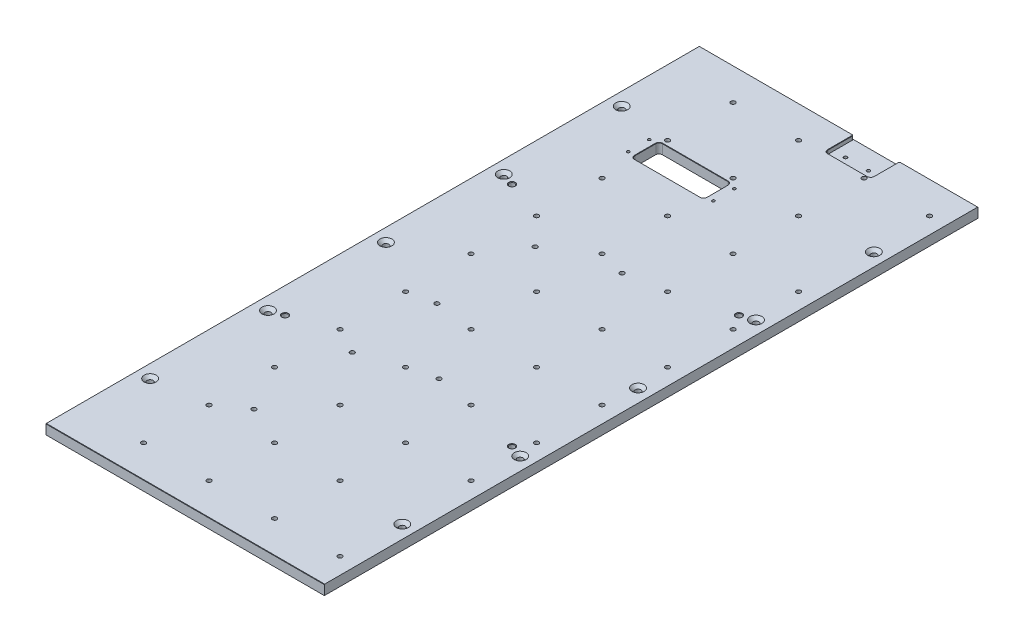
ISO-10303-21;
HEADER;
FILE_DESCRIPTION(('STEP AP214'),'2;1');
FILE_NAME('part.step','',(''),(''),'','','');
FILE_SCHEMA(('AUTOMOTIVE_DESIGN { 1 0 10303 214 1 1 1 1 }'));
ENDSEC;
DATA;
#1=APPLICATION_CONTEXT('core data for automotive mechanical design processes');
#2=APPLICATION_PROTOCOL_DEFINITION('international standard','automotive_design',2000,#1);
#3=PRODUCT_CONTEXT('',#1,'mechanical');
#4=PRODUCT('Part','Part','',(#3));
#5=PRODUCT_RELATED_PRODUCT_CATEGORY('part','',(#4));
#6=PRODUCT_DEFINITION_FORMATION('','',#4);
#7=PRODUCT_DEFINITION_CONTEXT('part definition',#1,'design');
#8=PRODUCT_DEFINITION('design','',#6,#7);
#9=PRODUCT_DEFINITION_SHAPE('','',#8);
#10=(LENGTH_UNIT() NAMED_UNIT(*) SI_UNIT(.MILLI.,.METRE.));
#11=(NAMED_UNIT(*) PLANE_ANGLE_UNIT() SI_UNIT($,.RADIAN.));
#12=(NAMED_UNIT(*) SI_UNIT($,.STERADIAN.) SOLID_ANGLE_UNIT());
#13=UNCERTAINTY_MEASURE_WITH_UNIT(LENGTH_MEASURE(1.E-05),#10,'distance_accuracy_value','');
#14=(GEOMETRIC_REPRESENTATION_CONTEXT(3) GLOBAL_UNCERTAINTY_ASSIGNED_CONTEXT((#13)) GLOBAL_UNIT_ASSIGNED_CONTEXT((#10,
#11,#12)) REPRESENTATION_CONTEXT('',''));
#15=CARTESIAN_POINT('',(0.,0.,0.));
#16=DIRECTION('',(0.,0.,1.));
#17=DIRECTION('',(1.,0.,0.));
#18=AXIS2_PLACEMENT_3D('',#15,#16,#17);
#19=CARTESIAN_POINT('',(0.,0.,0.));
#20=DIRECTION('',(1.,0.,0.));
#21=DIRECTION('',(0.,0.,-1.));
#22=AXIS2_PLACEMENT_3D('',#19,#20,#21);
#23=PLANE('',#22);
#24=DIRECTION('',(0.,0.707106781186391,-0.707106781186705));
#25=VECTOR('',#24,1.);
#26=CARTESIAN_POINT('',(0.,15.,498.5));
#27=LINE('',#26,#25);
#28=CARTESIAN_POINT('',(0.,14.5000000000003,499.));
#29=VERTEX_POINT('',#28);
#30=CARTESIAN_POINT('',(0.,15.,498.5));
#31=VERTEX_POINT('',#30);
#32=EDGE_CURVE('E49',#29,#31,#27,.T.);
#33=ORIENTED_EDGE('',*,*,#32,.T.);
#34=DIRECTION('',(0.,0.,-1.));
#35=VECTOR('',#34,1.);
#36=CARTESIAN_POINT('',(0.,15.,0.));
#37=LINE('',#36,#35);
#38=CARTESIAN_POINT('',(0.,15.,-498.5));
#39=VERTEX_POINT('',#38);
#40=EDGE_CURVE('E606',#31,#39,#37,.T.);
#41=ORIENTED_EDGE('',*,*,#40,.T.);
#42=DIRECTION('',(0.,-0.707106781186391,-0.707106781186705));
#43=VECTOR('',#42,1.);
#44=CARTESIAN_POINT('',(0.,15.,-498.5));
#45=LINE('',#44,#43);
#46=CARTESIAN_POINT('',(0.,14.5000000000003,-499.));
#47=VERTEX_POINT('',#46);
#48=EDGE_CURVE('E12',#39,#47,#45,.T.);
#49=ORIENTED_EDGE('',*,*,#48,.T.);
#50=DIRECTION('',(0.,1.,0.));
#51=VECTOR('',#50,1.);
#52=CARTESIAN_POINT('',(0.,15.,-499.));
#53=LINE('',#52,#51);
#54=CARTESIAN_POINT('',(0.,0.,-499.));
#55=VERTEX_POINT('',#54);
#56=EDGE_CURVE('E57',#55,#47,#53,.T.);
#57=ORIENTED_EDGE('',*,*,#56,.F.);
#58=DIRECTION('',(0.,0.,-1.));
#59=VECTOR('',#58,1.);
#60=CARTESIAN_POINT('',(0.,0.,0.));
#61=LINE('',#60,#59);
#62=CARTESIAN_POINT('',(0.,0.,499.));
#63=VERTEX_POINT('',#62);
#64=EDGE_CURVE('E614',#63,#55,#61,.T.);
#65=ORIENTED_EDGE('',*,*,#64,.F.);
#66=DIRECTION('',(0.,-1.,0.));
#67=VECTOR('',#66,1.);
#68=CARTESIAN_POINT('',(0.,15.,499.));
#69=LINE('',#68,#67);
#70=EDGE_CURVE('E611',#29,#63,#69,.T.);
#71=ORIENTED_EDGE('',*,*,#70,.F.);
#72=EDGE_LOOP('',(#33,#41,#49,#57,#65,#71));
#73=FACE_BOUND('',#72,.T.);
#74=ADVANCED_FACE('F41',(#73),#23,.F.);
#75=CARTESIAN_POINT('',(425.,0.,0.));
#76=DIRECTION('',(1.,0.,0.));
#77=DIRECTION('',(0.,0.,-1.));
#78=AXIS2_PLACEMENT_3D('',#75,#76,#77);
#79=PLANE('',#78);
#80=DIRECTION('',(0.,0.707106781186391,-0.707106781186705));
#81=VECTOR('',#80,1.);
#82=CARTESIAN_POINT('',(425.,15.,498.5));
#83=LINE('',#82,#81);
#84=CARTESIAN_POINT('',(425.,14.5000000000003,499.));
#85=VERTEX_POINT('',#84);
#86=CARTESIAN_POINT('',(425.,15.,498.5));
#87=VERTEX_POINT('',#86);
#88=EDGE_CURVE('E605',#85,#87,#83,.T.);
#89=ORIENTED_EDGE('',*,*,#88,.F.);
#90=DIRECTION('',(0.,-1.,0.));
#91=VECTOR('',#90,1.);
#92=CARTESIAN_POINT('',(425.,15.,499.));
#93=LINE('',#92,#91);
#94=CARTESIAN_POINT('',(425.,0.,499.));
#95=VERTEX_POINT('',#94);
#96=EDGE_CURVE('E44',#85,#95,#93,.T.);
#97=ORIENTED_EDGE('',*,*,#96,.T.);
#98=DIRECTION('',(0.,0.,-1.));
#99=VECTOR('',#98,1.);
#100=CARTESIAN_POINT('',(425.,0.,0.));
#101=LINE('',#100,#99);
#102=CARTESIAN_POINT('',(425.,0.,-499.));
#103=VERTEX_POINT('',#102);
#104=EDGE_CURVE('E608',#95,#103,#101,.T.);
#105=ORIENTED_EDGE('',*,*,#104,.T.);
#106=DIRECTION('',(0.,1.,0.));
#107=VECTOR('',#106,1.);
#108=CARTESIAN_POINT('',(425.,15.,-499.));
#109=LINE('',#108,#107);
#110=CARTESIAN_POINT('',(425.,14.5000000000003,-499.));
#111=VERTEX_POINT('',#110);
#112=EDGE_CURVE('E610',#103,#111,#109,.T.);
#113=ORIENTED_EDGE('',*,*,#112,.T.);
#114=DIRECTION('',(0.,-0.707106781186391,-0.707106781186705));
#115=VECTOR('',#114,1.);
#116=CARTESIAN_POINT('',(425.,15.,-498.5));
#117=LINE('',#116,#115);
#118=CARTESIAN_POINT('',(425.,15.,-498.5));
#119=VERTEX_POINT('',#118);
#120=EDGE_CURVE('E555',#119,#111,#117,.T.);
#121=ORIENTED_EDGE('',*,*,#120,.F.);
#122=DIRECTION('',(0.,0.,-1.));
#123=VECTOR('',#122,1.);
#124=CARTESIAN_POINT('',(425.,15.,0.));
#125=LINE('',#124,#123);
#126=EDGE_CURVE('E616',#87,#119,#125,.T.);
#127=ORIENTED_EDGE('',*,*,#126,.F.);
#128=EDGE_LOOP('',(#89,#97,#105,#113,#121,#127));
#129=FACE_BOUND('',#128,.T.);
#130=ADVANCED_FACE('F626',(#129),#79,.T.);
#131=CARTESIAN_POINT('',(234.9,9.,-499.));
#132=DIRECTION('',(-1.,0.,0.));
#133=DIRECTION('',(0.,0.,1.));
#134=AXIS2_PLACEMENT_3D('',#131,#132,#133);
#135=PLANE('',#134);
#136=DIRECTION('',(0.,1.,0.));
#137=VECTOR('',#136,1.);
#138=CARTESIAN_POINT('',(234.9,9.,-497.));
#139=LINE('',#138,#137);
#140=CARTESIAN_POINT('',(234.9,9.,-497.));
#141=VERTEX_POINT('',#140);
#142=CARTESIAN_POINT('',(234.9,14.5000000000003,-497.));
#143=VERTEX_POINT('',#142);
#144=EDGE_CURVE('E471',#141,#143,#139,.T.);
#145=ORIENTED_EDGE('',*,*,#144,.T.);
#146=DIRECTION('',(0.,0.,1.));
#147=VECTOR('',#146,1.);
#148=CARTESIAN_POINT('',(234.9,14.5000000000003,-460.));
#149=LINE('',#148,#147);
#150=CARTESIAN_POINT('',(234.9,14.5000000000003,-460.));
#151=VERTEX_POINT('',#150);
#152=EDGE_CURVE('E524',#143,#151,#149,.T.);
#153=ORIENTED_EDGE('',*,*,#152,.T.);
#154=DIRECTION('',(0.,1.,0.));
#155=VECTOR('',#154,1.);
#156=CARTESIAN_POINT('',(234.9,9.,-460.));
#157=LINE('',#156,#155);
#158=CARTESIAN_POINT('',(234.9,9.,-460.));
#159=VERTEX_POINT('',#158);
#160=EDGE_CURVE('E262',#159,#151,#157,.T.);
#161=ORIENTED_EDGE('',*,*,#160,.F.);
#162=DIRECTION('',(0.,0.,1.));
#163=VECTOR('',#162,1.);
#164=CARTESIAN_POINT('',(234.9,9.,-499.));
#165=LINE('',#164,#163);
#166=EDGE_CURVE('E287',#141,#159,#165,.T.);
#167=ORIENTED_EDGE('',*,*,#166,.F.);
#168=EDGE_LOOP('',(#145,#153,#161,#167));
#169=FACE_BOUND('',#168,.T.);
#170=ADVANCED_FACE('F669',(#169),#135,.F.);
#171=CARTESIAN_POINT('',(239.9,9.,-460.));
#172=DIRECTION('',(0.,1.,0.));
#173=DIRECTION('',(0.,0.,1.));
#174=AXIS2_PLACEMENT_3D('',#171,#172,#173);
#175=CYLINDRICAL_SURFACE('',#174,5.00000000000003);
#176=ORIENTED_EDGE('',*,*,#160,.T.);
#177=CARTESIAN_POINT('',(239.9,14.5000000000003,-460.));
#178=DIRECTION('',(0.,1.,0.));
#179=DIRECTION('',(0.,0.,1.));
#180=AXIS2_PLACEMENT_3D('',#177,#178,#179);
#181=CIRCLE('',#180,5.00000000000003);
#182=CARTESIAN_POINT('',(239.9,14.5000000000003,-455.));
#183=VERTEX_POINT('',#182);
#184=EDGE_CURVE('E526',#151,#183,#181,.T.);
#185=ORIENTED_EDGE('',*,*,#184,.T.);
#186=DIRECTION('',(0.,1.,0.));
#187=VECTOR('',#186,1.);
#188=CARTESIAN_POINT('',(239.9,9.,-455.));
#189=LINE('',#188,#187);
#190=CARTESIAN_POINT('',(239.9,9.,-455.));
#191=VERTEX_POINT('',#190);
#192=EDGE_CURVE('E295',#191,#183,#189,.T.);
#193=ORIENTED_EDGE('',*,*,#192,.F.);
#194=CARTESIAN_POINT('',(239.9,9.,-460.));
#195=DIRECTION('',(0.,1.,0.));
#196=DIRECTION('',(0.,0.,1.));
#197=AXIS2_PLACEMENT_3D('',#194,#195,#196);
#198=CIRCLE('',#197,5.00000000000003);
#199=EDGE_CURVE('E289',#159,#191,#198,.T.);
#200=ORIENTED_EDGE('',*,*,#199,.F.);
#201=EDGE_LOOP('',(#176,#185,#193,#200));
#202=FACE_BOUND('',#201,.T.);
#203=ADVANCED_FACE('F686',(#202),#175,.F.);
#204=CARTESIAN_POINT('',(300.1,9.,-455.));
#205=DIRECTION('',(0.,0.,1.));
#206=DIRECTION('',(1.,0.,0.));
#207=AXIS2_PLACEMENT_3D('',#204,#205,#206);
#208=PLANE('',#207);
#209=ORIENTED_EDGE('',*,*,#192,.T.);
#210=DIRECTION('',(1.,0.,0.));
#211=VECTOR('',#210,1.);
#212=CARTESIAN_POINT('',(300.1,14.5000000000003,-455.));
#213=LINE('',#212,#211);
#214=CARTESIAN_POINT('',(300.1,14.5000000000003,-455.));
#215=VERTEX_POINT('',#214);
#216=EDGE_CURVE('E528',#183,#215,#213,.T.);
#217=ORIENTED_EDGE('',*,*,#216,.T.);
#218=DIRECTION('',(0.,1.,0.));
#219=VECTOR('',#218,1.);
#220=CARTESIAN_POINT('',(300.1,9.,-455.));
#221=LINE('',#220,#219);
#222=CARTESIAN_POINT('',(300.1,9.,-455.));
#223=VERTEX_POINT('',#222);
#224=EDGE_CURVE('E292',#223,#215,#221,.T.);
#225=ORIENTED_EDGE('',*,*,#224,.F.);
#226=DIRECTION('',(1.,0.,0.));
#227=VECTOR('',#226,1.);
#228=CARTESIAN_POINT('',(300.1,9.,-455.));
#229=LINE('',#228,#227);
#230=EDGE_CURVE('E263',#191,#223,#229,.T.);
#231=ORIENTED_EDGE('',*,*,#230,.F.);
#232=EDGE_LOOP('',(#209,#217,#225,#231));
#233=FACE_BOUND('',#232,.T.);
#234=ADVANCED_FACE('F690',(#233),#208,.F.);
#235=CARTESIAN_POINT('',(300.1,9.,-460.));
#236=DIRECTION('',(0.,1.,0.));
#237=DIRECTION('',(0.,0.,1.));
#238=AXIS2_PLACEMENT_3D('',#235,#236,#237);
#239=CYLINDRICAL_SURFACE('',#238,5.00000000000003);
#240=ORIENTED_EDGE('',*,*,#224,.T.);
#241=CARTESIAN_POINT('',(300.1,14.5000000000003,-460.));
#242=DIRECTION('',(0.,1.,0.));
#243=DIRECTION('',(0.,0.,1.));
#244=AXIS2_PLACEMENT_3D('',#241,#242,#243);
#245=CIRCLE('',#244,5.00000000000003);
#246=CARTESIAN_POINT('',(305.1,14.5000000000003,-460.));
#247=VERTEX_POINT('',#246);
#248=EDGE_CURVE('E259',#215,#247,#245,.T.);
#249=ORIENTED_EDGE('',*,*,#248,.T.);
#250=DIRECTION('',(0.,1.,0.));
#251=VECTOR('',#250,1.);
#252=CARTESIAN_POINT('',(305.1,9.,-460.));
#253=LINE('',#252,#251);
#254=CARTESIAN_POINT('',(305.1,9.,-460.));
#255=VERTEX_POINT('',#254);
#256=EDGE_CURVE('E251',#255,#247,#253,.T.);
#257=ORIENTED_EDGE('',*,*,#256,.F.);
#258=CARTESIAN_POINT('',(300.1,9.,-460.));
#259=DIRECTION('',(0.,1.,0.));
#260=DIRECTION('',(0.,0.,1.));
#261=AXIS2_PLACEMENT_3D('',#258,#259,#260);
#262=CIRCLE('',#261,5.00000000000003);
#263=EDGE_CURVE('E256',#223,#255,#262,.T.);
#264=ORIENTED_EDGE('',*,*,#263,.F.);
#265=EDGE_LOOP('',(#240,#249,#257,#264));
#266=FACE_BOUND('',#265,.T.);
#267=ADVANCED_FACE('F254',(#266),#239,.F.);
#268=CARTESIAN_POINT('',(305.1,9.,-499.));
#269=DIRECTION('',(1.,0.,0.));
#270=DIRECTION('',(0.,0.,-1.));
#271=AXIS2_PLACEMENT_3D('',#268,#269,#270);
#272=PLANE('',#271);
#273=ORIENTED_EDGE('',*,*,#256,.T.);
#274=DIRECTION('',(0.,0.,-1.));
#275=VECTOR('',#274,1.);
#276=CARTESIAN_POINT('',(305.1,14.5000000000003,-497.));
#277=LINE('',#276,#275);
#278=CARTESIAN_POINT('',(305.1,14.5000000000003,-497.));
#279=VERTEX_POINT('',#278);
#280=EDGE_CURVE('E531',#247,#279,#277,.T.);
#281=ORIENTED_EDGE('',*,*,#280,.T.);
#282=DIRECTION('',(0.,1.,0.));
#283=VECTOR('',#282,1.);
#284=CARTESIAN_POINT('',(305.1,9.,-497.));
#285=LINE('',#284,#283);
#286=CARTESIAN_POINT('',(305.1,9.,-497.));
#287=VERTEX_POINT('',#286);
#288=EDGE_CURVE('E269',#279,#287,#285,.F.);
#289=ORIENTED_EDGE('',*,*,#288,.T.);
#290=DIRECTION('',(0.,0.,-1.));
#291=VECTOR('',#290,1.);
#292=CARTESIAN_POINT('',(305.1,9.,-499.));
#293=LINE('',#292,#291);
#294=EDGE_CURVE('E266',#255,#287,#293,.T.);
#295=ORIENTED_EDGE('',*,*,#294,.F.);
#296=EDGE_LOOP('',(#273,#281,#289,#295));
#297=FACE_BOUND('',#296,.T.);
#298=ADVANCED_FACE('F267',(#297),#272,.F.);
#299=CARTESIAN_POINT('',(85.,3.,-337.));
#300=DIRECTION('',(0.,1.,0.));
#301=DIRECTION('',(0.,0.,1.));
#302=AXIS2_PLACEMENT_3D('',#299,#300,#301);
#303=CONICAL_SURFACE('',#302,2.09999999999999,1.02974425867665);
#304=CARTESIAN_POINT('',(85.,1.73819270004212,-337.));
#305=VERTEX_POINT('',#304);
#306=VERTEX_LOOP('',#305);
#307=FACE_BOUND('',#306,.T.);
#308=CARTESIAN_POINT('',(85.,3.,-337.));
#309=DIRECTION('',(0.,1.,0.));
#310=DIRECTION('',(0.,0.,1.));
#311=AXIS2_PLACEMENT_3D('',#308,#309,#310);
#312=CIRCLE('',#311,2.09999999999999);
#313=CARTESIAN_POINT('',(85.,3.,-334.9));
#314=VERTEX_POINT('',#313);
#315=EDGE_CURVE('E302',#314,#314,#312,.T.);
#316=ORIENTED_EDGE('',*,*,#315,.T.);
#317=EDGE_LOOP('',(#316));
#318=FACE_BOUND('',#317,.T.);
#319=ADVANCED_FACE('F1300',(#307,#318),#303,.F.);
#320=CARTESIAN_POINT('',(85.,3.,-305.));
#321=DIRECTION('',(0.,1.,0.));
#322=DIRECTION('',(0.,0.,1.));
#323=AXIS2_PLACEMENT_3D('',#320,#321,#322);
#324=CONICAL_SURFACE('',#323,2.09999999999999,1.02974425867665);
#325=CARTESIAN_POINT('',(85.,1.73819270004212,-305.));
#326=VERTEX_POINT('',#325);
#327=VERTEX_LOOP('',#326);
#328=FACE_BOUND('',#327,.T.);
#329=CARTESIAN_POINT('',(85.,3.,-305.));
#330=DIRECTION('',(0.,1.,0.));
#331=DIRECTION('',(0.,0.,1.));
#332=AXIS2_PLACEMENT_3D('',#329,#330,#331);
#333=CIRCLE('',#332,2.09999999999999);
#334=CARTESIAN_POINT('',(85.,3.,-302.9));
#335=VERTEX_POINT('',#334);
#336=EDGE_CURVE('E308',#335,#335,#333,.T.);
#337=ORIENTED_EDGE('',*,*,#336,.T.);
#338=EDGE_LOOP('',(#337));
#339=FACE_BOUND('',#338,.T.);
#340=ADVANCED_FACE('F1309',(#328,#339),#324,.F.);
#341=CARTESIAN_POINT('',(215.,3.,-305.));
#342=DIRECTION('',(0.,1.,0.));
#343=DIRECTION('',(0.,0.,1.));
#344=AXIS2_PLACEMENT_3D('',#341,#342,#343);
#345=CONICAL_SURFACE('',#344,2.09999999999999,1.02974425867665);
#346=CARTESIAN_POINT('',(215.,1.73819270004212,-305.));
#347=VERTEX_POINT('',#346);
#348=VERTEX_LOOP('',#347);
#349=FACE_BOUND('',#348,.T.);
#350=CARTESIAN_POINT('',(215.,3.,-305.));
#351=DIRECTION('',(0.,1.,0.));
#352=DIRECTION('',(0.,0.,1.));
#353=AXIS2_PLACEMENT_3D('',#350,#351,#352);
#354=CIRCLE('',#353,2.09999999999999);
#355=CARTESIAN_POINT('',(215.,3.,-302.9));
#356=VERTEX_POINT('',#355);
#357=EDGE_CURVE('E314',#356,#356,#354,.T.);
#358=ORIENTED_EDGE('',*,*,#357,.T.);
#359=EDGE_LOOP('',(#358));
#360=FACE_BOUND('',#359,.T.);
#361=ADVANCED_FACE('F710',(#349,#360),#345,.F.);
#362=CARTESIAN_POINT('',(215.,3.,-337.));
#363=DIRECTION('',(0.,1.,0.));
#364=DIRECTION('',(0.,0.,1.));
#365=AXIS2_PLACEMENT_3D('',#362,#363,#364);
#366=CONICAL_SURFACE('',#365,2.09999999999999,1.02974425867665);
#367=CARTESIAN_POINT('',(215.,1.73819270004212,-337.));
#368=VERTEX_POINT('',#367);
#369=VERTEX_LOOP('',#368);
#370=FACE_BOUND('',#369,.T.);
#371=CARTESIAN_POINT('',(215.,3.,-337.));
#372=DIRECTION('',(0.,1.,0.));
#373=DIRECTION('',(0.,0.,1.));
#374=AXIS2_PLACEMENT_3D('',#371,#372,#373);
#375=CIRCLE('',#374,2.09999999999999);
#376=CARTESIAN_POINT('',(215.,3.,-334.9));
#377=VERTEX_POINT('',#376);
#378=EDGE_CURVE('E320',#377,#377,#375,.T.);
#379=ORIENTED_EDGE('',*,*,#378,.T.);
#380=EDGE_LOOP('',(#379));
#381=FACE_BOUND('',#380,.T.);
#382=ADVANCED_FACE('F702',(#370,#381),#366,.F.);
#383=CARTESIAN_POINT('',(307.1,15.,-497.));
#384=DIRECTION('',(0.,1.,0.));
#385=DIRECTION('',(0.,0.,1.));
#386=AXIS2_PLACEMENT_3D('',#383,#384,#385);
#387=CYLINDRICAL_SURFACE('',#386,2.);
#388=ORIENTED_EDGE('',*,*,#288,.F.);
#389=CARTESIAN_POINT('',(307.1,14.5000000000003,-497.));
#390=DIRECTION('',(0.,1.,0.));
#391=DIRECTION('',(0.,0.,1.));
#392=AXIS2_PLACEMENT_3D('',#389,#390,#391);
#393=CIRCLE('',#392,2.);
#394=CARTESIAN_POINT('',(307.1,14.5000000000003,-499.));
#395=VERTEX_POINT('',#394);
#396=EDGE_CURVE('E533',#279,#395,#393,.F.);
#397=ORIENTED_EDGE('',*,*,#396,.T.);
#398=DIRECTION('',(0.,1.,0.));
#399=VECTOR('',#398,1.);
#400=CARTESIAN_POINT('',(307.1,15.,-499.));
#401=LINE('',#400,#399);
#402=CARTESIAN_POINT('',(307.1,9.,-499.));
#403=VERTEX_POINT('',#402);
#404=EDGE_CURVE('E467',#403,#395,#401,.T.);
#405=ORIENTED_EDGE('',*,*,#404,.F.);
#406=CARTESIAN_POINT('',(307.1,9.,-497.));
#407=DIRECTION('',(0.,1.,0.));
#408=DIRECTION('',(0.,0.,1.));
#409=AXIS2_PLACEMENT_3D('',#406,#407,#408);
#410=CIRCLE('',#409,2.);
#411=EDGE_CURVE('E474',#287,#403,#410,.F.);
#412=ORIENTED_EDGE('',*,*,#411,.F.);
#413=EDGE_LOOP('',(#388,#397,#405,#412));
#414=FACE_BOUND('',#413,.T.);
#415=ADVANCED_FACE('F700',(#414),#387,.T.);
#416=CARTESIAN_POINT('',(300.1,9.,-460.));
#417=DIRECTION('',(0.,1.,0.));
#418=DIRECTION('',(0.,0.,1.));
#419=AXIS2_PLACEMENT_3D('',#416,#417,#418);
#420=PLANE('',#419);
#421=CARTESIAN_POINT('',(287.5,9.,-469.2));
#422=DIRECTION('',(0.,1.,0.));
#423=DIRECTION('',(0.,0.,1.));
#424=AXIS2_PLACEMENT_3D('',#421,#422,#423);
#425=CIRCLE('',#424,2.5);
#426=CARTESIAN_POINT('',(287.5,9.,-466.7));
#427=VERTEX_POINT('',#426);
#428=EDGE_CURVE('E1269',#427,#427,#425,.T.);
#429=ORIENTED_EDGE('',*,*,#428,.F.);
#430=EDGE_LOOP('',(#429));
#431=FACE_BOUND('',#430,.T.);
#432=CARTESIAN_POINT('',(252.5,9.,-469.2));
#433=DIRECTION('',(0.,1.,0.));
#434=DIRECTION('',(0.,0.,1.));
#435=AXIS2_PLACEMENT_3D('',#432,#433,#434);
#436=CIRCLE('',#435,2.5);
#437=CARTESIAN_POINT('',(252.5,9.,-466.7));
#438=VERTEX_POINT('',#437);
#439=EDGE_CURVE('E281',#438,#438,#436,.T.);
#440=ORIENTED_EDGE('',*,*,#439,.F.);
#441=EDGE_LOOP('',(#440));
#442=FACE_BOUND('',#441,.T.);
#443=ORIENTED_EDGE('',*,*,#263,.T.);
#444=ORIENTED_EDGE('',*,*,#294,.T.);
#445=ORIENTED_EDGE('',*,*,#411,.T.);
#446=DIRECTION('',(-1.,0.,0.));
#447=VECTOR('',#446,1.);
#448=CARTESIAN_POINT('',(305.1,9.,-499.));
#449=LINE('',#448,#447);
#450=CARTESIAN_POINT('',(232.9,9.,-499.));
#451=VERTEX_POINT('',#450);
#452=EDGE_CURVE('E273',#403,#451,#449,.T.);
#453=ORIENTED_EDGE('',*,*,#452,.T.);
#454=CARTESIAN_POINT('',(232.9,9.,-497.));
#455=DIRECTION('',(0.,1.,0.));
#456=DIRECTION('',(0.,0.,1.));
#457=AXIS2_PLACEMENT_3D('',#454,#455,#456);
#458=CIRCLE('',#457,2.);
#459=EDGE_CURVE('E476',#451,#141,#458,.F.);
#460=ORIENTED_EDGE('',*,*,#459,.T.);
#461=ORIENTED_EDGE('',*,*,#166,.T.);
#462=ORIENTED_EDGE('',*,*,#199,.T.);
#463=ORIENTED_EDGE('',*,*,#230,.T.);
#464=EDGE_LOOP('',(#443,#444,#445,#453,#460,#461,#462,#463));
#465=FACE_BOUND('',#464,.T.);
#466=ADVANCED_FACE('F275',(#431,#442,#465),#420,.T.);
#467=CARTESIAN_POINT('',(232.9,9.,-497.));
#468=DIRECTION('',(0.,1.,0.));
#469=DIRECTION('',(0.,0.,1.));
#470=AXIS2_PLACEMENT_3D('',#467,#468,#469);
#471=CYLINDRICAL_SURFACE('',#470,2.);
#472=DIRECTION('',(0.,1.,0.));
#473=VECTOR('',#472,1.);
#474=CARTESIAN_POINT('',(232.9,15.,-499.));
#475=LINE('',#474,#473);
#476=CARTESIAN_POINT('',(232.9,14.5000000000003,-499.));
#477=VERTEX_POINT('',#476);
#478=EDGE_CURVE('E465',#477,#451,#475,.F.);
#479=ORIENTED_EDGE('',*,*,#478,.F.);
#480=CARTESIAN_POINT('',(232.9,14.5000000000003,-497.));
#481=DIRECTION('',(0.,1.,0.));
#482=DIRECTION('',(0.,0.,1.));
#483=AXIS2_PLACEMENT_3D('',#480,#481,#482);
#484=CIRCLE('',#483,2.);
#485=EDGE_CURVE('E522',#477,#143,#484,.F.);
#486=ORIENTED_EDGE('',*,*,#485,.T.);
#487=ORIENTED_EDGE('',*,*,#144,.F.);
#488=ORIENTED_EDGE('',*,*,#459,.F.);
#489=EDGE_LOOP('',(#479,#486,#487,#488));
#490=FACE_BOUND('',#489,.T.);
#491=ADVANCED_FACE('F666',(#490),#471,.T.);
#492=CARTESIAN_POINT('',(234.9,14.5000000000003,-499.));
#493=DIRECTION('',(0.707106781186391,0.707106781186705,0.));
#494=DIRECTION('',(0.,0.,-1.));
#495=AXIS2_PLACEMENT_3D('',#492,#493,#494);
#496=PLANE('',#495);
#497=DIRECTION('',(0.707106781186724,-0.707106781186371,0.));
#498=VECTOR('',#497,1.);
#499=CARTESIAN_POINT('',(234.4,15.,-460.));
#500=LINE('',#499,#498);
#501=CARTESIAN_POINT('',(234.4,15.,-460.));
#502=VERTEX_POINT('',#501);
#503=EDGE_CURVE('E563',#502,#151,#500,.T.);
#504=ORIENTED_EDGE('',*,*,#503,.T.);
#505=ORIENTED_EDGE('',*,*,#152,.F.);
#506=DIRECTION('',(0.707106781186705,-0.707106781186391,0.));
#507=VECTOR('',#506,1.);
#508=CARTESIAN_POINT('',(234.4,15.,-497.));
#509=LINE('',#508,#507);
#510=CARTESIAN_POINT('',(234.4,15.,-497.));
#511=VERTEX_POINT('',#510);
#512=EDGE_CURVE('E559',#511,#143,#509,.T.);
#513=ORIENTED_EDGE('',*,*,#512,.F.);
#514=DIRECTION('',(0.,0.,-1.));
#515=VECTOR('',#514,1.);
#516=CARTESIAN_POINT('',(234.4,15.,-497.));
#517=LINE('',#516,#515);
#518=EDGE_CURVE('E510',#502,#511,#517,.T.);
#519=ORIENTED_EDGE('',*,*,#518,.F.);
#520=EDGE_LOOP('',(#504,#505,#513,#519));
#521=FACE_BOUND('',#520,.T.);
#522=ADVANCED_FACE('F673',(#521),#496,.T.);
#523=CARTESIAN_POINT('',(239.9,14.5000000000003,-460.));
#524=DIRECTION('',(0.,1.,0.));
#525=DIRECTION('',(0.,0.,1.));
#526=AXIS2_PLACEMENT_3D('',#523,#524,#525);
#527=CONICAL_SURFACE('',#526,5.00000000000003,0.785398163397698);
#528=DIRECTION('',(0.,-0.707106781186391,-0.707106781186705));
#529=VECTOR('',#528,1.);
#530=CARTESIAN_POINT('',(239.9,15.,-454.5));
#531=LINE('',#530,#529);
#532=CARTESIAN_POINT('',(239.9,15.,-454.5));
#533=VERTEX_POINT('',#532);
#534=EDGE_CURVE('E566',#533,#183,#531,.T.);
#535=ORIENTED_EDGE('',*,*,#534,.T.);
#536=ORIENTED_EDGE('',*,*,#184,.F.);
#537=ORIENTED_EDGE('',*,*,#503,.F.);
#538=CARTESIAN_POINT('',(239.9,15.,-460.));
#539=DIRECTION('',(0.,1.,0.));
#540=DIRECTION('',(0.,0.,1.));
#541=AXIS2_PLACEMENT_3D('',#538,#539,#540);
#542=CIRCLE('',#541,5.50000000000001);
#543=EDGE_CURVE('E508',#533,#502,#542,.F.);
#544=ORIENTED_EDGE('',*,*,#543,.F.);
#545=EDGE_LOOP('',(#535,#536,#537,#544));
#546=FACE_BOUND('',#545,.T.);
#547=ADVANCED_FACE('F684',(#546),#527,.F.);
#548=CARTESIAN_POINT('',(300.1,14.5000000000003,-455.));
#549=DIRECTION('',(0.,0.707106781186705,-0.707106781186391));
#550=DIRECTION('',(-1.,0.,0.));
#551=AXIS2_PLACEMENT_3D('',#548,#549,#550);
#552=PLANE('',#551);
#553=DIRECTION('',(0.,-0.70710678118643,-0.707106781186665));
#554=VECTOR('',#553,1.);
#555=CARTESIAN_POINT('',(300.1,15.,-454.5));
#556=LINE('',#555,#554);
#557=CARTESIAN_POINT('',(300.1,15.,-454.5));
#558=VERTEX_POINT('',#557);
#559=EDGE_CURVE('E569',#558,#215,#556,.T.);
#560=ORIENTED_EDGE('',*,*,#559,.T.);
#561=ORIENTED_EDGE('',*,*,#216,.F.);
#562=ORIENTED_EDGE('',*,*,#534,.F.);
#563=DIRECTION('',(-1.,0.,0.));
#564=VECTOR('',#563,1.);
#565=CARTESIAN_POINT('',(239.9,15.,-454.5));
#566=LINE('',#565,#564);
#567=EDGE_CURVE('E506',#558,#533,#566,.T.);
#568=ORIENTED_EDGE('',*,*,#567,.F.);
#569=EDGE_LOOP('',(#560,#561,#562,#568));
#570=FACE_BOUND('',#569,.T.);
#571=ADVANCED_FACE('F692',(#570),#552,.T.);
#572=CARTESIAN_POINT('',(300.1,14.5000000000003,-460.));
#573=DIRECTION('',(0.,1.,0.));
#574=DIRECTION('',(0.,0.,1.));
#575=AXIS2_PLACEMENT_3D('',#572,#573,#574);
#576=CONICAL_SURFACE('',#575,5.00000000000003,0.785398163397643);
#577=DIRECTION('',(-0.707106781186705,-0.707106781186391,0.));
#578=VECTOR('',#577,1.);
#579=CARTESIAN_POINT('',(305.6,15.,-460.));
#580=LINE('',#579,#578);
#581=CARTESIAN_POINT('',(305.6,15.,-460.));
#582=VERTEX_POINT('',#581);
#583=EDGE_CURVE('E572',#582,#247,#580,.T.);
#584=ORIENTED_EDGE('',*,*,#583,.T.);
#585=ORIENTED_EDGE('',*,*,#248,.F.);
#586=ORIENTED_EDGE('',*,*,#559,.F.);
#587=CARTESIAN_POINT('',(300.1,15.,-460.));
#588=DIRECTION('',(0.,1.,0.));
#589=DIRECTION('',(0.,0.,1.));
#590=AXIS2_PLACEMENT_3D('',#587,#588,#589);
#591=CIRCLE('',#590,5.49999999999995);
#592=EDGE_CURVE('E504',#582,#558,#591,.F.);
#593=ORIENTED_EDGE('',*,*,#592,.F.);
#594=EDGE_LOOP('',(#584,#585,#586,#593));
#595=FACE_BOUND('',#594,.T.);
#596=ADVANCED_FACE('F696',(#595),#576,.F.);
#597=CARTESIAN_POINT('',(305.1,14.5000000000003,-499.));
#598=DIRECTION('',(-0.707106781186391,0.707106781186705,0.));
#599=DIRECTION('',(0.,0.,1.));
#600=AXIS2_PLACEMENT_3D('',#597,#598,#599);
#601=PLANE('',#600);
#602=DIRECTION('',(-0.707106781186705,-0.707106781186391,0.));
#603=VECTOR('',#602,1.);
#604=CARTESIAN_POINT('',(305.6,15.,-497.));
#605=LINE('',#604,#603);
#606=CARTESIAN_POINT('',(305.6,15.,-497.));
#607=VERTEX_POINT('',#606);
#608=EDGE_CURVE('E575',#607,#279,#605,.T.);
#609=ORIENTED_EDGE('',*,*,#608,.T.);
#610=ORIENTED_EDGE('',*,*,#280,.F.);
#611=ORIENTED_EDGE('',*,*,#583,.F.);
#612=DIRECTION('',(0.,0.,1.));
#613=VECTOR('',#612,1.);
#614=CARTESIAN_POINT('',(305.6,15.,-460.));
#615=LINE('',#614,#613);
#616=EDGE_CURVE('E502',#607,#582,#615,.T.);
#617=ORIENTED_EDGE('',*,*,#616,.F.);
#618=EDGE_LOOP('',(#609,#610,#611,#617));
#619=FACE_BOUND('',#618,.T.);
#620=ADVANCED_FACE('F698',(#619),#601,.T.);
#621=CARTESIAN_POINT('',(205.,14.5000000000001,-305.));
#622=DIRECTION('',(-0.707106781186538,0.707106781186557,0.));
#623=DIRECTION('',(0.,0.,1.));
#624=AXIS2_PLACEMENT_3D('',#621,#622,#623);
#625=PLANE('',#624);
#626=DIRECTION('',(-0.707106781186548,-0.707106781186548,0.));
#627=VECTOR('',#626,1.);
#628=CARTESIAN_POINT('',(205.5,15.,-337.));
#629=LINE('',#628,#627);
#630=CARTESIAN_POINT('',(205.5,15.,-337.));
#631=VERTEX_POINT('',#630);
#632=CARTESIAN_POINT('',(205.,14.5000000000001,-337.));
#633=VERTEX_POINT('',#632);
#634=EDGE_CURVE('E593',#631,#633,#629,.T.);
#635=ORIENTED_EDGE('',*,*,#634,.T.);
#636=DIRECTION('',(0.,0.,-1.));
#637=VECTOR('',#636,1.);
#638=CARTESIAN_POINT('',(205.,14.5000000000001,-337.));
#639=LINE('',#638,#637);
#640=CARTESIAN_POINT('',(205.,14.5000000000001,-305.));
#641=VERTEX_POINT('',#640);
#642=EDGE_CURVE('E545',#641,#633,#639,.T.);
#643=ORIENTED_EDGE('',*,*,#642,.F.);
#644=DIRECTION('',(-0.707106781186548,-0.707106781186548,0.));
#645=VECTOR('',#644,1.);
#646=CARTESIAN_POINT('',(205.5,15.,-305.));
#647=LINE('',#646,#645);
#648=CARTESIAN_POINT('',(205.5,15.,-305.));
#649=VERTEX_POINT('',#648);
#650=EDGE_CURVE('E587',#649,#641,#647,.T.);
#651=ORIENTED_EDGE('',*,*,#650,.F.);
#652=DIRECTION('',(0.,0.,1.));
#653=VECTOR('',#652,1.);
#654=CARTESIAN_POINT('',(205.5,15.,-305.));
#655=LINE('',#654,#653);
#656=EDGE_CURVE('E486',#631,#649,#655,.T.);
#657=ORIENTED_EDGE('',*,*,#656,.F.);
#658=EDGE_LOOP('',(#635,#643,#651,#657));
#659=FACE_BOUND('',#658,.T.);
#660=ADVANCED_FACE('F780',(#659),#625,.T.);
#661=CARTESIAN_POINT('',(200.,14.5000000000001,-337.));
#662=DIRECTION('',(0.,1.,0.));
#663=DIRECTION('',(0.,0.,1.));
#664=AXIS2_PLACEMENT_3D('',#661,#662,#663);
#665=CONICAL_SURFACE('',#664,5.00000000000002,0.785398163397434);
#666=DIRECTION('',(0.,-0.707106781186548,0.707106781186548));
#667=VECTOR('',#666,1.);
#668=CARTESIAN_POINT('',(200.,15.,-342.5));
#669=LINE('',#668,#667);
#670=CARTESIAN_POINT('',(200.,15.,-342.5));
#671=VERTEX_POINT('',#670);
#672=CARTESIAN_POINT('',(200.,14.5000000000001,-342.));
#673=VERTEX_POINT('',#672);
#674=EDGE_CURVE('E599',#671,#673,#669,.T.);
#675=ORIENTED_EDGE('',*,*,#674,.T.);
#676=CARTESIAN_POINT('',(200.,14.5000000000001,-337.));
#677=DIRECTION('',(0.,1.,0.));
#678=DIRECTION('',(0.,0.,1.));
#679=AXIS2_PLACEMENT_3D('',#676,#677,#678);
#680=CIRCLE('',#679,5.00000000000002);
#681=EDGE_CURVE('E549',#633,#673,#680,.T.);
#682=ORIENTED_EDGE('',*,*,#681,.F.);
#683=ORIENTED_EDGE('',*,*,#634,.F.);
#684=CARTESIAN_POINT('',(200.,15.,-337.));
#685=DIRECTION('',(0.,1.,0.));
#686=DIRECTION('',(0.,0.,1.));
#687=AXIS2_PLACEMENT_3D('',#684,#685,#686);
#688=CIRCLE('',#687,5.49999999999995);
#689=EDGE_CURVE('E482',#671,#631,#688,.F.);
#690=ORIENTED_EDGE('',*,*,#689,.F.);
#691=EDGE_LOOP('',(#675,#682,#683,#690));
#692=FACE_BOUND('',#691,.T.);
#693=ADVANCED_FACE('F783',(#692),#665,.F.);
#694=CARTESIAN_POINT('',(100.,14.5000000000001,-342.));
#695=DIRECTION('',(0.,0.707106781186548,0.707106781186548));
#696=DIRECTION('',(1.,0.,0.));
#697=AXIS2_PLACEMENT_3D('',#694,#695,#696);
#698=PLANE('',#697);
#699=ORIENTED_EDGE('',*,*,#674,.F.);
#700=DIRECTION('',(1.,0.,0.));
#701=VECTOR('',#700,1.);
#702=CARTESIAN_POINT('',(200.,15.,-342.5));
#703=LINE('',#702,#701);
#704=CARTESIAN_POINT('',(100.,15.,-342.5));
#705=VERTEX_POINT('',#704);
#706=EDGE_CURVE('E478',#705,#671,#703,.T.);
#707=ORIENTED_EDGE('',*,*,#706,.F.);
#708=DIRECTION('',(0.,0.707106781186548,-0.707106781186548));
#709=VECTOR('',#708,1.);
#710=CARTESIAN_POINT('',(100.,14.5000000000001,-342.));
#711=LINE('',#710,#709);
#712=CARTESIAN_POINT('',(100.,14.5000000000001,-342.));
#713=VERTEX_POINT('',#712);
#714=EDGE_CURVE('E560',#713,#705,#711,.T.);
#715=ORIENTED_EDGE('',*,*,#714,.F.);
#716=DIRECTION('',(-1.,0.,0.));
#717=VECTOR('',#716,1.);
#718=CARTESIAN_POINT('',(100.,14.5000000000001,-342.));
#719=LINE('',#718,#717);
#720=EDGE_CURVE('E553',#673,#713,#719,.T.);
#721=ORIENTED_EDGE('',*,*,#720,.F.);
#722=EDGE_LOOP('',(#699,#707,#715,#721));
#723=FACE_BOUND('',#722,.T.);
#724=ADVANCED_FACE('F791',(#723),#698,.T.);
#725=CARTESIAN_POINT('',(100.,14.5000000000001,-337.));
#726=DIRECTION('',(0.,1.,0.));
#727=DIRECTION('',(0.,0.,1.));
#728=AXIS2_PLACEMENT_3D('',#725,#726,#727);
#729=CONICAL_SURFACE('',#728,5.00000000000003,0.785398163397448);
#730=ORIENTED_EDGE('',*,*,#714,.T.);
#731=CARTESIAN_POINT('',(100.,15.,-337.));
#732=DIRECTION('',(0.,1.,0.));
#733=DIRECTION('',(0.,0.,1.));
#734=AXIS2_PLACEMENT_3D('',#731,#732,#733);
#735=CIRCLE('',#734,5.50000000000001);
#736=CARTESIAN_POINT('',(94.5,15.,-337.));
#737=VERTEX_POINT('',#736);
#738=EDGE_CURVE('E480',#737,#705,#735,.F.);
#739=ORIENTED_EDGE('',*,*,#738,.F.);
#740=DIRECTION('',(-0.707106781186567,0.707106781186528,0.));
#741=VECTOR('',#740,1.);
#742=CARTESIAN_POINT('',(94.9999999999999,14.5000000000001,-337.));
#743=LINE('',#742,#741);
#744=CARTESIAN_POINT('',(95.,14.5000000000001,-337.));
#745=VERTEX_POINT('',#744);
#746=EDGE_CURVE('E596',#745,#737,#743,.T.);
#747=ORIENTED_EDGE('',*,*,#746,.F.);
#748=CARTESIAN_POINT('',(100.,14.5000000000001,-337.));
#749=DIRECTION('',(0.,1.,0.));
#750=DIRECTION('',(0.,0.,1.));
#751=AXIS2_PLACEMENT_3D('',#748,#749,#750);
#752=CIRCLE('',#751,5.00000000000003);
#753=EDGE_CURVE('E551',#713,#745,#752,.T.);
#754=ORIENTED_EDGE('',*,*,#753,.F.);
#755=EDGE_LOOP('',(#730,#739,#747,#754));
#756=FACE_BOUND('',#755,.T.);
#757=ADVANCED_FACE('F787',(#756),#729,.F.);
#758=CARTESIAN_POINT('',(95.,14.5000000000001,-305.));
#759=DIRECTION('',(0.707106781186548,0.707106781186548,0.));
#760=DIRECTION('',(0.,0.,-1.));
#761=AXIS2_PLACEMENT_3D('',#758,#759,#760);
#762=PLANE('',#761);
#763=ORIENTED_EDGE('',*,*,#746,.T.);
#764=DIRECTION('',(0.,0.,-1.));
#765=VECTOR('',#764,1.);
#766=CARTESIAN_POINT('',(94.5,15.,-337.));
#767=LINE('',#766,#765);
#768=CARTESIAN_POINT('',(94.5,15.,-305.));
#769=VERTEX_POINT('',#768);
#770=EDGE_CURVE('E484',#769,#737,#767,.T.);
#771=ORIENTED_EDGE('',*,*,#770,.F.);
#772=DIRECTION('',(-0.707106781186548,0.707106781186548,0.));
#773=VECTOR('',#772,1.);
#774=CARTESIAN_POINT('',(95.,14.5000000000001,-305.));
#775=LINE('',#774,#773);
#776=CARTESIAN_POINT('',(95.,14.5000000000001,-305.));
#777=VERTEX_POINT('',#776);
#778=EDGE_CURVE('E590',#777,#769,#775,.T.);
#779=ORIENTED_EDGE('',*,*,#778,.F.);
#780=DIRECTION('',(0.,0.,1.));
#781=VECTOR('',#780,1.);
#782=CARTESIAN_POINT('',(95.,14.5000000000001,-305.));
#783=LINE('',#782,#781);
#784=EDGE_CURVE('E547',#745,#777,#783,.T.);
#785=ORIENTED_EDGE('',*,*,#784,.F.);
#786=EDGE_LOOP('',(#763,#771,#779,#785));
#787=FACE_BOUND('',#786,.T.);
#788=ADVANCED_FACE('F778',(#787),#762,.T.);
#789=CARTESIAN_POINT('',(100.,14.5000000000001,-305.));
#790=DIRECTION('',(0.,1.,0.));
#791=DIRECTION('',(0.,0.,1.));
#792=AXIS2_PLACEMENT_3D('',#789,#790,#791);
#793=CONICAL_SURFACE('',#792,5.,0.785398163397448);
#794=ORIENTED_EDGE('',*,*,#778,.T.);
#795=CARTESIAN_POINT('',(100.,15.,-305.));
#796=DIRECTION('',(0.,1.,0.));
#797=DIRECTION('',(0.,0.,1.));
#798=AXIS2_PLACEMENT_3D('',#795,#796,#797);
#799=CIRCLE('',#798,5.49999999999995);
#800=CARTESIAN_POINT('',(100.,15.,-299.5));
#801=VERTEX_POINT('',#800);
#802=EDGE_CURVE('E488',#801,#769,#799,.F.);
#803=ORIENTED_EDGE('',*,*,#802,.F.);
#804=DIRECTION('',(0.,0.707106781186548,0.707106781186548));
#805=VECTOR('',#804,1.);
#806=CARTESIAN_POINT('',(100.,14.5000000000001,-300.));
#807=LINE('',#806,#805);
#808=CARTESIAN_POINT('',(100.,14.5000000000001,-300.));
#809=VERTEX_POINT('',#808);
#810=EDGE_CURVE('E584',#809,#801,#807,.T.);
#811=ORIENTED_EDGE('',*,*,#810,.F.);
#812=CARTESIAN_POINT('',(100.,14.5000000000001,-305.));
#813=DIRECTION('',(0.,1.,0.));
#814=DIRECTION('',(0.,0.,1.));
#815=AXIS2_PLACEMENT_3D('',#812,#813,#814);
#816=CIRCLE('',#815,5.);
#817=EDGE_CURVE('E543',#777,#809,#816,.T.);
#818=ORIENTED_EDGE('',*,*,#817,.F.);
#819=EDGE_LOOP('',(#794,#803,#811,#818));
#820=FACE_BOUND('',#819,.T.);
#821=ADVANCED_FACE('F770',(#820),#793,.F.);
#822=CARTESIAN_POINT('',(100.,14.5000000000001,-300.));
#823=DIRECTION('',(0.,0.707106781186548,-0.707106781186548));
#824=DIRECTION('',(-1.,0.,0.));
#825=AXIS2_PLACEMENT_3D('',#822,#823,#824);
#826=PLANE('',#825);
#827=ORIENTED_EDGE('',*,*,#810,.T.);
#828=DIRECTION('',(-1.,0.,0.));
#829=VECTOR('',#828,1.);
#830=CARTESIAN_POINT('',(100.,15.,-299.5));
#831=LINE('',#830,#829);
#832=CARTESIAN_POINT('',(200.,15.,-299.5));
#833=VERTEX_POINT('',#832);
#834=EDGE_CURVE('E492',#833,#801,#831,.T.);
#835=ORIENTED_EDGE('',*,*,#834,.F.);
#836=DIRECTION('',(0.,-0.707106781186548,-0.707106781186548));
#837=VECTOR('',#836,1.);
#838=CARTESIAN_POINT('',(200.,15.,-299.5));
#839=LINE('',#838,#837);
#840=CARTESIAN_POINT('',(200.,14.5000000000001,-300.));
#841=VERTEX_POINT('',#840);
#842=EDGE_CURVE('E582',#833,#841,#839,.T.);
#843=ORIENTED_EDGE('',*,*,#842,.T.);
#844=DIRECTION('',(1.,0.,0.));
#845=VECTOR('',#844,1.);
#846=CARTESIAN_POINT('',(200.,14.5000000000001,-300.));
#847=LINE('',#846,#845);
#848=EDGE_CURVE('E538',#809,#841,#847,.T.);
#849=ORIENTED_EDGE('',*,*,#848,.F.);
#850=EDGE_LOOP('',(#827,#835,#843,#849));
#851=FACE_BOUND('',#850,.T.);
#852=ADVANCED_FACE('F766',(#851),#826,.T.);
#853=CARTESIAN_POINT('',(200.,14.5000000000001,-305.));
#854=DIRECTION('',(0.,1.,0.));
#855=DIRECTION('',(0.,0.,1.));
#856=AXIS2_PLACEMENT_3D('',#853,#854,#855);
#857=CONICAL_SURFACE('',#856,5.,0.785398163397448);
#858=ORIENTED_EDGE('',*,*,#650,.T.);
#859=CARTESIAN_POINT('',(200.,14.5000000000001,-305.));
#860=DIRECTION('',(0.,1.,0.));
#861=DIRECTION('',(0.,0.,1.));
#862=AXIS2_PLACEMENT_3D('',#859,#860,#861);
#863=CIRCLE('',#862,5.);
#864=EDGE_CURVE('E541',#841,#641,#863,.T.);
#865=ORIENTED_EDGE('',*,*,#864,.F.);
#866=ORIENTED_EDGE('',*,*,#842,.F.);
#867=CARTESIAN_POINT('',(200.,15.,-305.));
#868=DIRECTION('',(0.,1.,0.));
#869=DIRECTION('',(0.,0.,1.));
#870=AXIS2_PLACEMENT_3D('',#867,#868,#869);
#871=CIRCLE('',#870,5.49999999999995);
#872=EDGE_CURVE('E490',#649,#833,#871,.F.);
#873=ORIENTED_EDGE('',*,*,#872,.F.);
#874=EDGE_LOOP('',(#858,#865,#866,#873));
#875=FACE_BOUND('',#874,.T.);
#876=ADVANCED_FACE('F769',(#875),#857,.F.);
#877=CARTESIAN_POINT('',(85.,15.,-337.));
#878=DIRECTION('',(0.,1.,0.));
#879=DIRECTION('',(0.,0.,1.));
#880=AXIS2_PLACEMENT_3D('',#877,#878,#879);
#881=CYLINDRICAL_SURFACE('',#880,2.09999999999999);
#882=ORIENTED_EDGE('',*,*,#315,.F.);
#883=EDGE_LOOP('',(#882));
#884=FACE_BOUND('',#883,.T.);
#885=CARTESIAN_POINT('',(85.,15.,-337.));
#886=DIRECTION('',(0.,1.,0.));
#887=DIRECTION('',(0.,0.,1.));
#888=AXIS2_PLACEMENT_3D('',#885,#886,#887);
#889=CIRCLE('',#888,2.09999999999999);
#890=CARTESIAN_POINT('',(85.,15.,-334.9));
#891=VERTEX_POINT('',#890);
#892=EDGE_CURVE('E294',#891,#891,#889,.T.);
#893=ORIENTED_EDGE('',*,*,#892,.T.);
#894=EDGE_LOOP('',(#893));
#895=FACE_BOUND('',#894,.T.);
#896=ADVANCED_FACE('F774',(#884,#895),#881,.F.);
#897=CARTESIAN_POINT('',(85.,15.,-305.));
#898=DIRECTION('',(0.,1.,0.));
#899=DIRECTION('',(0.,0.,1.));
#900=AXIS2_PLACEMENT_3D('',#897,#898,#899);
#901=CYLINDRICAL_SURFACE('',#900,2.09999999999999);
#902=ORIENTED_EDGE('',*,*,#336,.F.);
#903=EDGE_LOOP('',(#902));
#904=FACE_BOUND('',#903,.T.);
#905=CARTESIAN_POINT('',(85.,15.,-305.));
#906=DIRECTION('',(0.,1.,0.));
#907=DIRECTION('',(0.,0.,1.));
#908=AXIS2_PLACEMENT_3D('',#905,#906,#907);
#909=CIRCLE('',#908,2.09999999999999);
#910=CARTESIAN_POINT('',(85.,15.,-302.9));
#911=VERTEX_POINT('',#910);
#912=EDGE_CURVE('E305',#911,#911,#909,.T.);
#913=ORIENTED_EDGE('',*,*,#912,.T.);
#914=EDGE_LOOP('',(#913));
#915=FACE_BOUND('',#914,.T.);
#916=ADVANCED_FACE('F1305',(#904,#915),#901,.F.);
#917=CARTESIAN_POINT('',(215.,15.,-305.));
#918=DIRECTION('',(0.,1.,0.));
#919=DIRECTION('',(0.,0.,1.));
#920=AXIS2_PLACEMENT_3D('',#917,#918,#919);
#921=CYLINDRICAL_SURFACE('',#920,2.09999999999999);
#922=ORIENTED_EDGE('',*,*,#357,.F.);
#923=EDGE_LOOP('',(#922));
#924=FACE_BOUND('',#923,.T.);
#925=CARTESIAN_POINT('',(215.,15.,-305.));
#926=DIRECTION('',(0.,1.,0.));
#927=DIRECTION('',(0.,0.,1.));
#928=AXIS2_PLACEMENT_3D('',#925,#926,#927);
#929=CIRCLE('',#928,2.09999999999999);
#930=CARTESIAN_POINT('',(215.,15.,-302.9));
#931=VERTEX_POINT('',#930);
#932=EDGE_CURVE('E311',#931,#931,#929,.T.);
#933=ORIENTED_EDGE('',*,*,#932,.T.);
#934=EDGE_LOOP('',(#933));
#935=FACE_BOUND('',#934,.T.);
#936=ADVANCED_FACE('F1313',(#924,#935),#921,.F.);
#937=CARTESIAN_POINT('',(215.,15.,-337.));
#938=DIRECTION('',(0.,1.,0.));
#939=DIRECTION('',(0.,0.,1.));
#940=AXIS2_PLACEMENT_3D('',#937,#938,#939);
#941=CYLINDRICAL_SURFACE('',#940,2.09999999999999);
#942=ORIENTED_EDGE('',*,*,#378,.F.);
#943=EDGE_LOOP('',(#942));
#944=FACE_BOUND('',#943,.T.);
#945=CARTESIAN_POINT('',(215.,15.,-337.));
#946=DIRECTION('',(0.,1.,0.));
#947=DIRECTION('',(0.,0.,1.));
#948=AXIS2_PLACEMENT_3D('',#945,#946,#947);
#949=CIRCLE('',#948,2.09999999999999);
#950=CARTESIAN_POINT('',(215.,15.,-334.9));
#951=VERTEX_POINT('',#950);
#952=EDGE_CURVE('E317',#951,#951,#949,.T.);
#953=ORIENTED_EDGE('',*,*,#952,.T.);
#954=EDGE_LOOP('',(#953));
#955=FACE_BOUND('',#954,.T.);
#956=ADVANCED_FACE('F868',(#944,#955),#941,.F.);
#957=CARTESIAN_POINT('',(20.,15.,-360.));
#958=DIRECTION('',(0.,1.,0.));
#959=DIRECTION('',(0.,0.,1.));
#960=AXIS2_PLACEMENT_3D('',#957,#958,#959);
#961=CONICAL_SURFACE('',#960,9.125,0.785398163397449);
#962=CARTESIAN_POINT('',(20.,10.375,-360.));
#963=DIRECTION('',(0.,1.,0.));
#964=DIRECTION('',(0.,0.,1.));
#965=AXIS2_PLACEMENT_3D('',#962,#963,#964);
#966=CIRCLE('',#965,4.5);
#967=CARTESIAN_POINT('',(20.,10.375,-355.5));
#968=VERTEX_POINT('',#967);
#969=EDGE_CURVE('E374',#968,#968,#966,.T.);
#970=ORIENTED_EDGE('',*,*,#969,.F.);
#971=EDGE_LOOP('',(#970));
#972=FACE_BOUND('',#971,.T.);
#973=CARTESIAN_POINT('',(20.,15.,-360.));
#974=DIRECTION('',(0.,1.,0.));
#975=DIRECTION('',(0.,0.,1.));
#976=AXIS2_PLACEMENT_3D('',#973,#974,#975);
#977=CIRCLE('',#976,9.125);
#978=CARTESIAN_POINT('',(20.,15.,-350.875));
#979=VERTEX_POINT('',#978);
#980=EDGE_CURVE('E351',#979,#979,#977,.T.);
#981=ORIENTED_EDGE('',*,*,#980,.T.);
#982=EDGE_LOOP('',(#981));
#983=FACE_BOUND('',#982,.T.);
#984=ADVANCED_FACE('F864',(#972,#983),#961,.F.);
#985=CARTESIAN_POINT('',(20.,15.,360.));
#986=DIRECTION('',(0.,1.,0.));
#987=DIRECTION('',(0.,0.,1.));
#988=AXIS2_PLACEMENT_3D('',#985,#986,#987);
#989=CONICAL_SURFACE('',#988,9.125,0.785398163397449);
#990=CARTESIAN_POINT('',(20.,10.375,360.));
#991=DIRECTION('',(0.,1.,0.));
#992=DIRECTION('',(0.,0.,1.));
#993=AXIS2_PLACEMENT_3D('',#990,#991,#992);
#994=CIRCLE('',#993,4.5);
#995=CARTESIAN_POINT('',(20.,10.375,364.5));
#996=VERTEX_POINT('',#995);
#997=EDGE_CURVE('E383',#996,#996,#994,.T.);
#998=ORIENTED_EDGE('',*,*,#997,.F.);
#999=EDGE_LOOP('',(#998));
#1000=FACE_BOUND('',#999,.T.);
#1001=CARTESIAN_POINT('',(20.,15.,360.));
#1002=DIRECTION('',(0.,1.,0.));
#1003=DIRECTION('',(0.,0.,1.));
#1004=AXIS2_PLACEMENT_3D('',#1001,#1002,#1003);
#1005=CIRCLE('',#1004,9.125);
#1006=CARTESIAN_POINT('',(20.,15.,369.125));
#1007=VERTEX_POINT('',#1006);
#1008=EDGE_CURVE('E380',#1007,#1007,#1005,.T.);
#1009=ORIENTED_EDGE('',*,*,#1008,.T.);
#1010=EDGE_LOOP('',(#1009));
#1011=FACE_BOUND('',#1010,.T.);
#1012=ADVANCED_FACE('F867',(#1000,#1011),#989,.F.);
#1013=CARTESIAN_POINT('',(20.,15.,0.));
#1014=DIRECTION('',(0.,1.,0.));
#1015=DIRECTION('',(0.,0.,1.));
#1016=AXIS2_PLACEMENT_3D('',#1013,#1014,#1015);
#1017=CONICAL_SURFACE('',#1016,9.125,0.785398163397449);
#1018=CARTESIAN_POINT('',(20.,10.375,0.));
#1019=DIRECTION('',(0.,1.,0.));
#1020=DIRECTION('',(0.,0.,1.));
#1021=AXIS2_PLACEMENT_3D('',#1018,#1019,#1020);
#1022=CIRCLE('',#1021,4.5);
#1023=CARTESIAN_POINT('',(20.,10.375,4.5));
#1024=VERTEX_POINT('',#1023);
#1025=EDGE_CURVE('E392',#1024,#1024,#1022,.T.);
#1026=ORIENTED_EDGE('',*,*,#1025,.F.);
#1027=EDGE_LOOP('',(#1026));
#1028=FACE_BOUND('',#1027,.T.);
#1029=CARTESIAN_POINT('',(20.,15.,0.));
#1030=DIRECTION('',(0.,1.,0.));
#1031=DIRECTION('',(0.,0.,1.));
#1032=AXIS2_PLACEMENT_3D('',#1029,#1030,#1031);
#1033=CIRCLE('',#1032,9.125);
#1034=CARTESIAN_POINT('',(20.,15.,9.125));
#1035=VERTEX_POINT('',#1034);
#1036=EDGE_CURVE('E389',#1035,#1035,#1033,.T.);
#1037=ORIENTED_EDGE('',*,*,#1036,.T.);
#1038=EDGE_LOOP('',(#1037));
#1039=FACE_BOUND('',#1038,.T.);
#1040=ADVANCED_FACE('F877',(#1028,#1039),#1017,.F.);
#1041=CARTESIAN_POINT('',(405.,15.,-360.));
#1042=DIRECTION('',(0.,1.,0.));
#1043=DIRECTION('',(0.,0.,1.));
#1044=AXIS2_PLACEMENT_3D('',#1041,#1042,#1043);
#1045=CONICAL_SURFACE('',#1044,9.12499999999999,0.785398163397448);
#1046=CARTESIAN_POINT('',(405.,10.375,-360.));
#1047=DIRECTION('',(0.,1.,0.));
#1048=DIRECTION('',(0.,0.,1.));
#1049=AXIS2_PLACEMENT_3D('',#1046,#1047,#1048);
#1050=CIRCLE('',#1049,4.5);
#1051=CARTESIAN_POINT('',(405.,10.375,-355.5));
#1052=VERTEX_POINT('',#1051);
#1053=EDGE_CURVE('E401',#1052,#1052,#1050,.T.);
#1054=ORIENTED_EDGE('',*,*,#1053,.F.);
#1055=EDGE_LOOP('',(#1054));
#1056=FACE_BOUND('',#1055,.T.);
#1057=CARTESIAN_POINT('',(405.,15.,-360.));
#1058=DIRECTION('',(0.,1.,0.));
#1059=DIRECTION('',(0.,0.,1.));
#1060=AXIS2_PLACEMENT_3D('',#1057,#1058,#1059);
#1061=CIRCLE('',#1060,9.12499999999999);
#1062=CARTESIAN_POINT('',(405.,15.,-350.875));
#1063=VERTEX_POINT('',#1062);
#1064=EDGE_CURVE('E398',#1063,#1063,#1061,.T.);
#1065=ORIENTED_EDGE('',*,*,#1064,.T.);
#1066=EDGE_LOOP('',(#1065));
#1067=FACE_BOUND('',#1066,.T.);
#1068=ADVANCED_FACE('F885',(#1056,#1067),#1045,.F.);
#1069=CARTESIAN_POINT('',(405.,15.,360.));
#1070=DIRECTION('',(0.,1.,0.));
#1071=DIRECTION('',(0.,0.,1.));
#1072=AXIS2_PLACEMENT_3D('',#1069,#1070,#1071);
#1073=CONICAL_SURFACE('',#1072,9.12499999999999,0.785398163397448);
#1074=CARTESIAN_POINT('',(405.,10.375,360.));
#1075=DIRECTION('',(0.,1.,0.));
#1076=DIRECTION('',(0.,0.,1.));
#1077=AXIS2_PLACEMENT_3D('',#1074,#1075,#1076);
#1078=CIRCLE('',#1077,4.5);
#1079=CARTESIAN_POINT('',(405.,10.375,364.5));
#1080=VERTEX_POINT('',#1079);
#1081=EDGE_CURVE('E410',#1080,#1080,#1078,.T.);
#1082=ORIENTED_EDGE('',*,*,#1081,.F.);
#1083=EDGE_LOOP('',(#1082));
#1084=FACE_BOUND('',#1083,.T.);
#1085=CARTESIAN_POINT('',(405.,15.,360.));
#1086=DIRECTION('',(0.,1.,0.));
#1087=DIRECTION('',(0.,0.,1.));
#1088=AXIS2_PLACEMENT_3D('',#1085,#1086,#1087);
#1089=CIRCLE('',#1088,9.12499999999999);
#1090=CARTESIAN_POINT('',(405.,15.,369.125));
#1091=VERTEX_POINT('',#1090);
#1092=EDGE_CURVE('E407',#1091,#1091,#1089,.T.);
#1093=ORIENTED_EDGE('',*,*,#1092,.T.);
#1094=EDGE_LOOP('',(#1093));
#1095=FACE_BOUND('',#1094,.T.);
#1096=ADVANCED_FACE('F755',(#1084,#1095),#1073,.F.);
#1097=CARTESIAN_POINT('',(405.,15.,-1.06123715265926E-13));
#1098=DIRECTION('',(0.,1.,0.));
#1099=DIRECTION('',(0.,0.,1.));
#1100=AXIS2_PLACEMENT_3D('',#1097,#1098,#1099);
#1101=CONICAL_SURFACE('',#1100,9.12499999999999,0.785398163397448);
#1102=CARTESIAN_POINT('',(405.,10.375,-1.06123715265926E-13));
#1103=DIRECTION('',(0.,1.,0.));
#1104=DIRECTION('',(0.,0.,1.));
#1105=AXIS2_PLACEMENT_3D('',#1102,#1103,#1104);
#1106=CIRCLE('',#1105,4.5);
#1107=CARTESIAN_POINT('',(405.,10.375,4.4999999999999));
#1108=VERTEX_POINT('',#1107);
#1109=EDGE_CURVE('E419',#1108,#1108,#1106,.T.);
#1110=ORIENTED_EDGE('',*,*,#1109,.F.);
#1111=EDGE_LOOP('',(#1110));
#1112=FACE_BOUND('',#1111,.T.);
#1113=CARTESIAN_POINT('',(405.,15.,-1.06123715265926E-13));
#1114=DIRECTION('',(0.,1.,0.));
#1115=DIRECTION('',(0.,0.,1.));
#1116=AXIS2_PLACEMENT_3D('',#1113,#1114,#1115);
#1117=CIRCLE('',#1116,9.12499999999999);
#1118=CARTESIAN_POINT('',(405.,15.,9.12499999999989));
#1119=VERTEX_POINT('',#1118);
#1120=EDGE_CURVE('E416',#1119,#1119,#1117,.T.);
#1121=ORIENTED_EDGE('',*,*,#1120,.T.);
#1122=EDGE_LOOP('',(#1121));
#1123=FACE_BOUND('',#1122,.T.);
#1124=ADVANCED_FACE('F750',(#1112,#1123),#1101,.F.);
#1125=CARTESIAN_POINT('',(307.1,15.,-497.));
#1126=DIRECTION('',(0.,-1.,0.));
#1127=DIRECTION('',(0.,0.,-1.));
#1128=AXIS2_PLACEMENT_3D('',#1125,#1126,#1127);
#1129=CONICAL_SURFACE('',#1128,1.50000000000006,0.785398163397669);
#1130=DIRECTION('',(0.,-0.707106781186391,-0.707106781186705));
#1131=VECTOR('',#1130,1.);
#1132=CARTESIAN_POINT('',(307.1,15.,-498.5));
#1133=LINE('',#1132,#1131);
#1134=CARTESIAN_POINT('',(307.1,15.,-498.5));
#1135=VERTEX_POINT('',#1134);
#1136=EDGE_CURVE('E578',#1135,#395,#1133,.T.);
#1137=ORIENTED_EDGE('',*,*,#1136,.T.);
#1138=ORIENTED_EDGE('',*,*,#396,.F.);
#1139=ORIENTED_EDGE('',*,*,#608,.F.);
#1140=CARTESIAN_POINT('',(307.1,15.,-497.));
#1141=DIRECTION('',(0.,1.,0.));
#1142=DIRECTION('',(0.,0.,1.));
#1143=AXIS2_PLACEMENT_3D('',#1140,#1141,#1142);
#1144=CIRCLE('',#1143,1.50000000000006);
#1145=EDGE_CURVE('E500',#1135,#607,#1144,.T.);
#1146=ORIENTED_EDGE('',*,*,#1145,.F.);
#1147=EDGE_LOOP('',(#1137,#1138,#1139,#1146));
#1148=FACE_BOUND('',#1147,.T.);
#1149=ADVANCED_FACE('F643',(#1148),#1129,.T.);
#1150=CARTESIAN_POINT('',(-688.,15.,-499.));
#1151=DIRECTION('',(0.,0.,1.));
#1152=DIRECTION('',(1.,0.,0.));
#1153=AXIS2_PLACEMENT_3D('',#1150,#1151,#1152);
#1154=PLANE('',#1153);
#1155=ORIENTED_EDGE('',*,*,#112,.F.);
#1156=DIRECTION('',(-1.,0.,0.));
#1157=VECTOR('',#1156,1.);
#1158=CARTESIAN_POINT('',(-688.,0.,-499.));
#1159=LINE('',#1158,#1157);
#1160=EDGE_CURVE('E461',#103,#55,#1159,.T.);
#1161=ORIENTED_EDGE('',*,*,#1160,.T.);
#1162=ORIENTED_EDGE('',*,*,#56,.T.);
#1163=DIRECTION('',(1.,0.,0.));
#1164=VECTOR('',#1163,1.);
#1165=CARTESIAN_POINT('',(232.9,14.5000000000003,-499.));
#1166=LINE('',#1165,#1164);
#1167=EDGE_CURVE('E520',#47,#477,#1166,.T.);
#1168=ORIENTED_EDGE('',*,*,#1167,.T.);
#1169=ORIENTED_EDGE('',*,*,#478,.T.);
#1170=ORIENTED_EDGE('',*,*,#452,.F.);
#1171=ORIENTED_EDGE('',*,*,#404,.T.);
#1172=DIRECTION('',(1.,0.,0.));
#1173=VECTOR('',#1172,1.);
#1174=CARTESIAN_POINT('',(580.191197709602,14.5000000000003,-499.));
#1175=LINE('',#1174,#1173);
#1176=EDGE_CURVE('E517',#395,#111,#1175,.T.);
#1177=ORIENTED_EDGE('',*,*,#1176,.T.);
#1178=EDGE_LOOP('',(#1155,#1161,#1162,#1168,#1169,#1170,#1171,#1177));
#1179=FACE_BOUND('',#1178,.T.);
#1180=ADVANCED_FACE('F633',(#1179),#1154,.F.);
#1181=CARTESIAN_POINT('',(232.9,15.,-497.));
#1182=DIRECTION('',(0.,-1.,0.));
#1183=DIRECTION('',(0.,0.,-1.));
#1184=AXIS2_PLACEMENT_3D('',#1181,#1182,#1183);
#1185=CONICAL_SURFACE('',#1184,1.50000000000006,0.785398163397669);
#1186=ORIENTED_EDGE('',*,*,#512,.T.);
#1187=ORIENTED_EDGE('',*,*,#485,.F.);
#1188=DIRECTION('',(0.,-0.707106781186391,-0.707106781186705));
#1189=VECTOR('',#1188,1.);
#1190=CARTESIAN_POINT('',(232.9,15.,-498.5));
#1191=LINE('',#1190,#1189);
#1192=CARTESIAN_POINT('',(232.9,15.,-498.5));
#1193=VERTEX_POINT('',#1192);
#1194=EDGE_CURVE('E556',#1193,#477,#1191,.T.);
#1195=ORIENTED_EDGE('',*,*,#1194,.F.);
#1196=CARTESIAN_POINT('',(232.9,15.,-497.));
#1197=DIRECTION('',(0.,1.,0.));
#1198=DIRECTION('',(0.,0.,1.));
#1199=AXIS2_PLACEMENT_3D('',#1196,#1197,#1198);
#1200=CIRCLE('',#1199,1.50000000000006);
#1201=EDGE_CURVE('E512',#511,#1193,#1200,.T.);
#1202=ORIENTED_EDGE('',*,*,#1201,.F.);
#1203=EDGE_LOOP('',(#1186,#1187,#1195,#1202));
#1204=FACE_BOUND('',#1203,.T.);
#1205=ADVANCED_FACE('F678',(#1204),#1185,.T.);
#1206=CARTESIAN_POINT('',(0.,15.,0.));
#1207=DIRECTION('',(0.,1.,0.));
#1208=DIRECTION('',(0.,0.,1.));
#1209=AXIS2_PLACEMENT_3D('',#1206,#1207,#1208);
#1210=PLANE('',#1209);
#1211=CARTESIAN_POINT('',(39.2588386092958,15.,173.241161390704));
#1212=DIRECTION('',(0.,1.,0.));
#1213=DIRECTION('',(0.,0.,1.));
#1214=AXIS2_PLACEMENT_3D('',#1211,#1212,#1213);
#1215=CIRCLE('',#1214,5.025);
#1216=CARTESIAN_POINT('',(39.2588386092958,15.,178.266161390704));
#1217=VERTEX_POINT('',#1216);
#1218=EDGE_CURVE('E2259',#1217,#1217,#1215,.T.);
#1219=ORIENTED_EDGE('',*,*,#1218,.F.);
#1220=EDGE_LOOP('',(#1219));
#1221=FACE_BOUND('',#1220,.T.);
#1222=CARTESIAN_POINT('',(385.741161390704,15.,-173.241161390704));
#1223=DIRECTION('',(0.,1.,0.));
#1224=DIRECTION('',(0.,0.,1.));
#1225=AXIS2_PLACEMENT_3D('',#1222,#1223,#1224);
#1226=CIRCLE('',#1225,5.025);
#1227=CARTESIAN_POINT('',(385.741161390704,15.,-168.216161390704));
#1228=VERTEX_POINT('',#1227);
#1229=EDGE_CURVE('E2251',#1228,#1228,#1226,.T.);
#1230=ORIENTED_EDGE('',*,*,#1229,.F.);
#1231=EDGE_LOOP('',(#1230));
#1232=FACE_BOUND('',#1231,.T.);
#1233=CARTESIAN_POINT('',(385.741161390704,15.,173.241161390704));
#1234=DIRECTION('',(0.,1.,0.));
#1235=DIRECTION('',(0.,0.,1.));
#1236=AXIS2_PLACEMENT_3D('',#1233,#1234,#1235);
#1237=CIRCLE('',#1236,5.025);
#1238=CARTESIAN_POINT('',(385.741161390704,15.,178.266161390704));
#1239=VERTEX_POINT('',#1238);
#1240=EDGE_CURVE('E2242',#1239,#1239,#1237,.T.);
#1241=ORIENTED_EDGE('',*,*,#1240,.F.);
#1242=EDGE_LOOP('',(#1241));
#1243=FACE_BOUND('',#1242,.T.);
#1244=CARTESIAN_POINT('',(39.2588386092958,15.,-173.241161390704));
#1245=DIRECTION('',(0.,1.,0.));
#1246=DIRECTION('',(0.,0.,1.));
#1247=AXIS2_PLACEMENT_3D('',#1244,#1245,#1246);
#1248=CIRCLE('',#1247,5.025);
#1249=CARTESIAN_POINT('',(39.2588386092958,15.,-168.216161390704));
#1250=VERTEX_POINT('',#1249);
#1251=EDGE_CURVE('E2233',#1250,#1250,#1248,.T.);
#1252=ORIENTED_EDGE('',*,*,#1251,.F.);
#1253=EDGE_LOOP('',(#1252));
#1254=FACE_BOUND('',#1253,.T.);
#1255=CARTESIAN_POINT('',(405.,15.,-180.));
#1256=DIRECTION('',(0.,1.,0.));
#1257=DIRECTION('',(0.,0.,1.));
#1258=AXIS2_PLACEMENT_3D('',#1255,#1256,#1257);
#1259=CIRCLE('',#1258,9.12499999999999);
#1260=CARTESIAN_POINT('',(405.,15.,-170.875));
#1261=VERTEX_POINT('',#1260);
#1262=EDGE_CURVE('E2224',#1261,#1261,#1259,.T.);
#1263=ORIENTED_EDGE('',*,*,#1262,.F.);
#1264=EDGE_LOOP('',(#1263));
#1265=FACE_BOUND('',#1264,.T.);
#1266=CARTESIAN_POINT('',(20.,15.,-180.));
#1267=DIRECTION('',(0.,1.,0.));
#1268=DIRECTION('',(0.,0.,1.));
#1269=AXIS2_PLACEMENT_3D('',#1266,#1267,#1268);
#1270=CIRCLE('',#1269,9.125);
#1271=CARTESIAN_POINT('',(20.,15.,-170.875));
#1272=VERTEX_POINT('',#1271);
#1273=EDGE_CURVE('E2215',#1272,#1272,#1270,.T.);
#1274=ORIENTED_EDGE('',*,*,#1273,.F.);
#1275=EDGE_LOOP('',(#1274));
#1276=FACE_BOUND('',#1275,.T.);
#1277=CARTESIAN_POINT('',(405.,15.,180.));
#1278=DIRECTION('',(0.,1.,0.));
#1279=DIRECTION('',(0.,0.,1.));
#1280=AXIS2_PLACEMENT_3D('',#1277,#1278,#1279);
#1281=CIRCLE('',#1280,9.12499999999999);
#1282=CARTESIAN_POINT('',(405.,15.,189.125));
#1283=VERTEX_POINT('',#1282);
#1284=EDGE_CURVE('E2206',#1283,#1283,#1281,.T.);
#1285=ORIENTED_EDGE('',*,*,#1284,.F.);
#1286=EDGE_LOOP('',(#1285));
#1287=FACE_BOUND('',#1286,.T.);
#1288=CARTESIAN_POINT('',(20.,15.,180.));
#1289=DIRECTION('',(0.,1.,0.));
#1290=DIRECTION('',(0.,0.,1.));
#1291=AXIS2_PLACEMENT_3D('',#1288,#1289,#1290);
#1292=CIRCLE('',#1291,9.125);
#1293=CARTESIAN_POINT('',(20.,15.,189.125));
#1294=VERTEX_POINT('',#1293);
#1295=EDGE_CURVE('E2196',#1294,#1294,#1292,.T.);
#1296=ORIENTED_EDGE('',*,*,#1295,.F.);
#1297=EDGE_LOOP('',(#1296));
#1298=FACE_BOUND('',#1297,.T.);
#1299=CARTESIAN_POINT('',(139.653589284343,15.,321.153589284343));
#1300=DIRECTION('',(0.,1.,0.));
#1301=DIRECTION('',(0.,0.,1.));
#1302=AXIS2_PLACEMENT_3D('',#1299,#1300,#1301);
#1303=CIRCLE('',#1302,3.39999999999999);
#1304=CARTESIAN_POINT('',(139.653589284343,15.,324.553589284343));
#1305=VERTEX_POINT('',#1304);
#1306=EDGE_CURVE('E455',#1305,#1305,#1303,.T.);
#1307=ORIENTED_EDGE('',*,*,#1306,.F.);
#1308=EDGE_LOOP('',(#1307));
#1309=FACE_BOUND('',#1308,.T.);
#1310=CARTESIAN_POINT('',(139.653589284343,15.,41.8464107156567));
#1311=DIRECTION('',(0.,1.,0.));
#1312=DIRECTION('',(0.,0.,1.));
#1313=AXIS2_PLACEMENT_3D('',#1310,#1311,#1312);
#1314=CIRCLE('',#1313,3.39999999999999);
#1315=CARTESIAN_POINT('',(139.653589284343,15.,45.2464107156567));
#1316=VERTEX_POINT('',#1315);
#1317=EDGE_CURVE('E449',#1316,#1316,#1314,.T.);
#1318=ORIENTED_EDGE('',*,*,#1317,.F.);
#1319=EDGE_LOOP('',(#1318));
#1320=FACE_BOUND('',#1319,.T.);
#1321=CARTESIAN_POINT('',(240.846410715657,15.,-139.653589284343));
#1322=DIRECTION('',(0.,1.,0.));
#1323=DIRECTION('',(0.,0.,1.));
#1324=AXIS2_PLACEMENT_3D('',#1321,#1322,#1323);
#1325=CIRCLE('',#1324,3.39999999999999);
#1326=CARTESIAN_POINT('',(240.846410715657,15.,-136.253589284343));
#1327=VERTEX_POINT('',#1326);
#1328=EDGE_CURVE('E443',#1327,#1327,#1325,.T.);
#1329=ORIENTED_EDGE('',*,*,#1328,.F.);
#1330=EDGE_LOOP('',(#1329));
#1331=FACE_BOUND('',#1330,.T.);
#1332=CARTESIAN_POINT('',(240.846410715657,15.,139.653589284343));
#1333=DIRECTION('',(0.,1.,0.));
#1334=DIRECTION('',(0.,0.,1.));
#1335=AXIS2_PLACEMENT_3D('',#1332,#1333,#1334);
#1336=CIRCLE('',#1335,3.39999999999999);
#1337=CARTESIAN_POINT('',(240.846410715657,15.,143.053589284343));
#1338=VERTEX_POINT('',#1337);
#1339=EDGE_CURVE('E437',#1338,#1338,#1336,.T.);
#1340=ORIENTED_EDGE('',*,*,#1339,.F.);
#1341=EDGE_LOOP('',(#1340));
#1342=FACE_BOUND('',#1341,.T.);
#1343=CARTESIAN_POINT('',(139.653589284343,15.,171.153589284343));
#1344=DIRECTION('',(0.,1.,0.));
#1345=DIRECTION('',(0.,0.,1.));
#1346=AXIS2_PLACEMENT_3D('',#1343,#1344,#1345);
#1347=CIRCLE('',#1346,3.39999999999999);
#1348=CARTESIAN_POINT('',(139.653589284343,15.,174.553589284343));
#1349=VERTEX_POINT('',#1348);
#1350=EDGE_CURVE('E434',#1349,#1349,#1347,.T.);
#1351=ORIENTED_EDGE('',*,*,#1350,.F.);
#1352=EDGE_LOOP('',(#1351));
#1353=FACE_BOUND('',#1352,.T.);
#1354=CARTESIAN_POINT('',(139.653589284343,15.,-108.153589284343));
#1355=DIRECTION('',(0.,1.,0.));
#1356=DIRECTION('',(0.,0.,1.));
#1357=AXIS2_PLACEMENT_3D('',#1354,#1355,#1356);
#1358=CIRCLE('',#1357,3.39999999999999);
#1359=CARTESIAN_POINT('',(139.653589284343,15.,-104.753589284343));
#1360=VERTEX_POINT('',#1359);
#1361=EDGE_CURVE('E428',#1360,#1360,#1358,.T.);
#1362=ORIENTED_EDGE('',*,*,#1361,.F.);
#1363=EDGE_LOOP('',(#1362));
#1364=FACE_BOUND('',#1363,.T.);
#1365=ORIENTED_EDGE('',*,*,#1120,.F.);
#1366=EDGE_LOOP('',(#1365));
#1367=FACE_BOUND('',#1366,.T.);
#1368=ORIENTED_EDGE('',*,*,#1092,.F.);
#1369=EDGE_LOOP('',(#1368));
#1370=FACE_BOUND('',#1369,.T.);
#1371=ORIENTED_EDGE('',*,*,#1064,.F.);
#1372=EDGE_LOOP('',(#1371));
#1373=FACE_BOUND('',#1372,.T.);
#1374=ORIENTED_EDGE('',*,*,#1036,.F.);
#1375=EDGE_LOOP('',(#1374));
#1376=FACE_BOUND('',#1375,.T.);
#1377=ORIENTED_EDGE('',*,*,#1008,.F.);
#1378=EDGE_LOOP('',(#1377));
#1379=FACE_BOUND('',#1378,.T.);
#1380=ORIENTED_EDGE('',*,*,#980,.F.);
#1381=EDGE_LOOP('',(#1380));
#1382=FACE_BOUND('',#1381,.T.);
#1383=ORIENTED_EDGE('',*,*,#952,.F.);
#1384=EDGE_LOOP('',(#1383));
#1385=FACE_BOUND('',#1384,.T.);
#1386=ORIENTED_EDGE('',*,*,#932,.F.);
#1387=EDGE_LOOP('',(#1386));
#1388=FACE_BOUND('',#1387,.T.);
#1389=ORIENTED_EDGE('',*,*,#912,.F.);
#1390=EDGE_LOOP('',(#1389));
#1391=FACE_BOUND('',#1390,.T.);
#1392=ORIENTED_EDGE('',*,*,#892,.F.);
#1393=EDGE_LOOP('',(#1392));
#1394=FACE_BOUND('',#1393,.T.);
#1395=CARTESIAN_POINT('',(100.,15.,450.));
#1396=DIRECTION('',(0.,1.,0.));
#1397=DIRECTION('',(0.,0.,1.));
#1398=AXIS2_PLACEMENT_3D('',#1395,#1396,#1397);
#1399=CIRCLE('',#1398,3.4);
#1400=CARTESIAN_POINT('',(100.,15.,453.4));
#1401=VERTEX_POINT('',#1400);
#1402=EDGE_CURVE('E966',#1401,#1401,#1399,.T.);
#1403=ORIENTED_EDGE('',*,*,#1402,.F.);
#1404=EDGE_LOOP('',(#1403));
#1405=FACE_BOUND('',#1404,.T.);
#1406=CARTESIAN_POINT('',(100.,15.,350.));
#1407=DIRECTION('',(0.,1.,0.));
#1408=DIRECTION('',(0.,0.,1.));
#1409=AXIS2_PLACEMENT_3D('',#1406,#1407,#1408);
#1410=CIRCLE('',#1409,3.4);
#1411=CARTESIAN_POINT('',(100.,15.,353.4));
#1412=VERTEX_POINT('',#1411);
#1413=EDGE_CURVE('E970',#1412,#1412,#1410,.T.);
#1414=ORIENTED_EDGE('',*,*,#1413,.F.);
#1415=EDGE_LOOP('',(#1414));
#1416=FACE_BOUND('',#1415,.T.);
#1417=CARTESIAN_POINT('',(100.,15.,250.));
#1418=DIRECTION('',(0.,1.,0.));
#1419=DIRECTION('',(0.,0.,1.));
#1420=AXIS2_PLACEMENT_3D('',#1417,#1418,#1419);
#1421=CIRCLE('',#1420,3.4);
#1422=CARTESIAN_POINT('',(100.,15.,253.4));
#1423=VERTEX_POINT('',#1422);
#1424=EDGE_CURVE('E974',#1423,#1423,#1421,.T.);
#1425=ORIENTED_EDGE('',*,*,#1424,.F.);
#1426=EDGE_LOOP('',(#1425));
#1427=FACE_BOUND('',#1426,.T.);
#1428=CARTESIAN_POINT('',(100.,15.,150.));
#1429=DIRECTION('',(0.,1.,0.));
#1430=DIRECTION('',(0.,0.,1.));
#1431=AXIS2_PLACEMENT_3D('',#1428,#1429,#1430);
#1432=CIRCLE('',#1431,3.4);
#1433=CARTESIAN_POINT('',(100.,15.,153.4));
#1434=VERTEX_POINT('',#1433);
#1435=EDGE_CURVE('E978',#1434,#1434,#1432,.T.);
#1436=ORIENTED_EDGE('',*,*,#1435,.F.);
#1437=EDGE_LOOP('',(#1436));
#1438=FACE_BOUND('',#1437,.T.);
#1439=CARTESIAN_POINT('',(100.,15.,50.));
#1440=DIRECTION('',(0.,1.,0.));
#1441=DIRECTION('',(0.,0.,1.));
#1442=AXIS2_PLACEMENT_3D('',#1439,#1440,#1441);
#1443=CIRCLE('',#1442,3.4);
#1444=CARTESIAN_POINT('',(100.,15.,53.4));
#1445=VERTEX_POINT('',#1444);
#1446=EDGE_CURVE('E982',#1445,#1445,#1443,.T.);
#1447=ORIENTED_EDGE('',*,*,#1446,.F.);
#1448=EDGE_LOOP('',(#1447));
#1449=FACE_BOUND('',#1448,.T.);
#1450=CARTESIAN_POINT('',(100.,15.,-49.9999999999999));
#1451=DIRECTION('',(0.,1.,0.));
#1452=DIRECTION('',(0.,0.,1.));
#1453=AXIS2_PLACEMENT_3D('',#1450,#1451,#1452);
#1454=CIRCLE('',#1453,3.4);
#1455=CARTESIAN_POINT('',(100.,15.,-46.5999999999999));
#1456=VERTEX_POINT('',#1455);
#1457=EDGE_CURVE('E986',#1456,#1456,#1454,.T.);
#1458=ORIENTED_EDGE('',*,*,#1457,.F.);
#1459=EDGE_LOOP('',(#1458));
#1460=FACE_BOUND('',#1459,.T.);
#1461=CARTESIAN_POINT('',(100.,15.,-150.));
#1462=DIRECTION('',(0.,1.,0.));
#1463=DIRECTION('',(0.,0.,1.));
#1464=AXIS2_PLACEMENT_3D('',#1461,#1462,#1463);
#1465=CIRCLE('',#1464,3.4);
#1466=CARTESIAN_POINT('',(100.,15.,-146.6));
#1467=VERTEX_POINT('',#1466);
#1468=EDGE_CURVE('E990',#1467,#1467,#1465,.T.);
#1469=ORIENTED_EDGE('',*,*,#1468,.F.);
#1470=EDGE_LOOP('',(#1469));
#1471=FACE_BOUND('',#1470,.T.);
#1472=CARTESIAN_POINT('',(100.,15.,-250.));
#1473=DIRECTION('',(0.,1.,0.));
#1474=DIRECTION('',(0.,0.,1.));
#1475=AXIS2_PLACEMENT_3D('',#1472,#1473,#1474);
#1476=CIRCLE('',#1475,3.4);
#1477=CARTESIAN_POINT('',(100.,15.,-246.6));
#1478=VERTEX_POINT('',#1477);
#1479=EDGE_CURVE('E994',#1478,#1478,#1476,.T.);
#1480=ORIENTED_EDGE('',*,*,#1479,.F.);
#1481=EDGE_LOOP('',(#1480));
#1482=FACE_BOUND('',#1481,.T.);
#1483=CARTESIAN_POINT('',(100.,15.,-350.));
#1484=DIRECTION('',(0.,1.,0.));
#1485=DIRECTION('',(0.,0.,1.));
#1486=AXIS2_PLACEMENT_3D('',#1483,#1484,#1485);
#1487=CIRCLE('',#1486,3.4);
#1488=CARTESIAN_POINT('',(100.,15.,-346.6));
#1489=VERTEX_POINT('',#1488);
#1490=EDGE_CURVE('E998',#1489,#1489,#1487,.T.);
#1491=ORIENTED_EDGE('',*,*,#1490,.F.);
#1492=EDGE_LOOP('',(#1491));
#1493=FACE_BOUND('',#1492,.T.);
#1494=CARTESIAN_POINT('',(100.,15.,-450.));
#1495=DIRECTION('',(0.,1.,0.));
#1496=DIRECTION('',(0.,0.,1.));
#1497=AXIS2_PLACEMENT_3D('',#1494,#1495,#1496);
#1498=CIRCLE('',#1497,3.4);
#1499=CARTESIAN_POINT('',(100.,15.,-446.6));
#1500=VERTEX_POINT('',#1499);
#1501=EDGE_CURVE('E1002',#1500,#1500,#1498,.T.);
#1502=ORIENTED_EDGE('',*,*,#1501,.F.);
#1503=EDGE_LOOP('',(#1502));
#1504=FACE_BOUND('',#1503,.T.);
#1505=CARTESIAN_POINT('',(200.,15.,450.));
#1506=DIRECTION('',(0.,1.,0.));
#1507=DIRECTION('',(0.,0.,1.));
#1508=AXIS2_PLACEMENT_3D('',#1505,#1506,#1507);
#1509=CIRCLE('',#1508,3.39999999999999);
#1510=CARTESIAN_POINT('',(200.,15.,453.4));
#1511=VERTEX_POINT('',#1510);
#1512=EDGE_CURVE('E1006',#1511,#1511,#1509,.T.);
#1513=ORIENTED_EDGE('',*,*,#1512,.F.);
#1514=EDGE_LOOP('',(#1513));
#1515=FACE_BOUND('',#1514,.T.);
#1516=CARTESIAN_POINT('',(200.,15.,350.));
#1517=DIRECTION('',(0.,1.,0.));
#1518=DIRECTION('',(0.,0.,1.));
#1519=AXIS2_PLACEMENT_3D('',#1516,#1517,#1518);
#1520=CIRCLE('',#1519,3.39999999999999);
#1521=CARTESIAN_POINT('',(200.,15.,353.4));
#1522=VERTEX_POINT('',#1521);
#1523=EDGE_CURVE('E1010',#1522,#1522,#1520,.T.);
#1524=ORIENTED_EDGE('',*,*,#1523,.F.);
#1525=EDGE_LOOP('',(#1524));
#1526=FACE_BOUND('',#1525,.T.);
#1527=CARTESIAN_POINT('',(200.,15.,250.));
#1528=DIRECTION('',(0.,1.,0.));
#1529=DIRECTION('',(0.,0.,1.));
#1530=AXIS2_PLACEMENT_3D('',#1527,#1528,#1529);
#1531=CIRCLE('',#1530,3.39999999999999);
#1532=CARTESIAN_POINT('',(200.,15.,253.4));
#1533=VERTEX_POINT('',#1532);
#1534=EDGE_CURVE('E1014',#1533,#1533,#1531,.T.);
#1535=ORIENTED_EDGE('',*,*,#1534,.F.);
#1536=EDGE_LOOP('',(#1535));
#1537=FACE_BOUND('',#1536,.T.);
#1538=CARTESIAN_POINT('',(200.,15.,150.));
#1539=DIRECTION('',(0.,1.,0.));
#1540=DIRECTION('',(0.,0.,1.));
#1541=AXIS2_PLACEMENT_3D('',#1538,#1539,#1540);
#1542=CIRCLE('',#1541,3.39999999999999);
#1543=CARTESIAN_POINT('',(200.,15.,153.4));
#1544=VERTEX_POINT('',#1543);
#1545=EDGE_CURVE('E1018',#1544,#1544,#1542,.T.);
#1546=ORIENTED_EDGE('',*,*,#1545,.F.);
#1547=EDGE_LOOP('',(#1546));
#1548=FACE_BOUND('',#1547,.T.);
#1549=CARTESIAN_POINT('',(200.,15.,50.));
#1550=DIRECTION('',(0.,1.,0.));
#1551=DIRECTION('',(0.,0.,1.));
#1552=AXIS2_PLACEMENT_3D('',#1549,#1550,#1551);
#1553=CIRCLE('',#1552,3.39999999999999);
#1554=CARTESIAN_POINT('',(200.,15.,53.4));
#1555=VERTEX_POINT('',#1554);
#1556=EDGE_CURVE('E1022',#1555,#1555,#1553,.T.);
#1557=ORIENTED_EDGE('',*,*,#1556,.F.);
#1558=EDGE_LOOP('',(#1557));
#1559=FACE_BOUND('',#1558,.T.);
#1560=CARTESIAN_POINT('',(200.,15.,-49.9999999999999));
#1561=DIRECTION('',(0.,1.,0.));
#1562=DIRECTION('',(0.,0.,1.));
#1563=AXIS2_PLACEMENT_3D('',#1560,#1561,#1562);
#1564=CIRCLE('',#1563,3.39999999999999);
#1565=CARTESIAN_POINT('',(200.,15.,-46.5999999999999));
#1566=VERTEX_POINT('',#1565);
#1567=EDGE_CURVE('E1026',#1566,#1566,#1564,.T.);
#1568=ORIENTED_EDGE('',*,*,#1567,.F.);
#1569=EDGE_LOOP('',(#1568));
#1570=FACE_BOUND('',#1569,.T.);
#1571=CARTESIAN_POINT('',(200.,15.,-150.));
#1572=DIRECTION('',(0.,1.,0.));
#1573=DIRECTION('',(0.,0.,1.));
#1574=AXIS2_PLACEMENT_3D('',#1571,#1572,#1573);
#1575=CIRCLE('',#1574,3.39999999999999);
#1576=CARTESIAN_POINT('',(200.,15.,-146.6));
#1577=VERTEX_POINT('',#1576);
#1578=EDGE_CURVE('E1030',#1577,#1577,#1575,.T.);
#1579=ORIENTED_EDGE('',*,*,#1578,.F.);
#1580=EDGE_LOOP('',(#1579));
#1581=FACE_BOUND('',#1580,.T.);
#1582=CARTESIAN_POINT('',(200.,15.,-250.));
#1583=DIRECTION('',(0.,1.,0.));
#1584=DIRECTION('',(0.,0.,1.));
#1585=AXIS2_PLACEMENT_3D('',#1582,#1583,#1584);
#1586=CIRCLE('',#1585,3.39999999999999);
#1587=CARTESIAN_POINT('',(200.,15.,-246.6));
#1588=VERTEX_POINT('',#1587);
#1589=EDGE_CURVE('E1034',#1588,#1588,#1586,.T.);
#1590=ORIENTED_EDGE('',*,*,#1589,.F.);
#1591=EDGE_LOOP('',(#1590));
#1592=FACE_BOUND('',#1591,.T.);
#1593=CARTESIAN_POINT('',(200.,15.,-350.));
#1594=DIRECTION('',(0.,1.,0.));
#1595=DIRECTION('',(0.,0.,1.));
#1596=AXIS2_PLACEMENT_3D('',#1593,#1594,#1595);
#1597=CIRCLE('',#1596,3.39999999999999);
#1598=CARTESIAN_POINT('',(200.,15.,-346.6));
#1599=VERTEX_POINT('',#1598);
#1600=EDGE_CURVE('E1038',#1599,#1599,#1597,.T.);
#1601=ORIENTED_EDGE('',*,*,#1600,.F.);
#1602=EDGE_LOOP('',(#1601));
#1603=FACE_BOUND('',#1602,.T.);
#1604=CARTESIAN_POINT('',(200.,15.,-450.));
#1605=DIRECTION('',(0.,1.,0.));
#1606=DIRECTION('',(0.,0.,1.));
#1607=AXIS2_PLACEMENT_3D('',#1604,#1605,#1606);
#1608=CIRCLE('',#1607,3.39999999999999);
#1609=CARTESIAN_POINT('',(200.,15.,-446.6));
#1610=VERTEX_POINT('',#1609);
#1611=EDGE_CURVE('E1042',#1610,#1610,#1608,.T.);
#1612=ORIENTED_EDGE('',*,*,#1611,.F.);
#1613=EDGE_LOOP('',(#1612));
#1614=FACE_BOUND('',#1613,.T.);
#1615=CARTESIAN_POINT('',(300.,15.,450.));
#1616=DIRECTION('',(0.,1.,0.));
#1617=DIRECTION('',(0.,0.,1.));
#1618=AXIS2_PLACEMENT_3D('',#1615,#1616,#1617);
#1619=CIRCLE('',#1618,3.40000000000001);
#1620=CARTESIAN_POINT('',(300.,15.,453.4));
#1621=VERTEX_POINT('',#1620);
#1622=EDGE_CURVE('E1046',#1621,#1621,#1619,.T.);
#1623=ORIENTED_EDGE('',*,*,#1622,.F.);
#1624=EDGE_LOOP('',(#1623));
#1625=FACE_BOUND('',#1624,.T.);
#1626=CARTESIAN_POINT('',(300.,15.,350.));
#1627=DIRECTION('',(0.,1.,0.));
#1628=DIRECTION('',(0.,0.,1.));
#1629=AXIS2_PLACEMENT_3D('',#1626,#1627,#1628);
#1630=CIRCLE('',#1629,3.40000000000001);
#1631=CARTESIAN_POINT('',(300.,15.,353.4));
#1632=VERTEX_POINT('',#1631);
#1633=EDGE_CURVE('E1050',#1632,#1632,#1630,.T.);
#1634=ORIENTED_EDGE('',*,*,#1633,.F.);
#1635=EDGE_LOOP('',(#1634));
#1636=FACE_BOUND('',#1635,.T.);
#1637=CARTESIAN_POINT('',(300.,15.,250.));
#1638=DIRECTION('',(0.,1.,0.));
#1639=DIRECTION('',(0.,0.,1.));
#1640=AXIS2_PLACEMENT_3D('',#1637,#1638,#1639);
#1641=CIRCLE('',#1640,3.40000000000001);
#1642=CARTESIAN_POINT('',(300.,15.,253.4));
#1643=VERTEX_POINT('',#1642);
#1644=EDGE_CURVE('E1054',#1643,#1643,#1641,.T.);
#1645=ORIENTED_EDGE('',*,*,#1644,.F.);
#1646=EDGE_LOOP('',(#1645));
#1647=FACE_BOUND('',#1646,.T.);
#1648=CARTESIAN_POINT('',(300.,15.,150.));
#1649=DIRECTION('',(0.,1.,0.));
#1650=DIRECTION('',(0.,0.,1.));
#1651=AXIS2_PLACEMENT_3D('',#1648,#1649,#1650);
#1652=CIRCLE('',#1651,3.40000000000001);
#1653=CARTESIAN_POINT('',(300.,15.,153.4));
#1654=VERTEX_POINT('',#1653);
#1655=EDGE_CURVE('E1058',#1654,#1654,#1652,.T.);
#1656=ORIENTED_EDGE('',*,*,#1655,.F.);
#1657=EDGE_LOOP('',(#1656));
#1658=FACE_BOUND('',#1657,.T.);
#1659=CARTESIAN_POINT('',(300.,15.,50.));
#1660=DIRECTION('',(0.,1.,0.));
#1661=DIRECTION('',(0.,0.,1.));
#1662=AXIS2_PLACEMENT_3D('',#1659,#1660,#1661);
#1663=CIRCLE('',#1662,3.40000000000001);
#1664=CARTESIAN_POINT('',(300.,15.,53.4000000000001));
#1665=VERTEX_POINT('',#1664);
#1666=EDGE_CURVE('E1062',#1665,#1665,#1663,.T.);
#1667=ORIENTED_EDGE('',*,*,#1666,.F.);
#1668=EDGE_LOOP('',(#1667));
#1669=FACE_BOUND('',#1668,.T.);
#1670=CARTESIAN_POINT('',(300.,15.,-49.9999999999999));
#1671=DIRECTION('',(0.,1.,0.));
#1672=DIRECTION('',(0.,0.,1.));
#1673=AXIS2_PLACEMENT_3D('',#1670,#1671,#1672);
#1674=CIRCLE('',#1673,3.40000000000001);
#1675=CARTESIAN_POINT('',(300.,15.,-46.5999999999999));
#1676=VERTEX_POINT('',#1675);
#1677=EDGE_CURVE('E1066',#1676,#1676,#1674,.T.);
#1678=ORIENTED_EDGE('',*,*,#1677,.F.);
#1679=EDGE_LOOP('',(#1678));
#1680=FACE_BOUND('',#1679,.T.);
#1681=CARTESIAN_POINT('',(300.,15.,-150.));
#1682=DIRECTION('',(0.,1.,0.));
#1683=DIRECTION('',(0.,0.,1.));
#1684=AXIS2_PLACEMENT_3D('',#1681,#1682,#1683);
#1685=CIRCLE('',#1684,3.40000000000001);
#1686=CARTESIAN_POINT('',(300.,15.,-146.6));
#1687=VERTEX_POINT('',#1686);
#1688=EDGE_CURVE('E1070',#1687,#1687,#1685,.T.);
#1689=ORIENTED_EDGE('',*,*,#1688,.F.);
#1690=EDGE_LOOP('',(#1689));
#1691=FACE_BOUND('',#1690,.T.);
#1692=CARTESIAN_POINT('',(300.,15.,-250.));
#1693=DIRECTION('',(0.,1.,0.));
#1694=DIRECTION('',(0.,0.,1.));
#1695=AXIS2_PLACEMENT_3D('',#1692,#1693,#1694);
#1696=CIRCLE('',#1695,3.40000000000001);
#1697=CARTESIAN_POINT('',(300.,15.,-246.6));
#1698=VERTEX_POINT('',#1697);
#1699=EDGE_CURVE('E1074',#1698,#1698,#1696,.T.);
#1700=ORIENTED_EDGE('',*,*,#1699,.F.);
#1701=EDGE_LOOP('',(#1700));
#1702=FACE_BOUND('',#1701,.T.);
#1703=CARTESIAN_POINT('',(300.,15.,-350.));
#1704=DIRECTION('',(0.,1.,0.));
#1705=DIRECTION('',(0.,0.,1.));
#1706=AXIS2_PLACEMENT_3D('',#1703,#1704,#1705);
#1707=CIRCLE('',#1706,3.40000000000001);
#1708=CARTESIAN_POINT('',(300.,15.,-346.6));
#1709=VERTEX_POINT('',#1708);
#1710=EDGE_CURVE('E1078',#1709,#1709,#1707,.T.);
#1711=ORIENTED_EDGE('',*,*,#1710,.F.);
#1712=EDGE_LOOP('',(#1711));
#1713=FACE_BOUND('',#1712,.T.);
#1714=CARTESIAN_POINT('',(300.,15.,-450.));
#1715=DIRECTION('',(0.,1.,0.));
#1716=DIRECTION('',(0.,0.,1.));
#1717=AXIS2_PLACEMENT_3D('',#1714,#1715,#1716);
#1718=CIRCLE('',#1717,3.40000000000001);
#1719=CARTESIAN_POINT('',(300.,15.,-446.6));
#1720=VERTEX_POINT('',#1719);
#1721=EDGE_CURVE('E1082',#1720,#1720,#1718,.T.);
#1722=ORIENTED_EDGE('',*,*,#1721,.F.);
#1723=EDGE_LOOP('',(#1722));
#1724=FACE_BOUND('',#1723,.T.);
#1725=CARTESIAN_POINT('',(400.,15.,450.));
#1726=DIRECTION('',(0.,1.,0.));
#1727=DIRECTION('',(0.,0.,1.));
#1728=AXIS2_PLACEMENT_3D('',#1725,#1726,#1727);
#1729=CIRCLE('',#1728,3.40000000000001);
#1730=CARTESIAN_POINT('',(400.,15.,453.4));
#1731=VERTEX_POINT('',#1730);
#1732=EDGE_CURVE('E1086',#1731,#1731,#1729,.T.);
#1733=ORIENTED_EDGE('',*,*,#1732,.F.);
#1734=EDGE_LOOP('',(#1733));
#1735=FACE_BOUND('',#1734,.T.);
#1736=CARTESIAN_POINT('',(400.,15.,250.));
#1737=DIRECTION('',(0.,1.,0.));
#1738=DIRECTION('',(0.,0.,1.));
#1739=AXIS2_PLACEMENT_3D('',#1736,#1737,#1738);
#1740=CIRCLE('',#1739,3.40000000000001);
#1741=CARTESIAN_POINT('',(400.,15.,253.4));
#1742=VERTEX_POINT('',#1741);
#1743=EDGE_CURVE('E1090',#1742,#1742,#1740,.T.);
#1744=ORIENTED_EDGE('',*,*,#1743,.F.);
#1745=EDGE_LOOP('',(#1744));
#1746=FACE_BOUND('',#1745,.T.);
#1747=CARTESIAN_POINT('',(400.,15.,150.));
#1748=DIRECTION('',(0.,1.,0.));
#1749=DIRECTION('',(0.,0.,1.));
#1750=AXIS2_PLACEMENT_3D('',#1747,#1748,#1749);
#1751=CIRCLE('',#1750,3.40000000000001);
#1752=CARTESIAN_POINT('',(400.,15.,153.4));
#1753=VERTEX_POINT('',#1752);
#1754=EDGE_CURVE('E1094',#1753,#1753,#1751,.T.);
#1755=ORIENTED_EDGE('',*,*,#1754,.F.);
#1756=EDGE_LOOP('',(#1755));
#1757=FACE_BOUND('',#1756,.T.);
#1758=CARTESIAN_POINT('',(400.,15.,50.));
#1759=DIRECTION('',(0.,1.,0.));
#1760=DIRECTION('',(0.,0.,1.));
#1761=AXIS2_PLACEMENT_3D('',#1758,#1759,#1760);
#1762=CIRCLE('',#1761,3.40000000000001);
#1763=CARTESIAN_POINT('',(400.,15.,53.4000000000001));
#1764=VERTEX_POINT('',#1763);
#1765=EDGE_CURVE('E1098',#1764,#1764,#1762,.T.);
#1766=ORIENTED_EDGE('',*,*,#1765,.F.);
#1767=EDGE_LOOP('',(#1766));
#1768=FACE_BOUND('',#1767,.T.);
#1769=CARTESIAN_POINT('',(400.,15.,-49.9999999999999));
#1770=DIRECTION('',(0.,1.,0.));
#1771=DIRECTION('',(0.,0.,1.));
#1772=AXIS2_PLACEMENT_3D('',#1769,#1770,#1771);
#1773=CIRCLE('',#1772,3.40000000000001);
#1774=CARTESIAN_POINT('',(400.,15.,-46.5999999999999));
#1775=VERTEX_POINT('',#1774);
#1776=EDGE_CURVE('E1102',#1775,#1775,#1773,.T.);
#1777=ORIENTED_EDGE('',*,*,#1776,.F.);
#1778=EDGE_LOOP('',(#1777));
#1779=FACE_BOUND('',#1778,.T.);
#1780=CARTESIAN_POINT('',(400.,15.,-150.));
#1781=DIRECTION('',(0.,1.,0.));
#1782=DIRECTION('',(0.,0.,1.));
#1783=AXIS2_PLACEMENT_3D('',#1780,#1781,#1782);
#1784=CIRCLE('',#1783,3.40000000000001);
#1785=CARTESIAN_POINT('',(400.,15.,-146.6));
#1786=VERTEX_POINT('',#1785);
#1787=EDGE_CURVE('E1106',#1786,#1786,#1784,.T.);
#1788=ORIENTED_EDGE('',*,*,#1787,.F.);
#1789=EDGE_LOOP('',(#1788));
#1790=FACE_BOUND('',#1789,.T.);
#1791=CARTESIAN_POINT('',(400.,15.,-250.));
#1792=DIRECTION('',(0.,1.,0.));
#1793=DIRECTION('',(0.,0.,1.));
#1794=AXIS2_PLACEMENT_3D('',#1791,#1792,#1793);
#1795=CIRCLE('',#1794,3.40000000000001);
#1796=CARTESIAN_POINT('',(400.,15.,-246.6));
#1797=VERTEX_POINT('',#1796);
#1798=EDGE_CURVE('E1110',#1797,#1797,#1795,.T.);
#1799=ORIENTED_EDGE('',*,*,#1798,.F.);
#1800=EDGE_LOOP('',(#1799));
#1801=FACE_BOUND('',#1800,.T.);
#1802=CARTESIAN_POINT('',(400.,15.,-450.));
#1803=DIRECTION('',(0.,1.,0.));
#1804=DIRECTION('',(0.,0.,1.));
#1805=AXIS2_PLACEMENT_3D('',#1802,#1803,#1804);
#1806=CIRCLE('',#1805,3.40000000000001);
#1807=CARTESIAN_POINT('',(400.,15.,-446.6));
#1808=VERTEX_POINT('',#1807);
#1809=EDGE_CURVE('E581',#1808,#1808,#1806,.T.);
#1810=ORIENTED_EDGE('',*,*,#1809,.F.);
#1811=EDGE_LOOP('',(#1810));
#1812=FACE_BOUND('',#1811,.T.);
#1813=ORIENTED_EDGE('',*,*,#872,.T.);
#1814=ORIENTED_EDGE('',*,*,#834,.T.);
#1815=ORIENTED_EDGE('',*,*,#802,.T.);
#1816=ORIENTED_EDGE('',*,*,#770,.T.);
#1817=ORIENTED_EDGE('',*,*,#738,.T.);
#1818=ORIENTED_EDGE('',*,*,#706,.T.);
#1819=ORIENTED_EDGE('',*,*,#689,.T.);
#1820=ORIENTED_EDGE('',*,*,#656,.T.);
#1821=EDGE_LOOP('',(#1813,#1814,#1815,#1816,#1817,#1818,#1819,#1820));
#1822=FACE_BOUND('',#1821,.T.);
#1823=DIRECTION('',(1.,0.,0.));
#1824=VECTOR('',#1823,1.);
#1825=CARTESIAN_POINT('',(580.191197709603,15.,498.5));
#1826=LINE('',#1825,#1824);
#1827=EDGE_CURVE('E495',#31,#87,#1826,.T.);
#1828=ORIENTED_EDGE('',*,*,#1827,.T.);
#1829=ORIENTED_EDGE('',*,*,#126,.T.);
#1830=DIRECTION('',(-1.,0.,0.));
#1831=VECTOR('',#1830,1.);
#1832=CARTESIAN_POINT('',(307.1,15.,-498.5));
#1833=LINE('',#1832,#1831);
#1834=EDGE_CURVE('E498',#119,#1135,#1833,.T.);
#1835=ORIENTED_EDGE('',*,*,#1834,.T.);
#1836=ORIENTED_EDGE('',*,*,#1145,.T.);
#1837=ORIENTED_EDGE('',*,*,#616,.T.);
#1838=ORIENTED_EDGE('',*,*,#592,.T.);
#1839=ORIENTED_EDGE('',*,*,#567,.T.);
#1840=ORIENTED_EDGE('',*,*,#543,.T.);
#1841=ORIENTED_EDGE('',*,*,#518,.T.);
#1842=ORIENTED_EDGE('',*,*,#1201,.T.);
#1843=DIRECTION('',(-1.,0.,0.));
#1844=VECTOR('',#1843,1.);
#1845=CARTESIAN_POINT('',(-232.9,15.,-498.5));
#1846=LINE('',#1845,#1844);
#1847=EDGE_CURVE('E514',#1193,#39,#1846,.T.);
#1848=ORIENTED_EDGE('',*,*,#1847,.T.);
#1849=ORIENTED_EDGE('',*,*,#40,.F.);
#1850=EDGE_LOOP('',(#1828,#1829,#1835,#1836,#1837,#1838,#1839,#1840,#1841,#1842,#1848,#1849));
#1851=FACE_BOUND('',#1850,.T.);
#1852=ADVANCED_FACE('F647',(#1221,#1232,#1243,#1254,#1265,#1276,#1287,#1298,#1309,#1320,#1331,
#1342,#1353,#1364,#1367,#1370,#1373,#1376,#1379,#1382,#1385,#1388,#1391,#1394,#1405,#1416,#1427,
#1438,#1449,#1460,#1471,#1482,#1493,#1504,#1515,#1526,#1537,#1548,#1559,#1570,#1581,#1592,#1603,
#1614,#1625,#1636,#1647,#1658,#1669,#1680,#1691,#1702,#1713,#1724,#1735,#1746,#1757,#1768,#1779,
#1790,#1801,#1812,#1822,#1851),#1210,.T.);
#1853=CARTESIAN_POINT('',(0.,15.,-498.5));
#1854=DIRECTION('',(0.,0.707106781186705,-0.707106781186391));
#1855=DIRECTION('',(1.,0.,0.));
#1856=AXIS2_PLACEMENT_3D('',#1853,#1854,#1855);
#1857=PLANE('',#1856);
#1858=ORIENTED_EDGE('',*,*,#48,.F.);
#1859=ORIENTED_EDGE('',*,*,#1847,.F.);
#1860=ORIENTED_EDGE('',*,*,#1194,.T.);
#1861=ORIENTED_EDGE('',*,*,#1167,.F.);
#1862=EDGE_LOOP('',(#1858,#1859,#1860,#1861));
#1863=FACE_BOUND('',#1862,.T.);
#1864=ADVANCED_FACE('F658',(#1863),#1857,.T.);
#1865=CARTESIAN_POINT('',(0.,15.,-498.5));
#1866=DIRECTION('',(0.,0.707106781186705,-0.707106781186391));
#1867=DIRECTION('',(1.,0.,0.));
#1868=AXIS2_PLACEMENT_3D('',#1865,#1866,#1867);
#1869=PLANE('',#1868);
#1870=ORIENTED_EDGE('',*,*,#1834,.F.);
#1871=ORIENTED_EDGE('',*,*,#120,.T.);
#1872=ORIENTED_EDGE('',*,*,#1176,.F.);
#1873=ORIENTED_EDGE('',*,*,#1136,.F.);
#1874=EDGE_LOOP('',(#1870,#1871,#1872,#1873));
#1875=FACE_BOUND('',#1874,.T.);
#1876=ADVANCED_FACE('F639',(#1875),#1869,.T.);
#1877=CARTESIAN_POINT('',(-688.,15.,499.));
#1878=DIRECTION('',(0.,0.,-1.));
#1879=DIRECTION('',(-1.,0.,0.));
#1880=AXIS2_PLACEMENT_3D('',#1877,#1878,#1879);
#1881=PLANE('',#1880);
#1882=ORIENTED_EDGE('',*,*,#96,.F.);
#1883=DIRECTION('',(-1.,0.,0.));
#1884=VECTOR('',#1883,1.);
#1885=CARTESIAN_POINT('',(-580.191197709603,14.5000000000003,499.));
#1886=LINE('',#1885,#1884);
#1887=EDGE_CURVE('E535',#85,#29,#1886,.T.);
#1888=ORIENTED_EDGE('',*,*,#1887,.T.);
#1889=ORIENTED_EDGE('',*,*,#70,.T.);
#1890=DIRECTION('',(1.,0.,0.));
#1891=VECTOR('',#1890,1.);
#1892=CARTESIAN_POINT('',(-688.,0.,499.));
#1893=LINE('',#1892,#1891);
#1894=EDGE_CURVE('E463',#63,#95,#1893,.T.);
#1895=ORIENTED_EDGE('',*,*,#1894,.T.);
#1896=EDGE_LOOP('',(#1882,#1888,#1889,#1895));
#1897=FACE_BOUND('',#1896,.T.);
#1898=ADVANCED_FACE('F654',(#1897),#1881,.F.);
#1899=CARTESIAN_POINT('',(0.,15.,498.5));
#1900=DIRECTION('',(0.,0.707106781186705,0.707106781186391));
#1901=DIRECTION('',(-1.,0.,0.));
#1902=AXIS2_PLACEMENT_3D('',#1899,#1900,#1901);
#1903=PLANE('',#1902);
#1904=ORIENTED_EDGE('',*,*,#1887,.F.);
#1905=ORIENTED_EDGE('',*,*,#88,.T.);
#1906=ORIENTED_EDGE('',*,*,#1827,.F.);
#1907=ORIENTED_EDGE('',*,*,#32,.F.);
#1908=EDGE_LOOP('',(#1904,#1905,#1906,#1907));
#1909=FACE_BOUND('',#1908,.T.);
#1910=ADVANCED_FACE('F656',(#1909),#1903,.T.);
#1911=CARTESIAN_POINT('',(400.,15.,-450.));
#1912=DIRECTION('',(0.,1.,0.));
#1913=DIRECTION('',(0.,0.,1.));
#1914=AXIS2_PLACEMENT_3D('',#1911,#1912,#1913);
#1915=CYLINDRICAL_SURFACE('',#1914,3.40000000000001);
#1916=CARTESIAN_POINT('',(400.,0.,-450.));
#1917=DIRECTION('',(0.,1.,0.));
#1918=DIRECTION('',(0.,0.,1.));
#1919=AXIS2_PLACEMENT_3D('',#1916,#1917,#1918);
#1920=CIRCLE('',#1919,3.40000000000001);
#1921=CARTESIAN_POINT('',(400.,0.,-446.6));
#1922=VERTEX_POINT('',#1921);
#1923=EDGE_CURVE('E1114',#1922,#1922,#1920,.T.);
#1924=ORIENTED_EDGE('',*,*,#1923,.F.);
#1925=EDGE_LOOP('',(#1924));
#1926=FACE_BOUND('',#1925,.T.);
#1927=ORIENTED_EDGE('',*,*,#1809,.T.);
#1928=EDGE_LOOP('',(#1927));
#1929=FACE_BOUND('',#1928,.T.);
#1930=ADVANCED_FACE('F765',(#1926,#1929),#1915,.F.);
#1931=CARTESIAN_POINT('',(400.,15.,-250.));
#1932=DIRECTION('',(0.,1.,0.));
#1933=DIRECTION('',(0.,0.,1.));
#1934=AXIS2_PLACEMENT_3D('',#1931,#1932,#1933);
#1935=CYLINDRICAL_SURFACE('',#1934,3.40000000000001);
#1936=CARTESIAN_POINT('',(400.,0.,-250.));
#1937=DIRECTION('',(0.,1.,0.));
#1938=DIRECTION('',(0.,0.,1.));
#1939=AXIS2_PLACEMENT_3D('',#1936,#1937,#1938);
#1940=CIRCLE('',#1939,3.40000000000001);
#1941=CARTESIAN_POINT('',(400.,0.,-246.6));
#1942=VERTEX_POINT('',#1941);
#1943=EDGE_CURVE('E1122',#1942,#1942,#1940,.T.);
#1944=ORIENTED_EDGE('',*,*,#1943,.F.);
#1945=EDGE_LOOP('',(#1944));
#1946=FACE_BOUND('',#1945,.T.);
#1947=ORIENTED_EDGE('',*,*,#1798,.T.);
#1948=EDGE_LOOP('',(#1947));
#1949=FACE_BOUND('',#1948,.T.);
#1950=ADVANCED_FACE('F1467',(#1946,#1949),#1935,.F.);
#1951=CARTESIAN_POINT('',(400.,15.,-150.));
#1952=DIRECTION('',(0.,1.,0.));
#1953=DIRECTION('',(0.,0.,1.));
#1954=AXIS2_PLACEMENT_3D('',#1951,#1952,#1953);
#1955=CYLINDRICAL_SURFACE('',#1954,3.40000000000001);
#1956=CARTESIAN_POINT('',(400.,0.,-150.));
#1957=DIRECTION('',(0.,1.,0.));
#1958=DIRECTION('',(0.,0.,1.));
#1959=AXIS2_PLACEMENT_3D('',#1956,#1957,#1958);
#1960=CIRCLE('',#1959,3.40000000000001);
#1961=CARTESIAN_POINT('',(400.,0.,-146.6));
#1962=VERTEX_POINT('',#1961);
#1963=EDGE_CURVE('E1126',#1962,#1962,#1960,.T.);
#1964=ORIENTED_EDGE('',*,*,#1963,.F.);
#1965=EDGE_LOOP('',(#1964));
#1966=FACE_BOUND('',#1965,.T.);
#1967=ORIENTED_EDGE('',*,*,#1787,.T.);
#1968=EDGE_LOOP('',(#1967));
#1969=FACE_BOUND('',#1968,.T.);
#1970=ADVANCED_FACE('F1480',(#1966,#1969),#1955,.F.);
#1971=CARTESIAN_POINT('',(400.,15.,-49.9999999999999));
#1972=DIRECTION('',(0.,1.,0.));
#1973=DIRECTION('',(0.,0.,1.));
#1974=AXIS2_PLACEMENT_3D('',#1971,#1972,#1973);
#1975=CYLINDRICAL_SURFACE('',#1974,3.40000000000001);
#1976=CARTESIAN_POINT('',(400.,0.,-49.9999999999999));
#1977=DIRECTION('',(0.,1.,0.));
#1978=DIRECTION('',(0.,0.,1.));
#1979=AXIS2_PLACEMENT_3D('',#1976,#1977,#1978);
#1980=CIRCLE('',#1979,3.40000000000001);
#1981=CARTESIAN_POINT('',(400.,0.,-46.5999999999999));
#1982=VERTEX_POINT('',#1981);
#1983=EDGE_CURVE('E1130',#1982,#1982,#1980,.T.);
#1984=ORIENTED_EDGE('',*,*,#1983,.F.);
#1985=EDGE_LOOP('',(#1984));
#1986=FACE_BOUND('',#1985,.T.);
#1987=ORIENTED_EDGE('',*,*,#1776,.T.);
#1988=EDGE_LOOP('',(#1987));
#1989=FACE_BOUND('',#1988,.T.);
#1990=ADVANCED_FACE('F1492',(#1986,#1989),#1975,.F.);
#1991=CARTESIAN_POINT('',(400.,15.,50.));
#1992=DIRECTION('',(0.,1.,0.));
#1993=DIRECTION('',(0.,0.,1.));
#1994=AXIS2_PLACEMENT_3D('',#1991,#1992,#1993);
#1995=CYLINDRICAL_SURFACE('',#1994,3.40000000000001);
#1996=CARTESIAN_POINT('',(400.,0.,50.));
#1997=DIRECTION('',(0.,1.,0.));
#1998=DIRECTION('',(0.,0.,1.));
#1999=AXIS2_PLACEMENT_3D('',#1996,#1997,#1998);
#2000=CIRCLE('',#1999,3.40000000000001);
#2001=CARTESIAN_POINT('',(400.,0.,53.4000000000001));
#2002=VERTEX_POINT('',#2001);
#2003=EDGE_CURVE('E1134',#2002,#2002,#2000,.T.);
#2004=ORIENTED_EDGE('',*,*,#2003,.F.);
#2005=EDGE_LOOP('',(#2004));
#2006=FACE_BOUND('',#2005,.T.);
#2007=ORIENTED_EDGE('',*,*,#1765,.T.);
#2008=EDGE_LOOP('',(#2007));
#2009=FACE_BOUND('',#2008,.T.);
#2010=ADVANCED_FACE('F1503',(#2006,#2009),#1995,.F.);
#2011=CARTESIAN_POINT('',(400.,15.,150.));
#2012=DIRECTION('',(0.,1.,0.));
#2013=DIRECTION('',(0.,0.,1.));
#2014=AXIS2_PLACEMENT_3D('',#2011,#2012,#2013);
#2015=CYLINDRICAL_SURFACE('',#2014,3.40000000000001);
#2016=CARTESIAN_POINT('',(400.,0.,150.));
#2017=DIRECTION('',(0.,1.,0.));
#2018=DIRECTION('',(0.,0.,1.));
#2019=AXIS2_PLACEMENT_3D('',#2016,#2017,#2018);
#2020=CIRCLE('',#2019,3.40000000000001);
#2021=CARTESIAN_POINT('',(400.,0.,153.4));
#2022=VERTEX_POINT('',#2021);
#2023=EDGE_CURVE('E1138',#2022,#2022,#2020,.T.);
#2024=ORIENTED_EDGE('',*,*,#2023,.F.);
#2025=EDGE_LOOP('',(#2024));
#2026=FACE_BOUND('',#2025,.T.);
#2027=ORIENTED_EDGE('',*,*,#1754,.T.);
#2028=EDGE_LOOP('',(#2027));
#2029=FACE_BOUND('',#2028,.T.);
#2030=ADVANCED_FACE('F1514',(#2026,#2029),#2015,.F.);
#2031=CARTESIAN_POINT('',(400.,15.,250.));
#2032=DIRECTION('',(0.,1.,0.));
#2033=DIRECTION('',(0.,0.,1.));
#2034=AXIS2_PLACEMENT_3D('',#2031,#2032,#2033);
#2035=CYLINDRICAL_SURFACE('',#2034,3.40000000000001);
#2036=CARTESIAN_POINT('',(400.,0.,250.));
#2037=DIRECTION('',(0.,1.,0.));
#2038=DIRECTION('',(0.,0.,1.));
#2039=AXIS2_PLACEMENT_3D('',#2036,#2037,#2038);
#2040=CIRCLE('',#2039,3.40000000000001);
#2041=CARTESIAN_POINT('',(400.,0.,253.4));
#2042=VERTEX_POINT('',#2041);
#2043=EDGE_CURVE('E1142',#2042,#2042,#2040,.T.);
#2044=ORIENTED_EDGE('',*,*,#2043,.F.);
#2045=EDGE_LOOP('',(#2044));
#2046=FACE_BOUND('',#2045,.T.);
#2047=ORIENTED_EDGE('',*,*,#1743,.T.);
#2048=EDGE_LOOP('',(#2047));
#2049=FACE_BOUND('',#2048,.T.);
#2050=ADVANCED_FACE('F1525',(#2046,#2049),#2035,.F.);
#2051=CARTESIAN_POINT('',(400.,15.,450.));
#2052=DIRECTION('',(0.,1.,0.));
#2053=DIRECTION('',(0.,0.,1.));
#2054=AXIS2_PLACEMENT_3D('',#2051,#2052,#2053);
#2055=CYLINDRICAL_SURFACE('',#2054,3.40000000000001);
#2056=CARTESIAN_POINT('',(400.,0.,450.));
#2057=DIRECTION('',(0.,1.,0.));
#2058=DIRECTION('',(0.,0.,1.));
#2059=AXIS2_PLACEMENT_3D('',#2056,#2057,#2058);
#2060=CIRCLE('',#2059,3.40000000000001);
#2061=CARTESIAN_POINT('',(400.,0.,453.4));
#2062=VERTEX_POINT('',#2061);
#2063=EDGE_CURVE('E1146',#2062,#2062,#2060,.T.);
#2064=ORIENTED_EDGE('',*,*,#2063,.F.);
#2065=EDGE_LOOP('',(#2064));
#2066=FACE_BOUND('',#2065,.T.);
#2067=ORIENTED_EDGE('',*,*,#1732,.T.);
#2068=EDGE_LOOP('',(#2067));
#2069=FACE_BOUND('',#2068,.T.);
#2070=ADVANCED_FACE('F1536',(#2066,#2069),#2055,.F.);
#2071=CARTESIAN_POINT('',(300.,15.,-450.));
#2072=DIRECTION('',(0.,1.,0.));
#2073=DIRECTION('',(0.,0.,1.));
#2074=AXIS2_PLACEMENT_3D('',#2071,#2072,#2073);
#2075=CYLINDRICAL_SURFACE('',#2074,3.40000000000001);
#2076=CARTESIAN_POINT('',(300.,0.,-450.));
#2077=DIRECTION('',(0.,1.,0.));
#2078=DIRECTION('',(0.,0.,1.));
#2079=AXIS2_PLACEMENT_3D('',#2076,#2077,#2078);
#2080=CIRCLE('',#2079,3.40000000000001);
#2081=CARTESIAN_POINT('',(300.,0.,-446.6));
#2082=VERTEX_POINT('',#2081);
#2083=EDGE_CURVE('E1150',#2082,#2082,#2080,.T.);
#2084=ORIENTED_EDGE('',*,*,#2083,.F.);
#2085=EDGE_LOOP('',(#2084));
#2086=FACE_BOUND('',#2085,.T.);
#2087=ORIENTED_EDGE('',*,*,#1721,.T.);
#2088=EDGE_LOOP('',(#2087));
#2089=FACE_BOUND('',#2088,.T.);
#2090=ADVANCED_FACE('F1547',(#2086,#2089),#2075,.F.);
#2091=CARTESIAN_POINT('',(300.,15.,-350.));
#2092=DIRECTION('',(0.,1.,0.));
#2093=DIRECTION('',(0.,0.,1.));
#2094=AXIS2_PLACEMENT_3D('',#2091,#2092,#2093);
#2095=CYLINDRICAL_SURFACE('',#2094,3.40000000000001);
#2096=CARTESIAN_POINT('',(300.,0.,-350.));
#2097=DIRECTION('',(0.,1.,0.));
#2098=DIRECTION('',(0.,0.,1.));
#2099=AXIS2_PLACEMENT_3D('',#2096,#2097,#2098);
#2100=CIRCLE('',#2099,3.40000000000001);
#2101=CARTESIAN_POINT('',(300.,0.,-346.6));
#2102=VERTEX_POINT('',#2101);
#2103=EDGE_CURVE('E1154',#2102,#2102,#2100,.T.);
#2104=ORIENTED_EDGE('',*,*,#2103,.F.);
#2105=EDGE_LOOP('',(#2104));
#2106=FACE_BOUND('',#2105,.T.);
#2107=ORIENTED_EDGE('',*,*,#1710,.T.);
#2108=EDGE_LOOP('',(#2107));
#2109=FACE_BOUND('',#2108,.T.);
#2110=ADVANCED_FACE('F1557',(#2106,#2109),#2095,.F.);
#2111=CARTESIAN_POINT('',(300.,15.,-250.));
#2112=DIRECTION('',(0.,1.,0.));
#2113=DIRECTION('',(0.,0.,1.));
#2114=AXIS2_PLACEMENT_3D('',#2111,#2112,#2113);
#2115=CYLINDRICAL_SURFACE('',#2114,3.40000000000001);
#2116=CARTESIAN_POINT('',(300.,0.,-250.));
#2117=DIRECTION('',(0.,1.,0.));
#2118=DIRECTION('',(0.,0.,1.));
#2119=AXIS2_PLACEMENT_3D('',#2116,#2117,#2118);
#2120=CIRCLE('',#2119,3.40000000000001);
#2121=CARTESIAN_POINT('',(300.,0.,-246.6));
#2122=VERTEX_POINT('',#2121);
#2123=EDGE_CURVE('E1158',#2122,#2122,#2120,.T.);
#2124=ORIENTED_EDGE('',*,*,#2123,.F.);
#2125=EDGE_LOOP('',(#2124));
#2126=FACE_BOUND('',#2125,.T.);
#2127=ORIENTED_EDGE('',*,*,#1699,.T.);
#2128=EDGE_LOOP('',(#2127));
#2129=FACE_BOUND('',#2128,.T.);
#2130=ADVANCED_FACE('F1568',(#2126,#2129),#2115,.F.);
#2131=CARTESIAN_POINT('',(300.,15.,-150.));
#2132=DIRECTION('',(0.,1.,0.));
#2133=DIRECTION('',(0.,0.,1.));
#2134=AXIS2_PLACEMENT_3D('',#2131,#2132,#2133);
#2135=CYLINDRICAL_SURFACE('',#2134,3.40000000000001);
#2136=CARTESIAN_POINT('',(300.,0.,-150.));
#2137=DIRECTION('',(0.,1.,0.));
#2138=DIRECTION('',(0.,0.,1.));
#2139=AXIS2_PLACEMENT_3D('',#2136,#2137,#2138);
#2140=CIRCLE('',#2139,3.40000000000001);
#2141=CARTESIAN_POINT('',(300.,0.,-146.6));
#2142=VERTEX_POINT('',#2141);
#2143=EDGE_CURVE('E1162',#2142,#2142,#2140,.T.);
#2144=ORIENTED_EDGE('',*,*,#2143,.F.);
#2145=EDGE_LOOP('',(#2144));
#2146=FACE_BOUND('',#2145,.T.);
#2147=ORIENTED_EDGE('',*,*,#1688,.T.);
#2148=EDGE_LOOP('',(#2147));
#2149=FACE_BOUND('',#2148,.T.);
#2150=ADVANCED_FACE('F1579',(#2146,#2149),#2135,.F.);
#2151=CARTESIAN_POINT('',(300.,15.,-49.9999999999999));
#2152=DIRECTION('',(0.,1.,0.));
#2153=DIRECTION('',(0.,0.,1.));
#2154=AXIS2_PLACEMENT_3D('',#2151,#2152,#2153);
#2155=CYLINDRICAL_SURFACE('',#2154,3.40000000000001);
#2156=CARTESIAN_POINT('',(300.,0.,-49.9999999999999));
#2157=DIRECTION('',(0.,1.,0.));
#2158=DIRECTION('',(0.,0.,1.));
#2159=AXIS2_PLACEMENT_3D('',#2156,#2157,#2158);
#2160=CIRCLE('',#2159,3.40000000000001);
#2161=CARTESIAN_POINT('',(300.,0.,-46.5999999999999));
#2162=VERTEX_POINT('',#2161);
#2163=EDGE_CURVE('E1166',#2162,#2162,#2160,.T.);
#2164=ORIENTED_EDGE('',*,*,#2163,.F.);
#2165=EDGE_LOOP('',(#2164));
#2166=FACE_BOUND('',#2165,.T.);
#2167=ORIENTED_EDGE('',*,*,#1677,.T.);
#2168=EDGE_LOOP('',(#2167));
#2169=FACE_BOUND('',#2168,.T.);
#2170=ADVANCED_FACE('F1590',(#2166,#2169),#2155,.F.);
#2171=CARTESIAN_POINT('',(300.,15.,50.));
#2172=DIRECTION('',(0.,1.,0.));
#2173=DIRECTION('',(0.,0.,1.));
#2174=AXIS2_PLACEMENT_3D('',#2171,#2172,#2173);
#2175=CYLINDRICAL_SURFACE('',#2174,3.40000000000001);
#2176=CARTESIAN_POINT('',(300.,0.,50.));
#2177=DIRECTION('',(0.,1.,0.));
#2178=DIRECTION('',(0.,0.,1.));
#2179=AXIS2_PLACEMENT_3D('',#2176,#2177,#2178);
#2180=CIRCLE('',#2179,3.40000000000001);
#2181=CARTESIAN_POINT('',(300.,0.,53.4000000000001));
#2182=VERTEX_POINT('',#2181);
#2183=EDGE_CURVE('E1170',#2182,#2182,#2180,.T.);
#2184=ORIENTED_EDGE('',*,*,#2183,.F.);
#2185=EDGE_LOOP('',(#2184));
#2186=FACE_BOUND('',#2185,.T.);
#2187=ORIENTED_EDGE('',*,*,#1666,.T.);
#2188=EDGE_LOOP('',(#2187));
#2189=FACE_BOUND('',#2188,.T.);
#2190=ADVANCED_FACE('F1601',(#2186,#2189),#2175,.F.);
#2191=CARTESIAN_POINT('',(300.,15.,150.));
#2192=DIRECTION('',(0.,1.,0.));
#2193=DIRECTION('',(0.,0.,1.));
#2194=AXIS2_PLACEMENT_3D('',#2191,#2192,#2193);
#2195=CYLINDRICAL_SURFACE('',#2194,3.40000000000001);
#2196=CARTESIAN_POINT('',(300.,0.,150.));
#2197=DIRECTION('',(0.,1.,0.));
#2198=DIRECTION('',(0.,0.,1.));
#2199=AXIS2_PLACEMENT_3D('',#2196,#2197,#2198);
#2200=CIRCLE('',#2199,3.40000000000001);
#2201=CARTESIAN_POINT('',(300.,0.,153.4));
#2202=VERTEX_POINT('',#2201);
#2203=EDGE_CURVE('E1174',#2202,#2202,#2200,.T.);
#2204=ORIENTED_EDGE('',*,*,#2203,.F.);
#2205=EDGE_LOOP('',(#2204));
#2206=FACE_BOUND('',#2205,.T.);
#2207=ORIENTED_EDGE('',*,*,#1655,.T.);
#2208=EDGE_LOOP('',(#2207));
#2209=FACE_BOUND('',#2208,.T.);
#2210=ADVANCED_FACE('F1612',(#2206,#2209),#2195,.F.);
#2211=CARTESIAN_POINT('',(300.,15.,250.));
#2212=DIRECTION('',(0.,1.,0.));
#2213=DIRECTION('',(0.,0.,1.));
#2214=AXIS2_PLACEMENT_3D('',#2211,#2212,#2213);
#2215=CYLINDRICAL_SURFACE('',#2214,3.40000000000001);
#2216=CARTESIAN_POINT('',(300.,0.,250.));
#2217=DIRECTION('',(0.,1.,0.));
#2218=DIRECTION('',(0.,0.,1.));
#2219=AXIS2_PLACEMENT_3D('',#2216,#2217,#2218);
#2220=CIRCLE('',#2219,3.40000000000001);
#2221=CARTESIAN_POINT('',(300.,0.,253.4));
#2222=VERTEX_POINT('',#2221);
#2223=EDGE_CURVE('E1178',#2222,#2222,#2220,.T.);
#2224=ORIENTED_EDGE('',*,*,#2223,.F.);
#2225=EDGE_LOOP('',(#2224));
#2226=FACE_BOUND('',#2225,.T.);
#2227=ORIENTED_EDGE('',*,*,#1644,.T.);
#2228=EDGE_LOOP('',(#2227));
#2229=FACE_BOUND('',#2228,.T.);
#2230=ADVANCED_FACE('F1623',(#2226,#2229),#2215,.F.);
#2231=CARTESIAN_POINT('',(300.,15.,350.));
#2232=DIRECTION('',(0.,1.,0.));
#2233=DIRECTION('',(0.,0.,1.));
#2234=AXIS2_PLACEMENT_3D('',#2231,#2232,#2233);
#2235=CYLINDRICAL_SURFACE('',#2234,3.40000000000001);
#2236=CARTESIAN_POINT('',(300.,0.,350.));
#2237=DIRECTION('',(0.,1.,0.));
#2238=DIRECTION('',(0.,0.,1.));
#2239=AXIS2_PLACEMENT_3D('',#2236,#2237,#2238);
#2240=CIRCLE('',#2239,3.40000000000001);
#2241=CARTESIAN_POINT('',(300.,0.,353.4));
#2242=VERTEX_POINT('',#2241);
#2243=EDGE_CURVE('E1182',#2242,#2242,#2240,.T.);
#2244=ORIENTED_EDGE('',*,*,#2243,.F.);
#2245=EDGE_LOOP('',(#2244));
#2246=FACE_BOUND('',#2245,.T.);
#2247=ORIENTED_EDGE('',*,*,#1633,.T.);
#2248=EDGE_LOOP('',(#2247));
#2249=FACE_BOUND('',#2248,.T.);
#2250=ADVANCED_FACE('F1634',(#2246,#2249),#2235,.F.);
#2251=CARTESIAN_POINT('',(300.,15.,450.));
#2252=DIRECTION('',(0.,1.,0.));
#2253=DIRECTION('',(0.,0.,1.));
#2254=AXIS2_PLACEMENT_3D('',#2251,#2252,#2253);
#2255=CYLINDRICAL_SURFACE('',#2254,3.40000000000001);
#2256=CARTESIAN_POINT('',(300.,0.,450.));
#2257=DIRECTION('',(0.,1.,0.));
#2258=DIRECTION('',(0.,0.,1.));
#2259=AXIS2_PLACEMENT_3D('',#2256,#2257,#2258);
#2260=CIRCLE('',#2259,3.40000000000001);
#2261=CARTESIAN_POINT('',(300.,0.,453.4));
#2262=VERTEX_POINT('',#2261);
#2263=EDGE_CURVE('E1186',#2262,#2262,#2260,.T.);
#2264=ORIENTED_EDGE('',*,*,#2263,.F.);
#2265=EDGE_LOOP('',(#2264));
#2266=FACE_BOUND('',#2265,.T.);
#2267=ORIENTED_EDGE('',*,*,#1622,.T.);
#2268=EDGE_LOOP('',(#2267));
#2269=FACE_BOUND('',#2268,.T.);
#2270=ADVANCED_FACE('F1645',(#2266,#2269),#2255,.F.);
#2271=CARTESIAN_POINT('',(200.,15.,-450.));
#2272=DIRECTION('',(0.,1.,0.));
#2273=DIRECTION('',(0.,0.,1.));
#2274=AXIS2_PLACEMENT_3D('',#2271,#2272,#2273);
#2275=CYLINDRICAL_SURFACE('',#2274,3.39999999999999);
#2276=CARTESIAN_POINT('',(200.,0.,-450.));
#2277=DIRECTION('',(0.,1.,0.));
#2278=DIRECTION('',(0.,0.,1.));
#2279=AXIS2_PLACEMENT_3D('',#2276,#2277,#2278);
#2280=CIRCLE('',#2279,3.39999999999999);
#2281=CARTESIAN_POINT('',(200.,0.,-446.6));
#2282=VERTEX_POINT('',#2281);
#2283=EDGE_CURVE('E1190',#2282,#2282,#2280,.T.);
#2284=ORIENTED_EDGE('',*,*,#2283,.F.);
#2285=EDGE_LOOP('',(#2284));
#2286=FACE_BOUND('',#2285,.T.);
#2287=ORIENTED_EDGE('',*,*,#1611,.T.);
#2288=EDGE_LOOP('',(#2287));
#2289=FACE_BOUND('',#2288,.T.);
#2290=ADVANCED_FACE('F1656',(#2286,#2289),#2275,.F.);
#2291=CARTESIAN_POINT('',(200.,15.,-350.));
#2292=DIRECTION('',(0.,1.,0.));
#2293=DIRECTION('',(0.,0.,1.));
#2294=AXIS2_PLACEMENT_3D('',#2291,#2292,#2293);
#2295=CYLINDRICAL_SURFACE('',#2294,3.39999999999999);
#2296=CARTESIAN_POINT('',(200.,0.,-350.));
#2297=DIRECTION('',(0.,1.,0.));
#2298=DIRECTION('',(0.,0.,1.));
#2299=AXIS2_PLACEMENT_3D('',#2296,#2297,#2298);
#2300=CIRCLE('',#2299,3.39999999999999);
#2301=CARTESIAN_POINT('',(200.,0.,-346.6));
#2302=VERTEX_POINT('',#2301);
#2303=EDGE_CURVE('E1194',#2302,#2302,#2300,.T.);
#2304=ORIENTED_EDGE('',*,*,#2303,.F.);
#2305=EDGE_LOOP('',(#2304));
#2306=FACE_BOUND('',#2305,.T.);
#2307=ORIENTED_EDGE('',*,*,#1600,.T.);
#2308=EDGE_LOOP('',(#2307));
#2309=FACE_BOUND('',#2308,.T.);
#2310=ADVANCED_FACE('F1667',(#2306,#2309),#2295,.F.);
#2311=CARTESIAN_POINT('',(200.,15.,-250.));
#2312=DIRECTION('',(0.,1.,0.));
#2313=DIRECTION('',(0.,0.,1.));
#2314=AXIS2_PLACEMENT_3D('',#2311,#2312,#2313);
#2315=CYLINDRICAL_SURFACE('',#2314,3.39999999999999);
#2316=CARTESIAN_POINT('',(200.,0.,-250.));
#2317=DIRECTION('',(0.,1.,0.));
#2318=DIRECTION('',(0.,0.,1.));
#2319=AXIS2_PLACEMENT_3D('',#2316,#2317,#2318);
#2320=CIRCLE('',#2319,3.39999999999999);
#2321=CARTESIAN_POINT('',(200.,0.,-246.6));
#2322=VERTEX_POINT('',#2321);
#2323=EDGE_CURVE('E1198',#2322,#2322,#2320,.T.);
#2324=ORIENTED_EDGE('',*,*,#2323,.F.);
#2325=EDGE_LOOP('',(#2324));
#2326=FACE_BOUND('',#2325,.T.);
#2327=ORIENTED_EDGE('',*,*,#1589,.T.);
#2328=EDGE_LOOP('',(#2327));
#2329=FACE_BOUND('',#2328,.T.);
#2330=ADVANCED_FACE('F1678',(#2326,#2329),#2315,.F.);
#2331=CARTESIAN_POINT('',(200.,15.,-150.));
#2332=DIRECTION('',(0.,1.,0.));
#2333=DIRECTION('',(0.,0.,1.));
#2334=AXIS2_PLACEMENT_3D('',#2331,#2332,#2333);
#2335=CYLINDRICAL_SURFACE('',#2334,3.39999999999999);
#2336=CARTESIAN_POINT('',(200.,0.,-150.));
#2337=DIRECTION('',(0.,1.,0.));
#2338=DIRECTION('',(0.,0.,1.));
#2339=AXIS2_PLACEMENT_3D('',#2336,#2337,#2338);
#2340=CIRCLE('',#2339,3.39999999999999);
#2341=CARTESIAN_POINT('',(200.,0.,-146.6));
#2342=VERTEX_POINT('',#2341);
#2343=EDGE_CURVE('E1202',#2342,#2342,#2340,.T.);
#2344=ORIENTED_EDGE('',*,*,#2343,.F.);
#2345=EDGE_LOOP('',(#2344));
#2346=FACE_BOUND('',#2345,.T.);
#2347=ORIENTED_EDGE('',*,*,#1578,.T.);
#2348=EDGE_LOOP('',(#2347));
#2349=FACE_BOUND('',#2348,.T.);
#2350=ADVANCED_FACE('F1689',(#2346,#2349),#2335,.F.);
#2351=CARTESIAN_POINT('',(200.,15.,-49.9999999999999));
#2352=DIRECTION('',(0.,1.,0.));
#2353=DIRECTION('',(0.,0.,1.));
#2354=AXIS2_PLACEMENT_3D('',#2351,#2352,#2353);
#2355=CYLINDRICAL_SURFACE('',#2354,3.39999999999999);
#2356=CARTESIAN_POINT('',(200.,0.,-49.9999999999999));
#2357=DIRECTION('',(0.,1.,0.));
#2358=DIRECTION('',(0.,0.,1.));
#2359=AXIS2_PLACEMENT_3D('',#2356,#2357,#2358);
#2360=CIRCLE('',#2359,3.39999999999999);
#2361=CARTESIAN_POINT('',(200.,0.,-46.5999999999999));
#2362=VERTEX_POINT('',#2361);
#2363=EDGE_CURVE('E1206',#2362,#2362,#2360,.T.);
#2364=ORIENTED_EDGE('',*,*,#2363,.F.);
#2365=EDGE_LOOP('',(#2364));
#2366=FACE_BOUND('',#2365,.T.);
#2367=ORIENTED_EDGE('',*,*,#1567,.T.);
#2368=EDGE_LOOP('',(#2367));
#2369=FACE_BOUND('',#2368,.T.);
#2370=ADVANCED_FACE('F1700',(#2366,#2369),#2355,.F.);
#2371=CARTESIAN_POINT('',(200.,15.,50.));
#2372=DIRECTION('',(0.,1.,0.));
#2373=DIRECTION('',(0.,0.,1.));
#2374=AXIS2_PLACEMENT_3D('',#2371,#2372,#2373);
#2375=CYLINDRICAL_SURFACE('',#2374,3.39999999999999);
#2376=CARTESIAN_POINT('',(200.,0.,50.));
#2377=DIRECTION('',(0.,1.,0.));
#2378=DIRECTION('',(0.,0.,1.));
#2379=AXIS2_PLACEMENT_3D('',#2376,#2377,#2378);
#2380=CIRCLE('',#2379,3.39999999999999);
#2381=CARTESIAN_POINT('',(200.,0.,53.4));
#2382=VERTEX_POINT('',#2381);
#2383=EDGE_CURVE('E1210',#2382,#2382,#2380,.T.);
#2384=ORIENTED_EDGE('',*,*,#2383,.F.);
#2385=EDGE_LOOP('',(#2384));
#2386=FACE_BOUND('',#2385,.T.);
#2387=ORIENTED_EDGE('',*,*,#1556,.T.);
#2388=EDGE_LOOP('',(#2387));
#2389=FACE_BOUND('',#2388,.T.);
#2390=ADVANCED_FACE('F1711',(#2386,#2389),#2375,.F.);
#2391=CARTESIAN_POINT('',(200.,15.,150.));
#2392=DIRECTION('',(0.,1.,0.));
#2393=DIRECTION('',(0.,0.,1.));
#2394=AXIS2_PLACEMENT_3D('',#2391,#2392,#2393);
#2395=CYLINDRICAL_SURFACE('',#2394,3.39999999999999);
#2396=CARTESIAN_POINT('',(200.,0.,150.));
#2397=DIRECTION('',(0.,1.,0.));
#2398=DIRECTION('',(0.,0.,1.));
#2399=AXIS2_PLACEMENT_3D('',#2396,#2397,#2398);
#2400=CIRCLE('',#2399,3.39999999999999);
#2401=CARTESIAN_POINT('',(200.,0.,153.4));
#2402=VERTEX_POINT('',#2401);
#2403=EDGE_CURVE('E1214',#2402,#2402,#2400,.T.);
#2404=ORIENTED_EDGE('',*,*,#2403,.F.);
#2405=EDGE_LOOP('',(#2404));
#2406=FACE_BOUND('',#2405,.T.);
#2407=ORIENTED_EDGE('',*,*,#1545,.T.);
#2408=EDGE_LOOP('',(#2407));
#2409=FACE_BOUND('',#2408,.T.);
#2410=ADVANCED_FACE('F1722',(#2406,#2409),#2395,.F.);
#2411=CARTESIAN_POINT('',(200.,15.,250.));
#2412=DIRECTION('',(0.,1.,0.));
#2413=DIRECTION('',(0.,0.,1.));
#2414=AXIS2_PLACEMENT_3D('',#2411,#2412,#2413);
#2415=CYLINDRICAL_SURFACE('',#2414,3.39999999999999);
#2416=CARTESIAN_POINT('',(200.,0.,250.));
#2417=DIRECTION('',(0.,1.,0.));
#2418=DIRECTION('',(0.,0.,1.));
#2419=AXIS2_PLACEMENT_3D('',#2416,#2417,#2418);
#2420=CIRCLE('',#2419,3.39999999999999);
#2421=CARTESIAN_POINT('',(200.,0.,253.4));
#2422=VERTEX_POINT('',#2421);
#2423=EDGE_CURVE('E1218',#2422,#2422,#2420,.T.);
#2424=ORIENTED_EDGE('',*,*,#2423,.F.);
#2425=EDGE_LOOP('',(#2424));
#2426=FACE_BOUND('',#2425,.T.);
#2427=ORIENTED_EDGE('',*,*,#1534,.T.);
#2428=EDGE_LOOP('',(#2427));
#2429=FACE_BOUND('',#2428,.T.);
#2430=ADVANCED_FACE('F1733',(#2426,#2429),#2415,.F.);
#2431=CARTESIAN_POINT('',(200.,15.,350.));
#2432=DIRECTION('',(0.,1.,0.));
#2433=DIRECTION('',(0.,0.,1.));
#2434=AXIS2_PLACEMENT_3D('',#2431,#2432,#2433);
#2435=CYLINDRICAL_SURFACE('',#2434,3.39999999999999);
#2436=CARTESIAN_POINT('',(200.,0.,350.));
#2437=DIRECTION('',(0.,1.,0.));
#2438=DIRECTION('',(0.,0.,1.));
#2439=AXIS2_PLACEMENT_3D('',#2436,#2437,#2438);
#2440=CIRCLE('',#2439,3.39999999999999);
#2441=CARTESIAN_POINT('',(200.,0.,353.4));
#2442=VERTEX_POINT('',#2441);
#2443=EDGE_CURVE('E1222',#2442,#2442,#2440,.T.);
#2444=ORIENTED_EDGE('',*,*,#2443,.F.);
#2445=EDGE_LOOP('',(#2444));
#2446=FACE_BOUND('',#2445,.T.);
#2447=ORIENTED_EDGE('',*,*,#1523,.T.);
#2448=EDGE_LOOP('',(#2447));
#2449=FACE_BOUND('',#2448,.T.);
#2450=ADVANCED_FACE('F1744',(#2446,#2449),#2435,.F.);
#2451=CARTESIAN_POINT('',(200.,15.,450.));
#2452=DIRECTION('',(0.,1.,0.));
#2453=DIRECTION('',(0.,0.,1.));
#2454=AXIS2_PLACEMENT_3D('',#2451,#2452,#2453);
#2455=CYLINDRICAL_SURFACE('',#2454,3.39999999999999);
#2456=CARTESIAN_POINT('',(200.,0.,450.));
#2457=DIRECTION('',(0.,1.,0.));
#2458=DIRECTION('',(0.,0.,1.));
#2459=AXIS2_PLACEMENT_3D('',#2456,#2457,#2458);
#2460=CIRCLE('',#2459,3.39999999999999);
#2461=CARTESIAN_POINT('',(200.,0.,453.4));
#2462=VERTEX_POINT('',#2461);
#2463=EDGE_CURVE('E1226',#2462,#2462,#2460,.T.);
#2464=ORIENTED_EDGE('',*,*,#2463,.F.);
#2465=EDGE_LOOP('',(#2464));
#2466=FACE_BOUND('',#2465,.T.);
#2467=ORIENTED_EDGE('',*,*,#1512,.T.);
#2468=EDGE_LOOP('',(#2467));
#2469=FACE_BOUND('',#2468,.T.);
#2470=ADVANCED_FACE('F1755',(#2466,#2469),#2455,.F.);
#2471=CARTESIAN_POINT('',(100.,15.,-450.));
#2472=DIRECTION('',(0.,1.,0.));
#2473=DIRECTION('',(0.,0.,1.));
#2474=AXIS2_PLACEMENT_3D('',#2471,#2472,#2473);
#2475=CYLINDRICAL_SURFACE('',#2474,3.4);
#2476=CARTESIAN_POINT('',(100.,0.,-450.));
#2477=DIRECTION('',(0.,1.,0.));
#2478=DIRECTION('',(0.,0.,1.));
#2479=AXIS2_PLACEMENT_3D('',#2476,#2477,#2478);
#2480=CIRCLE('',#2479,3.4);
#2481=CARTESIAN_POINT('',(100.,0.,-446.6));
#2482=VERTEX_POINT('',#2481);
#2483=EDGE_CURVE('E1230',#2482,#2482,#2480,.T.);
#2484=ORIENTED_EDGE('',*,*,#2483,.F.);
#2485=EDGE_LOOP('',(#2484));
#2486=FACE_BOUND('',#2485,.T.);
#2487=ORIENTED_EDGE('',*,*,#1501,.T.);
#2488=EDGE_LOOP('',(#2487));
#2489=FACE_BOUND('',#2488,.T.);
#2490=ADVANCED_FACE('F1766',(#2486,#2489),#2475,.F.);
#2491=CARTESIAN_POINT('',(100.,15.,-350.));
#2492=DIRECTION('',(0.,1.,0.));
#2493=DIRECTION('',(0.,0.,1.));
#2494=AXIS2_PLACEMENT_3D('',#2491,#2492,#2493);
#2495=CYLINDRICAL_SURFACE('',#2494,3.4);
#2496=CARTESIAN_POINT('',(100.,0.,-350.));
#2497=DIRECTION('',(0.,1.,0.));
#2498=DIRECTION('',(0.,0.,1.));
#2499=AXIS2_PLACEMENT_3D('',#2496,#2497,#2498);
#2500=CIRCLE('',#2499,3.4);
#2501=CARTESIAN_POINT('',(100.,0.,-346.6));
#2502=VERTEX_POINT('',#2501);
#2503=EDGE_CURVE('E1234',#2502,#2502,#2500,.T.);
#2504=ORIENTED_EDGE('',*,*,#2503,.F.);
#2505=EDGE_LOOP('',(#2504));
#2506=FACE_BOUND('',#2505,.T.);
#2507=ORIENTED_EDGE('',*,*,#1490,.T.);
#2508=EDGE_LOOP('',(#2507));
#2509=FACE_BOUND('',#2508,.T.);
#2510=ADVANCED_FACE('F1777',(#2506,#2509),#2495,.F.);
#2511=CARTESIAN_POINT('',(100.,15.,-250.));
#2512=DIRECTION('',(0.,1.,0.));
#2513=DIRECTION('',(0.,0.,1.));
#2514=AXIS2_PLACEMENT_3D('',#2511,#2512,#2513);
#2515=CYLINDRICAL_SURFACE('',#2514,3.4);
#2516=CARTESIAN_POINT('',(100.,0.,-250.));
#2517=DIRECTION('',(0.,1.,0.));
#2518=DIRECTION('',(0.,0.,1.));
#2519=AXIS2_PLACEMENT_3D('',#2516,#2517,#2518);
#2520=CIRCLE('',#2519,3.4);
#2521=CARTESIAN_POINT('',(100.,0.,-246.6));
#2522=VERTEX_POINT('',#2521);
#2523=EDGE_CURVE('E1238',#2522,#2522,#2520,.T.);
#2524=ORIENTED_EDGE('',*,*,#2523,.F.);
#2525=EDGE_LOOP('',(#2524));
#2526=FACE_BOUND('',#2525,.T.);
#2527=ORIENTED_EDGE('',*,*,#1479,.T.);
#2528=EDGE_LOOP('',(#2527));
#2529=FACE_BOUND('',#2528,.T.);
#2530=ADVANCED_FACE('F1788',(#2526,#2529),#2515,.F.);
#2531=CARTESIAN_POINT('',(100.,15.,-150.));
#2532=DIRECTION('',(0.,1.,0.));
#2533=DIRECTION('',(0.,0.,1.));
#2534=AXIS2_PLACEMENT_3D('',#2531,#2532,#2533);
#2535=CYLINDRICAL_SURFACE('',#2534,3.4);
#2536=CARTESIAN_POINT('',(100.,0.,-150.));
#2537=DIRECTION('',(0.,1.,0.));
#2538=DIRECTION('',(0.,0.,1.));
#2539=AXIS2_PLACEMENT_3D('',#2536,#2537,#2538);
#2540=CIRCLE('',#2539,3.4);
#2541=CARTESIAN_POINT('',(100.,0.,-146.6));
#2542=VERTEX_POINT('',#2541);
#2543=EDGE_CURVE('E1242',#2542,#2542,#2540,.T.);
#2544=ORIENTED_EDGE('',*,*,#2543,.F.);
#2545=EDGE_LOOP('',(#2544));
#2546=FACE_BOUND('',#2545,.T.);
#2547=ORIENTED_EDGE('',*,*,#1468,.T.);
#2548=EDGE_LOOP('',(#2547));
#2549=FACE_BOUND('',#2548,.T.);
#2550=ADVANCED_FACE('F1799',(#2546,#2549),#2535,.F.);
#2551=CARTESIAN_POINT('',(100.,15.,-49.9999999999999));
#2552=DIRECTION('',(0.,1.,0.));
#2553=DIRECTION('',(0.,0.,1.));
#2554=AXIS2_PLACEMENT_3D('',#2551,#2552,#2553);
#2555=CYLINDRICAL_SURFACE('',#2554,3.4);
#2556=CARTESIAN_POINT('',(100.,0.,-49.9999999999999));
#2557=DIRECTION('',(0.,1.,0.));
#2558=DIRECTION('',(0.,0.,1.));
#2559=AXIS2_PLACEMENT_3D('',#2556,#2557,#2558);
#2560=CIRCLE('',#2559,3.4);
#2561=CARTESIAN_POINT('',(100.,0.,-46.5999999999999));
#2562=VERTEX_POINT('',#2561);
#2563=EDGE_CURVE('E1246',#2562,#2562,#2560,.T.);
#2564=ORIENTED_EDGE('',*,*,#2563,.F.);
#2565=EDGE_LOOP('',(#2564));
#2566=FACE_BOUND('',#2565,.T.);
#2567=ORIENTED_EDGE('',*,*,#1457,.T.);
#2568=EDGE_LOOP('',(#2567));
#2569=FACE_BOUND('',#2568,.T.);
#2570=ADVANCED_FACE('F1810',(#2566,#2569),#2555,.F.);
#2571=CARTESIAN_POINT('',(100.,15.,50.));
#2572=DIRECTION('',(0.,1.,0.));
#2573=DIRECTION('',(0.,0.,1.));
#2574=AXIS2_PLACEMENT_3D('',#2571,#2572,#2573);
#2575=CYLINDRICAL_SURFACE('',#2574,3.4);
#2576=CARTESIAN_POINT('',(100.,0.,50.));
#2577=DIRECTION('',(0.,1.,0.));
#2578=DIRECTION('',(0.,0.,1.));
#2579=AXIS2_PLACEMENT_3D('',#2576,#2577,#2578);
#2580=CIRCLE('',#2579,3.4);
#2581=CARTESIAN_POINT('',(100.,0.,53.4));
#2582=VERTEX_POINT('',#2581);
#2583=EDGE_CURVE('E1250',#2582,#2582,#2580,.T.);
#2584=ORIENTED_EDGE('',*,*,#2583,.F.);
#2585=EDGE_LOOP('',(#2584));
#2586=FACE_BOUND('',#2585,.T.);
#2587=ORIENTED_EDGE('',*,*,#1446,.T.);
#2588=EDGE_LOOP('',(#2587));
#2589=FACE_BOUND('',#2588,.T.);
#2590=ADVANCED_FACE('F1821',(#2586,#2589),#2575,.F.);
#2591=CARTESIAN_POINT('',(100.,15.,150.));
#2592=DIRECTION('',(0.,1.,0.));
#2593=DIRECTION('',(0.,0.,1.));
#2594=AXIS2_PLACEMENT_3D('',#2591,#2592,#2593);
#2595=CYLINDRICAL_SURFACE('',#2594,3.4);
#2596=CARTESIAN_POINT('',(100.,0.,150.));
#2597=DIRECTION('',(0.,1.,0.));
#2598=DIRECTION('',(0.,0.,1.));
#2599=AXIS2_PLACEMENT_3D('',#2596,#2597,#2598);
#2600=CIRCLE('',#2599,3.4);
#2601=CARTESIAN_POINT('',(100.,0.,153.4));
#2602=VERTEX_POINT('',#2601);
#2603=EDGE_CURVE('E1254',#2602,#2602,#2600,.T.);
#2604=ORIENTED_EDGE('',*,*,#2603,.F.);
#2605=EDGE_LOOP('',(#2604));
#2606=FACE_BOUND('',#2605,.T.);
#2607=ORIENTED_EDGE('',*,*,#1435,.T.);
#2608=EDGE_LOOP('',(#2607));
#2609=FACE_BOUND('',#2608,.T.);
#2610=ADVANCED_FACE('F1832',(#2606,#2609),#2595,.F.);
#2611=CARTESIAN_POINT('',(100.,15.,250.));
#2612=DIRECTION('',(0.,1.,0.));
#2613=DIRECTION('',(0.,0.,1.));
#2614=AXIS2_PLACEMENT_3D('',#2611,#2612,#2613);
#2615=CYLINDRICAL_SURFACE('',#2614,3.4);
#2616=CARTESIAN_POINT('',(100.,0.,250.));
#2617=DIRECTION('',(0.,1.,0.));
#2618=DIRECTION('',(0.,0.,1.));
#2619=AXIS2_PLACEMENT_3D('',#2616,#2617,#2618);
#2620=CIRCLE('',#2619,3.4);
#2621=CARTESIAN_POINT('',(100.,0.,253.4));
#2622=VERTEX_POINT('',#2621);
#2623=EDGE_CURVE('E1258',#2622,#2622,#2620,.T.);
#2624=ORIENTED_EDGE('',*,*,#2623,.F.);
#2625=EDGE_LOOP('',(#2624));
#2626=FACE_BOUND('',#2625,.T.);
#2627=ORIENTED_EDGE('',*,*,#1424,.T.);
#2628=EDGE_LOOP('',(#2627));
#2629=FACE_BOUND('',#2628,.T.);
#2630=ADVANCED_FACE('F1843',(#2626,#2629),#2615,.F.);
#2631=CARTESIAN_POINT('',(100.,15.,350.));
#2632=DIRECTION('',(0.,1.,0.));
#2633=DIRECTION('',(0.,0.,1.));
#2634=AXIS2_PLACEMENT_3D('',#2631,#2632,#2633);
#2635=CYLINDRICAL_SURFACE('',#2634,3.4);
#2636=CARTESIAN_POINT('',(100.,0.,350.));
#2637=DIRECTION('',(0.,1.,0.));
#2638=DIRECTION('',(0.,0.,1.));
#2639=AXIS2_PLACEMENT_3D('',#2636,#2637,#2638);
#2640=CIRCLE('',#2639,3.4);
#2641=CARTESIAN_POINT('',(100.,0.,353.4));
#2642=VERTEX_POINT('',#2641);
#2643=EDGE_CURVE('E1262',#2642,#2642,#2640,.T.);
#2644=ORIENTED_EDGE('',*,*,#2643,.F.);
#2645=EDGE_LOOP('',(#2644));
#2646=FACE_BOUND('',#2645,.T.);
#2647=ORIENTED_EDGE('',*,*,#1413,.T.);
#2648=EDGE_LOOP('',(#2647));
#2649=FACE_BOUND('',#2648,.T.);
#2650=ADVANCED_FACE('F1854',(#2646,#2649),#2635,.F.);
#2651=CARTESIAN_POINT('',(100.,15.,450.));
#2652=DIRECTION('',(0.,1.,0.));
#2653=DIRECTION('',(0.,0.,1.));
#2654=AXIS2_PLACEMENT_3D('',#2651,#2652,#2653);
#2655=CYLINDRICAL_SURFACE('',#2654,3.4);
#2656=CARTESIAN_POINT('',(100.,0.,450.));
#2657=DIRECTION('',(0.,1.,0.));
#2658=DIRECTION('',(0.,0.,1.));
#2659=AXIS2_PLACEMENT_3D('',#2656,#2657,#2658);
#2660=CIRCLE('',#2659,3.4);
#2661=CARTESIAN_POINT('',(100.,0.,453.4));
#2662=VERTEX_POINT('',#2661);
#2663=EDGE_CURVE('E1266',#2662,#2662,#2660,.T.);
#2664=ORIENTED_EDGE('',*,*,#2663,.F.);
#2665=EDGE_LOOP('',(#2664));
#2666=FACE_BOUND('',#2665,.T.);
#2667=ORIENTED_EDGE('',*,*,#1402,.T.);
#2668=EDGE_LOOP('',(#2667));
#2669=FACE_BOUND('',#2668,.T.);
#2670=ADVANCED_FACE('F1288',(#2666,#2669),#2655,.F.);
#2671=CARTESIAN_POINT('',(287.5,9.,-469.2));
#2672=DIRECTION('',(0.,1.,0.));
#2673=DIRECTION('',(0.,0.,1.));
#2674=AXIS2_PLACEMENT_3D('',#2671,#2672,#2673);
#2675=CYLINDRICAL_SURFACE('',#2674,2.5);
#2676=CARTESIAN_POINT('',(287.5,0.,-469.2));
#2677=DIRECTION('',(0.,1.,0.));
#2678=DIRECTION('',(0.,0.,1.));
#2679=AXIS2_PLACEMENT_3D('',#2676,#2677,#2678);
#2680=CIRCLE('',#2679,2.5);
#2681=CARTESIAN_POINT('',(287.5,0.,-466.7));
#2682=VERTEX_POINT('',#2681);
#2683=EDGE_CURVE('E1272',#2682,#2682,#2680,.T.);
#2684=ORIENTED_EDGE('',*,*,#2683,.F.);
#2685=EDGE_LOOP('',(#2684));
#2686=FACE_BOUND('',#2685,.T.);
#2687=ORIENTED_EDGE('',*,*,#428,.T.);
#2688=EDGE_LOOP('',(#2687));
#2689=FACE_BOUND('',#2688,.T.);
#2690=ADVANCED_FACE('F1280',(#2686,#2689),#2675,.F.);
#2691=CARTESIAN_POINT('',(252.5,9.,-469.2));
#2692=DIRECTION('',(0.,1.,0.));
#2693=DIRECTION('',(0.,0.,1.));
#2694=AXIS2_PLACEMENT_3D('',#2691,#2692,#2693);
#2695=CYLINDRICAL_SURFACE('',#2694,2.5);
#2696=CARTESIAN_POINT('',(252.5,0.,-469.2));
#2697=DIRECTION('',(0.,1.,0.));
#2698=DIRECTION('',(0.,0.,1.));
#2699=AXIS2_PLACEMENT_3D('',#2696,#2697,#2698);
#2700=CIRCLE('',#2699,2.5);
#2701=CARTESIAN_POINT('',(252.5,0.,-466.7));
#2702=VERTEX_POINT('',#2701);
#2703=EDGE_CURVE('E278',#2702,#2702,#2700,.T.);
#2704=ORIENTED_EDGE('',*,*,#2703,.F.);
#2705=EDGE_LOOP('',(#2704));
#2706=FACE_BOUND('',#2705,.T.);
#2707=ORIENTED_EDGE('',*,*,#439,.T.);
#2708=EDGE_LOOP('',(#2707));
#2709=FACE_BOUND('',#2708,.T.);
#2710=ADVANCED_FACE('F1277',(#2706,#2709),#2695,.F.);
#2711=CARTESIAN_POINT('',(100.,0.,-337.));
#2712=DIRECTION('',(0.,1.,0.));
#2713=DIRECTION('',(0.,0.,1.));
#2714=AXIS2_PLACEMENT_3D('',#2711,#2712,#2713);
#2715=CYLINDRICAL_SURFACE('',#2714,5.00000000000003);
#2716=DIRECTION('',(0.,1.,0.));
#2717=VECTOR('',#2716,1.);
#2718=CARTESIAN_POINT('',(100.,0.,-342.));
#2719=LINE('',#2718,#2717);
#2720=CARTESIAN_POINT('',(100.,0.,-342.));
#2721=VERTEX_POINT('',#2720);
#2722=EDGE_CURVE('E355',#2721,#713,#2719,.T.);
#2723=ORIENTED_EDGE('',*,*,#2722,.T.);
#2724=ORIENTED_EDGE('',*,*,#753,.T.);
#2725=DIRECTION('',(0.,1.,0.));
#2726=VECTOR('',#2725,1.);
#2727=CARTESIAN_POINT('',(95.,0.,-337.));
#2728=LINE('',#2727,#2726);
#2729=CARTESIAN_POINT('',(95.,0.,-337.));
#2730=VERTEX_POINT('',#2729);
#2731=EDGE_CURVE('E352',#2730,#745,#2728,.T.);
#2732=ORIENTED_EDGE('',*,*,#2731,.F.);
#2733=CARTESIAN_POINT('',(100.,0.,-337.));
#2734=DIRECTION('',(0.,1.,0.));
#2735=DIRECTION('',(0.,0.,1.));
#2736=AXIS2_PLACEMENT_3D('',#2733,#2734,#2735);
#2737=CIRCLE('',#2736,5.00000000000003);
#2738=EDGE_CURVE('E341',#2721,#2730,#2737,.T.);
#2739=ORIENTED_EDGE('',*,*,#2738,.F.);
#2740=EDGE_LOOP('',(#2723,#2724,#2732,#2739));
#2741=FACE_BOUND('',#2740,.T.);
#2742=ADVANCED_FACE('F828',(#2741),#2715,.F.);
#2743=CARTESIAN_POINT('',(100.,0.,-342.));
#2744=DIRECTION('',(0.,0.,-1.));
#2745=DIRECTION('',(-1.,0.,0.));
#2746=AXIS2_PLACEMENT_3D('',#2743,#2744,#2745);
#2747=PLANE('',#2746);
#2748=DIRECTION('',(0.,1.,0.));
#2749=VECTOR('',#2748,1.);
#2750=CARTESIAN_POINT('',(200.,0.,-342.));
#2751=LINE('',#2750,#2749);
#2752=CARTESIAN_POINT('',(200.,0.,-342.));
#2753=VERTEX_POINT('',#2752);
#2754=EDGE_CURVE('E358',#2753,#673,#2751,.T.);
#2755=ORIENTED_EDGE('',*,*,#2754,.T.);
#2756=ORIENTED_EDGE('',*,*,#720,.T.);
#2757=ORIENTED_EDGE('',*,*,#2722,.F.);
#2758=DIRECTION('',(-1.,0.,0.));
#2759=VECTOR('',#2758,1.);
#2760=CARTESIAN_POINT('',(100.,0.,-342.));
#2761=LINE('',#2760,#2759);
#2762=EDGE_CURVE('E338',#2753,#2721,#2761,.T.);
#2763=ORIENTED_EDGE('',*,*,#2762,.F.);
#2764=EDGE_LOOP('',(#2755,#2756,#2757,#2763));
#2765=FACE_BOUND('',#2764,.T.);
#2766=ADVANCED_FACE('F830',(#2765),#2747,.F.);
#2767=CARTESIAN_POINT('',(200.,0.,-337.));
#2768=DIRECTION('',(0.,1.,0.));
#2769=DIRECTION('',(0.,0.,1.));
#2770=AXIS2_PLACEMENT_3D('',#2767,#2768,#2769);
#2771=CYLINDRICAL_SURFACE('',#2770,5.00000000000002);
#2772=DIRECTION('',(0.,1.,0.));
#2773=VECTOR('',#2772,1.);
#2774=CARTESIAN_POINT('',(205.,0.,-337.));
#2775=LINE('',#2774,#2773);
#2776=CARTESIAN_POINT('',(205.,0.,-337.));
#2777=VERTEX_POINT('',#2776);
#2778=EDGE_CURVE('E361',#2777,#633,#2775,.T.);
#2779=ORIENTED_EDGE('',*,*,#2778,.T.);
#2780=ORIENTED_EDGE('',*,*,#681,.T.);
#2781=ORIENTED_EDGE('',*,*,#2754,.F.);
#2782=CARTESIAN_POINT('',(200.,0.,-337.));
#2783=DIRECTION('',(0.,1.,0.));
#2784=DIRECTION('',(0.,0.,1.));
#2785=AXIS2_PLACEMENT_3D('',#2782,#2783,#2784);
#2786=CIRCLE('',#2785,5.00000000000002);
#2787=EDGE_CURVE('E335',#2777,#2753,#2786,.T.);
#2788=ORIENTED_EDGE('',*,*,#2787,.F.);
#2789=EDGE_LOOP('',(#2779,#2780,#2781,#2788));
#2790=FACE_BOUND('',#2789,.T.);
#2791=ADVANCED_FACE('F833',(#2790),#2771,.F.);
#2792=CARTESIAN_POINT('',(205.,0.,-305.));
#2793=DIRECTION('',(1.,0.,0.));
#2794=DIRECTION('',(0.,0.,-1.));
#2795=AXIS2_PLACEMENT_3D('',#2792,#2793,#2794);
#2796=PLANE('',#2795);
#2797=DIRECTION('',(0.,1.,0.));
#2798=VECTOR('',#2797,1.);
#2799=CARTESIAN_POINT('',(205.,0.,-305.));
#2800=LINE('',#2799,#2798);
#2801=CARTESIAN_POINT('',(205.,0.,-305.));
#2802=VERTEX_POINT('',#2801);
#2803=EDGE_CURVE('E364',#2802,#641,#2800,.T.);
#2804=ORIENTED_EDGE('',*,*,#2803,.T.);
#2805=ORIENTED_EDGE('',*,*,#642,.T.);
#2806=ORIENTED_EDGE('',*,*,#2778,.F.);
#2807=DIRECTION('',(0.,0.,-1.));
#2808=VECTOR('',#2807,1.);
#2809=CARTESIAN_POINT('',(205.,0.,-305.));
#2810=LINE('',#2809,#2808);
#2811=EDGE_CURVE('E332',#2802,#2777,#2810,.T.);
#2812=ORIENTED_EDGE('',*,*,#2811,.F.);
#2813=EDGE_LOOP('',(#2804,#2805,#2806,#2812));
#2814=FACE_BOUND('',#2813,.T.);
#2815=ADVANCED_FACE('F849',(#2814),#2796,.F.);
#2816=CARTESIAN_POINT('',(200.,0.,-305.));
#2817=DIRECTION('',(0.,1.,0.));
#2818=DIRECTION('',(0.,0.,1.));
#2819=AXIS2_PLACEMENT_3D('',#2816,#2817,#2818);
#2820=CYLINDRICAL_SURFACE('',#2819,5.);
#2821=DIRECTION('',(0.,1.,0.));
#2822=VECTOR('',#2821,1.);
#2823=CARTESIAN_POINT('',(200.,0.,-300.));
#2824=LINE('',#2823,#2822);
#2825=CARTESIAN_POINT('',(200.,0.,-300.));
#2826=VERTEX_POINT('',#2825);
#2827=EDGE_CURVE('E367',#2826,#841,#2824,.T.);
#2828=ORIENTED_EDGE('',*,*,#2827,.T.);
#2829=ORIENTED_EDGE('',*,*,#864,.T.);
#2830=ORIENTED_EDGE('',*,*,#2803,.F.);
#2831=CARTESIAN_POINT('',(200.,0.,-305.));
#2832=DIRECTION('',(0.,1.,0.));
#2833=DIRECTION('',(0.,0.,1.));
#2834=AXIS2_PLACEMENT_3D('',#2831,#2832,#2833);
#2835=CIRCLE('',#2834,5.);
#2836=EDGE_CURVE('E329',#2826,#2802,#2835,.T.);
#2837=ORIENTED_EDGE('',*,*,#2836,.F.);
#2838=EDGE_LOOP('',(#2828,#2829,#2830,#2837));
#2839=FACE_BOUND('',#2838,.T.);
#2840=ADVANCED_FACE('F846',(#2839),#2820,.F.);
#2841=CARTESIAN_POINT('',(100.,0.,-300.));
#2842=DIRECTION('',(0.,0.,1.));
#2843=DIRECTION('',(1.,0.,0.));
#2844=AXIS2_PLACEMENT_3D('',#2841,#2842,#2843);
#2845=PLANE('',#2844);
#2846=DIRECTION('',(0.,1.,0.));
#2847=VECTOR('',#2846,1.);
#2848=CARTESIAN_POINT('',(100.,0.,-300.));
#2849=LINE('',#2848,#2847);
#2850=CARTESIAN_POINT('',(100.,0.,-300.));
#2851=VERTEX_POINT('',#2850);
#2852=EDGE_CURVE('E347',#2851,#809,#2849,.T.);
#2853=ORIENTED_EDGE('',*,*,#2852,.T.);
#2854=ORIENTED_EDGE('',*,*,#848,.T.);
#2855=ORIENTED_EDGE('',*,*,#2827,.F.);
#2856=DIRECTION('',(1.,0.,0.));
#2857=VECTOR('',#2856,1.);
#2858=CARTESIAN_POINT('',(100.,0.,-300.));
#2859=LINE('',#2858,#2857);
#2860=EDGE_CURVE('E326',#2851,#2826,#2859,.T.);
#2861=ORIENTED_EDGE('',*,*,#2860,.F.);
#2862=EDGE_LOOP('',(#2853,#2854,#2855,#2861));
#2863=FACE_BOUND('',#2862,.T.);
#2864=ADVANCED_FACE('F844',(#2863),#2845,.F.);
#2865=CARTESIAN_POINT('',(100.,0.,-305.));
#2866=DIRECTION('',(0.,1.,0.));
#2867=DIRECTION('',(0.,0.,1.));
#2868=AXIS2_PLACEMENT_3D('',#2865,#2866,#2867);
#2869=CYLINDRICAL_SURFACE('',#2868,5.);
#2870=DIRECTION('',(0.,1.,0.));
#2871=VECTOR('',#2870,1.);
#2872=CARTESIAN_POINT('',(95.,0.,-305.));
#2873=LINE('',#2872,#2871);
#2874=CARTESIAN_POINT('',(95.,0.,-305.));
#2875=VERTEX_POINT('',#2874);
#2876=EDGE_CURVE('E348',#2875,#777,#2873,.T.);
#2877=ORIENTED_EDGE('',*,*,#2876,.T.);
#2878=ORIENTED_EDGE('',*,*,#817,.T.);
#2879=ORIENTED_EDGE('',*,*,#2852,.F.);
#2880=CARTESIAN_POINT('',(100.,0.,-305.));
#2881=DIRECTION('',(0.,1.,0.));
#2882=DIRECTION('',(0.,0.,1.));
#2883=AXIS2_PLACEMENT_3D('',#2880,#2881,#2882);
#2884=CIRCLE('',#2883,5.);
#2885=EDGE_CURVE('E323',#2875,#2851,#2884,.T.);
#2886=ORIENTED_EDGE('',*,*,#2885,.F.);
#2887=EDGE_LOOP('',(#2877,#2878,#2879,#2886));
#2888=FACE_BOUND('',#2887,.T.);
#2889=ADVANCED_FACE('F821',(#2888),#2869,.F.);
#2890=CARTESIAN_POINT('',(95.,0.,-305.));
#2891=DIRECTION('',(-1.,0.,0.));
#2892=DIRECTION('',(0.,0.,1.));
#2893=AXIS2_PLACEMENT_3D('',#2890,#2891,#2892);
#2894=PLANE('',#2893);
#2895=ORIENTED_EDGE('',*,*,#2731,.T.);
#2896=ORIENTED_EDGE('',*,*,#784,.T.);
#2897=ORIENTED_EDGE('',*,*,#2876,.F.);
#2898=DIRECTION('',(0.,0.,1.));
#2899=VECTOR('',#2898,1.);
#2900=CARTESIAN_POINT('',(95.,0.,-305.));
#2901=LINE('',#2900,#2899);
#2902=EDGE_CURVE('E344',#2730,#2875,#2901,.T.);
#2903=ORIENTED_EDGE('',*,*,#2902,.F.);
#2904=EDGE_LOOP('',(#2895,#2896,#2897,#2903));
#2905=FACE_BOUND('',#2904,.T.);
#2906=ADVANCED_FACE('F817',(#2905),#2894,.F.);
#2907=CARTESIAN_POINT('',(20.,15.,-360.));
#2908=DIRECTION('',(0.,1.,0.));
#2909=DIRECTION('',(0.,0.,1.));
#2910=AXIS2_PLACEMENT_3D('',#2907,#2908,#2909);
#2911=CYLINDRICAL_SURFACE('',#2910,4.5);
#2912=CARTESIAN_POINT('',(20.,0.,-360.));
#2913=DIRECTION('',(0.,1.,0.));
#2914=DIRECTION('',(0.,0.,1.));
#2915=AXIS2_PLACEMENT_3D('',#2912,#2913,#2914);
#2916=CIRCLE('',#2915,4.5);
#2917=CARTESIAN_POINT('',(20.,0.,-355.5));
#2918=VERTEX_POINT('',#2917);
#2919=EDGE_CURVE('E377',#2918,#2918,#2916,.T.);
#2920=ORIENTED_EDGE('',*,*,#2919,.F.);
#2921=EDGE_LOOP('',(#2920));
#2922=FACE_BOUND('',#2921,.T.);
#2923=ORIENTED_EDGE('',*,*,#969,.T.);
#2924=EDGE_LOOP('',(#2923));
#2925=FACE_BOUND('',#2924,.T.);
#2926=ADVANCED_FACE('F870',(#2922,#2925),#2911,.F.);
#2927=CARTESIAN_POINT('',(20.,15.,360.));
#2928=DIRECTION('',(0.,1.,0.));
#2929=DIRECTION('',(0.,0.,1.));
#2930=AXIS2_PLACEMENT_3D('',#2927,#2928,#2929);
#2931=CYLINDRICAL_SURFACE('',#2930,4.5);
#2932=CARTESIAN_POINT('',(20.,0.,360.));
#2933=DIRECTION('',(0.,1.,0.));
#2934=DIRECTION('',(0.,0.,1.));
#2935=AXIS2_PLACEMENT_3D('',#2932,#2933,#2934);
#2936=CIRCLE('',#2935,4.5);
#2937=CARTESIAN_POINT('',(20.,0.,364.5));
#2938=VERTEX_POINT('',#2937);
#2939=EDGE_CURVE('E386',#2938,#2938,#2936,.T.);
#2940=ORIENTED_EDGE('',*,*,#2939,.F.);
#2941=EDGE_LOOP('',(#2940));
#2942=FACE_BOUND('',#2941,.T.);
#2943=ORIENTED_EDGE('',*,*,#997,.T.);
#2944=EDGE_LOOP('',(#2943));
#2945=FACE_BOUND('',#2944,.T.);
#2946=ADVANCED_FACE('F873',(#2942,#2945),#2931,.F.);
#2947=CARTESIAN_POINT('',(20.,15.,0.));
#2948=DIRECTION('',(0.,1.,0.));
#2949=DIRECTION('',(0.,0.,1.));
#2950=AXIS2_PLACEMENT_3D('',#2947,#2948,#2949);
#2951=CYLINDRICAL_SURFACE('',#2950,4.5);
#2952=CARTESIAN_POINT('',(20.,0.,0.));
#2953=DIRECTION('',(0.,1.,0.));
#2954=DIRECTION('',(0.,0.,1.));
#2955=AXIS2_PLACEMENT_3D('',#2952,#2953,#2954);
#2956=CIRCLE('',#2955,4.5);
#2957=CARTESIAN_POINT('',(20.,0.,4.5));
#2958=VERTEX_POINT('',#2957);
#2959=EDGE_CURVE('E395',#2958,#2958,#2956,.T.);
#2960=ORIENTED_EDGE('',*,*,#2959,.F.);
#2961=EDGE_LOOP('',(#2960));
#2962=FACE_BOUND('',#2961,.T.);
#2963=ORIENTED_EDGE('',*,*,#1025,.T.);
#2964=EDGE_LOOP('',(#2963));
#2965=FACE_BOUND('',#2964,.T.);
#2966=ADVANCED_FACE('F881',(#2962,#2965),#2951,.F.);
#2967=CARTESIAN_POINT('',(405.,15.,-360.));
#2968=DIRECTION('',(0.,1.,0.));
#2969=DIRECTION('',(0.,0.,1.));
#2970=AXIS2_PLACEMENT_3D('',#2967,#2968,#2969);
#2971=CYLINDRICAL_SURFACE('',#2970,4.5);
#2972=CARTESIAN_POINT('',(405.,0.,-360.));
#2973=DIRECTION('',(0.,1.,0.));
#2974=DIRECTION('',(0.,0.,1.));
#2975=AXIS2_PLACEMENT_3D('',#2972,#2973,#2974);
#2976=CIRCLE('',#2975,4.5);
#2977=CARTESIAN_POINT('',(405.,0.,-355.5));
#2978=VERTEX_POINT('',#2977);
#2979=EDGE_CURVE('E404',#2978,#2978,#2976,.T.);
#2980=ORIENTED_EDGE('',*,*,#2979,.F.);
#2981=EDGE_LOOP('',(#2980));
#2982=FACE_BOUND('',#2981,.T.);
#2983=ORIENTED_EDGE('',*,*,#1053,.T.);
#2984=EDGE_LOOP('',(#2983));
#2985=FACE_BOUND('',#2984,.T.);
#2986=ADVANCED_FACE('F889',(#2982,#2985),#2971,.F.);
#2987=CARTESIAN_POINT('',(405.,15.,360.));
#2988=DIRECTION('',(0.,1.,0.));
#2989=DIRECTION('',(0.,0.,1.));
#2990=AXIS2_PLACEMENT_3D('',#2987,#2988,#2989);
#2991=CYLINDRICAL_SURFACE('',#2990,4.5);
#2992=CARTESIAN_POINT('',(405.,0.,360.));
#2993=DIRECTION('',(0.,1.,0.));
#2994=DIRECTION('',(0.,0.,1.));
#2995=AXIS2_PLACEMENT_3D('',#2992,#2993,#2994);
#2996=CIRCLE('',#2995,4.5);
#2997=CARTESIAN_POINT('',(405.,0.,364.5));
#2998=VERTEX_POINT('',#2997);
#2999=EDGE_CURVE('E413',#2998,#2998,#2996,.T.);
#3000=ORIENTED_EDGE('',*,*,#2999,.F.);
#3001=EDGE_LOOP('',(#3000));
#3002=FACE_BOUND('',#3001,.T.);
#3003=ORIENTED_EDGE('',*,*,#1081,.T.);
#3004=EDGE_LOOP('',(#3003));
#3005=FACE_BOUND('',#3004,.T.);
#3006=ADVANCED_FACE('F896',(#3002,#3005),#2991,.F.);
#3007=CARTESIAN_POINT('',(405.,15.,-1.06123715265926E-13));
#3008=DIRECTION('',(0.,1.,0.));
#3009=DIRECTION('',(0.,0.,1.));
#3010=AXIS2_PLACEMENT_3D('',#3007,#3008,#3009);
#3011=CYLINDRICAL_SURFACE('',#3010,4.5);
#3012=CARTESIAN_POINT('',(405.,0.,-1.06123715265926E-13));
#3013=DIRECTION('',(0.,1.,0.));
#3014=DIRECTION('',(0.,0.,1.));
#3015=AXIS2_PLACEMENT_3D('',#3012,#3013,#3014);
#3016=CIRCLE('',#3015,4.5);
#3017=CARTESIAN_POINT('',(405.,0.,4.4999999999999));
#3018=VERTEX_POINT('',#3017);
#3019=EDGE_CURVE('E422',#3018,#3018,#3016,.T.);
#3020=ORIENTED_EDGE('',*,*,#3019,.F.);
#3021=EDGE_LOOP('',(#3020));
#3022=FACE_BOUND('',#3021,.T.);
#3023=ORIENTED_EDGE('',*,*,#1109,.T.);
#3024=EDGE_LOOP('',(#3023));
#3025=FACE_BOUND('',#3024,.T.);
#3026=ADVANCED_FACE('F902',(#3022,#3025),#3011,.F.);
#3027=CARTESIAN_POINT('',(139.653589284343,15.,-108.153589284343));
#3028=DIRECTION('',(0.,1.,0.));
#3029=DIRECTION('',(0.,0.,1.));
#3030=AXIS2_PLACEMENT_3D('',#3027,#3028,#3029);
#3031=CYLINDRICAL_SURFACE('',#3030,3.39999999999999);
#3032=CARTESIAN_POINT('',(139.653589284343,0.,-108.153589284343));
#3033=DIRECTION('',(0.,1.,0.));
#3034=DIRECTION('',(0.,0.,1.));
#3035=AXIS2_PLACEMENT_3D('',#3032,#3033,#3034);
#3036=CIRCLE('',#3035,3.39999999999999);
#3037=CARTESIAN_POINT('',(139.653589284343,0.,-104.753589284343));
#3038=VERTEX_POINT('',#3037);
#3039=EDGE_CURVE('E425',#3038,#3038,#3036,.T.);
#3040=ORIENTED_EDGE('',*,*,#3039,.F.);
#3041=EDGE_LOOP('',(#3040));
#3042=FACE_BOUND('',#3041,.T.);
#3043=ORIENTED_EDGE('',*,*,#1361,.T.);
#3044=EDGE_LOOP('',(#3043));
#3045=FACE_BOUND('',#3044,.T.);
#3046=ADVANCED_FACE('F907',(#3042,#3045),#3031,.F.);
#3047=CARTESIAN_POINT('',(139.653589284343,15.,171.153589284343));
#3048=DIRECTION('',(0.,1.,0.));
#3049=DIRECTION('',(0.,0.,1.));
#3050=AXIS2_PLACEMENT_3D('',#3047,#3048,#3049);
#3051=CYLINDRICAL_SURFACE('',#3050,3.39999999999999);
#3052=CARTESIAN_POINT('',(139.653589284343,0.,171.153589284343));
#3053=DIRECTION('',(0.,1.,0.));
#3054=DIRECTION('',(0.,0.,1.));
#3055=AXIS2_PLACEMENT_3D('',#3052,#3053,#3054);
#3056=CIRCLE('',#3055,3.39999999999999);
#3057=CARTESIAN_POINT('',(139.653589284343,0.,174.553589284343));
#3058=VERTEX_POINT('',#3057);
#3059=EDGE_CURVE('E431',#3058,#3058,#3056,.T.);
#3060=ORIENTED_EDGE('',*,*,#3059,.F.);
#3061=EDGE_LOOP('',(#3060));
#3062=FACE_BOUND('',#3061,.T.);
#3063=ORIENTED_EDGE('',*,*,#1350,.T.);
#3064=EDGE_LOOP('',(#3063));
#3065=FACE_BOUND('',#3064,.T.);
#3066=ADVANCED_FACE('F911',(#3062,#3065),#3051,.F.);
#3067=CARTESIAN_POINT('',(240.846410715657,15.,139.653589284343));
#3068=DIRECTION('',(0.,1.,0.));
#3069=DIRECTION('',(0.,0.,1.));
#3070=AXIS2_PLACEMENT_3D('',#3067,#3068,#3069);
#3071=CYLINDRICAL_SURFACE('',#3070,3.39999999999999);
#3072=CARTESIAN_POINT('',(240.846410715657,0.,139.653589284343));
#3073=DIRECTION('',(0.,1.,0.));
#3074=DIRECTION('',(0.,0.,1.));
#3075=AXIS2_PLACEMENT_3D('',#3072,#3073,#3074);
#3076=CIRCLE('',#3075,3.39999999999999);
#3077=CARTESIAN_POINT('',(240.846410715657,0.,143.053589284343));
#3078=VERTEX_POINT('',#3077);
#3079=EDGE_CURVE('E440',#3078,#3078,#3076,.T.);
#3080=ORIENTED_EDGE('',*,*,#3079,.F.);
#3081=EDGE_LOOP('',(#3080));
#3082=FACE_BOUND('',#3081,.T.);
#3083=ORIENTED_EDGE('',*,*,#1339,.T.);
#3084=EDGE_LOOP('',(#3083));
#3085=FACE_BOUND('',#3084,.T.);
#3086=ADVANCED_FACE('F915',(#3082,#3085),#3071,.F.);
#3087=CARTESIAN_POINT('',(240.846410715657,15.,-139.653589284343));
#3088=DIRECTION('',(0.,1.,0.));
#3089=DIRECTION('',(0.,0.,1.));
#3090=AXIS2_PLACEMENT_3D('',#3087,#3088,#3089);
#3091=CYLINDRICAL_SURFACE('',#3090,3.39999999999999);
#3092=CARTESIAN_POINT('',(240.846410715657,0.,-139.653589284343));
#3093=DIRECTION('',(0.,1.,0.));
#3094=DIRECTION('',(0.,0.,1.));
#3095=AXIS2_PLACEMENT_3D('',#3092,#3093,#3094);
#3096=CIRCLE('',#3095,3.39999999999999);
#3097=CARTESIAN_POINT('',(240.846410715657,0.,-136.253589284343));
#3098=VERTEX_POINT('',#3097);
#3099=EDGE_CURVE('E446',#3098,#3098,#3096,.T.);
#3100=ORIENTED_EDGE('',*,*,#3099,.F.);
#3101=EDGE_LOOP('',(#3100));
#3102=FACE_BOUND('',#3101,.T.);
#3103=ORIENTED_EDGE('',*,*,#1328,.T.);
#3104=EDGE_LOOP('',(#3103));
#3105=FACE_BOUND('',#3104,.T.);
#3106=ADVANCED_FACE('F919',(#3102,#3105),#3091,.F.);
#3107=CARTESIAN_POINT('',(139.653589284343,15.,41.8464107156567));
#3108=DIRECTION('',(0.,1.,0.));
#3109=DIRECTION('',(0.,0.,1.));
#3110=AXIS2_PLACEMENT_3D('',#3107,#3108,#3109);
#3111=CYLINDRICAL_SURFACE('',#3110,3.39999999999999);
#3112=CARTESIAN_POINT('',(139.653589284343,0.,41.8464107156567));
#3113=DIRECTION('',(0.,1.,0.));
#3114=DIRECTION('',(0.,0.,1.));
#3115=AXIS2_PLACEMENT_3D('',#3112,#3113,#3114);
#3116=CIRCLE('',#3115,3.39999999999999);
#3117=CARTESIAN_POINT('',(139.653589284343,0.,45.2464107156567));
#3118=VERTEX_POINT('',#3117);
#3119=EDGE_CURVE('E452',#3118,#3118,#3116,.T.);
#3120=ORIENTED_EDGE('',*,*,#3119,.F.);
#3121=EDGE_LOOP('',(#3120));
#3122=FACE_BOUND('',#3121,.T.);
#3123=ORIENTED_EDGE('',*,*,#1317,.T.);
#3124=EDGE_LOOP('',(#3123));
#3125=FACE_BOUND('',#3124,.T.);
#3126=ADVANCED_FACE('F736',(#3122,#3125),#3111,.F.);
#3127=CARTESIAN_POINT('',(139.653589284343,15.,321.153589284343));
#3128=DIRECTION('',(0.,1.,0.));
#3129=DIRECTION('',(0.,0.,1.));
#3130=AXIS2_PLACEMENT_3D('',#3127,#3128,#3129);
#3131=CYLINDRICAL_SURFACE('',#3130,3.39999999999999);
#3132=CARTESIAN_POINT('',(139.653589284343,0.,321.153589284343));
#3133=DIRECTION('',(0.,1.,0.));
#3134=DIRECTION('',(0.,0.,1.));
#3135=AXIS2_PLACEMENT_3D('',#3132,#3133,#3134);
#3136=CIRCLE('',#3135,3.39999999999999);
#3137=CARTESIAN_POINT('',(139.653589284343,0.,324.553589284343));
#3138=VERTEX_POINT('',#3137);
#3139=EDGE_CURVE('E458',#3138,#3138,#3136,.T.);
#3140=ORIENTED_EDGE('',*,*,#3139,.F.);
#3141=EDGE_LOOP('',(#3140));
#3142=FACE_BOUND('',#3141,.T.);
#3143=ORIENTED_EDGE('',*,*,#1306,.T.);
#3144=EDGE_LOOP('',(#3143));
#3145=FACE_BOUND('',#3144,.T.);
#3146=ADVANCED_FACE('F726',(#3142,#3145),#3131,.F.);
#3147=CARTESIAN_POINT('',(0.,0.,0.));
#3148=DIRECTION('',(0.,1.,0.));
#3149=DIRECTION('',(0.,0.,1.));
#3150=AXIS2_PLACEMENT_3D('',#3147,#3148,#3149);
#3151=PLANE('',#3150);
#3152=CARTESIAN_POINT('',(39.2588386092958,0.,173.241161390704));
#3153=DIRECTION('',(0.,1.,0.));
#3154=DIRECTION('',(0.,0.,1.));
#3155=AXIS2_PLACEMENT_3D('',#3152,#3153,#3154);
#3156=CIRCLE('',#3155,4.25);
#3157=CARTESIAN_POINT('',(39.2588386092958,0.,177.491161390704));
#3158=VERTEX_POINT('',#3157);
#3159=EDGE_CURVE('E2254',#3158,#3158,#3156,.T.);
#3160=ORIENTED_EDGE('',*,*,#3159,.T.);
#3161=EDGE_LOOP('',(#3160));
#3162=FACE_BOUND('',#3161,.T.);
#3163=CARTESIAN_POINT('',(385.741161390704,0.,-173.241161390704));
#3164=DIRECTION('',(0.,1.,0.));
#3165=DIRECTION('',(0.,0.,1.));
#3166=AXIS2_PLACEMENT_3D('',#3163,#3164,#3165);
#3167=CIRCLE('',#3166,4.24999999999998);
#3168=CARTESIAN_POINT('',(385.741161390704,0.,-168.991161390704));
#3169=VERTEX_POINT('',#3168);
#3170=EDGE_CURVE('E2245',#3169,#3169,#3167,.T.);
#3171=ORIENTED_EDGE('',*,*,#3170,.T.);
#3172=EDGE_LOOP('',(#3171));
#3173=FACE_BOUND('',#3172,.T.);
#3174=CARTESIAN_POINT('',(385.741161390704,0.,173.241161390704));
#3175=DIRECTION('',(0.,1.,0.));
#3176=DIRECTION('',(0.,0.,1.));
#3177=AXIS2_PLACEMENT_3D('',#3174,#3175,#3176);
#3178=CIRCLE('',#3177,4.24999999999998);
#3179=CARTESIAN_POINT('',(385.741161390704,0.,177.491161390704));
#3180=VERTEX_POINT('',#3179);
#3181=EDGE_CURVE('E2236',#3180,#3180,#3178,.T.);
#3182=ORIENTED_EDGE('',*,*,#3181,.T.);
#3183=EDGE_LOOP('',(#3182));
#3184=FACE_BOUND('',#3183,.T.);
#3185=CARTESIAN_POINT('',(39.2588386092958,0.,-173.241161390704));
#3186=DIRECTION('',(0.,1.,0.));
#3187=DIRECTION('',(0.,0.,1.));
#3188=AXIS2_PLACEMENT_3D('',#3185,#3186,#3187);
#3189=CIRCLE('',#3188,4.25);
#3190=CARTESIAN_POINT('',(39.2588386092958,0.,-168.991161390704));
#3191=VERTEX_POINT('',#3190);
#3192=EDGE_CURVE('E2227',#3191,#3191,#3189,.T.);
#3193=ORIENTED_EDGE('',*,*,#3192,.T.);
#3194=EDGE_LOOP('',(#3193));
#3195=FACE_BOUND('',#3194,.T.);
#3196=CARTESIAN_POINT('',(405.,0.,-180.));
#3197=DIRECTION('',(0.,1.,0.));
#3198=DIRECTION('',(0.,0.,1.));
#3199=AXIS2_PLACEMENT_3D('',#3196,#3197,#3198);
#3200=CIRCLE('',#3199,4.5);
#3201=CARTESIAN_POINT('',(405.,0.,-175.5));
#3202=VERTEX_POINT('',#3201);
#3203=EDGE_CURVE('E2218',#3202,#3202,#3200,.T.);
#3204=ORIENTED_EDGE('',*,*,#3203,.T.);
#3205=EDGE_LOOP('',(#3204));
#3206=FACE_BOUND('',#3205,.T.);
#3207=CARTESIAN_POINT('',(20.,0.,-180.));
#3208=DIRECTION('',(0.,1.,0.));
#3209=DIRECTION('',(0.,0.,1.));
#3210=AXIS2_PLACEMENT_3D('',#3207,#3208,#3209);
#3211=CIRCLE('',#3210,4.49999999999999);
#3212=CARTESIAN_POINT('',(20.,0.,-175.5));
#3213=VERTEX_POINT('',#3212);
#3214=EDGE_CURVE('E2209',#3213,#3213,#3211,.T.);
#3215=ORIENTED_EDGE('',*,*,#3214,.T.);
#3216=EDGE_LOOP('',(#3215));
#3217=FACE_BOUND('',#3216,.T.);
#3218=CARTESIAN_POINT('',(405.,0.,180.));
#3219=DIRECTION('',(0.,1.,0.));
#3220=DIRECTION('',(0.,0.,1.));
#3221=AXIS2_PLACEMENT_3D('',#3218,#3219,#3220);
#3222=CIRCLE('',#3221,4.5);
#3223=CARTESIAN_POINT('',(405.,0.,184.5));
#3224=VERTEX_POINT('',#3223);
#3225=EDGE_CURVE('E2198',#3224,#3224,#3222,.T.);
#3226=ORIENTED_EDGE('',*,*,#3225,.T.);
#3227=EDGE_LOOP('',(#3226));
#3228=FACE_BOUND('',#3227,.T.);
#3229=CARTESIAN_POINT('',(20.,0.,180.));
#3230=DIRECTION('',(0.,1.,0.));
#3231=DIRECTION('',(0.,0.,1.));
#3232=AXIS2_PLACEMENT_3D('',#3229,#3230,#3231);
#3233=CIRCLE('',#3232,4.49999999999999);
#3234=CARTESIAN_POINT('',(20.,0.,184.5));
#3235=VERTEX_POINT('',#3234);
#3236=EDGE_CURVE('E585',#3235,#3235,#3233,.T.);
#3237=ORIENTED_EDGE('',*,*,#3236,.T.);
#3238=EDGE_LOOP('',(#3237));
#3239=FACE_BOUND('',#3238,.T.);
#3240=ORIENTED_EDGE('',*,*,#3139,.T.);
#3241=EDGE_LOOP('',(#3240));
#3242=FACE_BOUND('',#3241,.T.);
#3243=ORIENTED_EDGE('',*,*,#3119,.T.);
#3244=EDGE_LOOP('',(#3243));
#3245=FACE_BOUND('',#3244,.T.);
#3246=ORIENTED_EDGE('',*,*,#3099,.T.);
#3247=EDGE_LOOP('',(#3246));
#3248=FACE_BOUND('',#3247,.T.);
#3249=ORIENTED_EDGE('',*,*,#3079,.T.);
#3250=EDGE_LOOP('',(#3249));
#3251=FACE_BOUND('',#3250,.T.);
#3252=ORIENTED_EDGE('',*,*,#3059,.T.);
#3253=EDGE_LOOP('',(#3252));
#3254=FACE_BOUND('',#3253,.T.);
#3255=ORIENTED_EDGE('',*,*,#3039,.T.);
#3256=EDGE_LOOP('',(#3255));
#3257=FACE_BOUND('',#3256,.T.);
#3258=ORIENTED_EDGE('',*,*,#3019,.T.);
#3259=EDGE_LOOP('',(#3258));
#3260=FACE_BOUND('',#3259,.T.);
#3261=ORIENTED_EDGE('',*,*,#2999,.T.);
#3262=EDGE_LOOP('',(#3261));
#3263=FACE_BOUND('',#3262,.T.);
#3264=ORIENTED_EDGE('',*,*,#2979,.T.);
#3265=EDGE_LOOP('',(#3264));
#3266=FACE_BOUND('',#3265,.T.);
#3267=ORIENTED_EDGE('',*,*,#2959,.T.);
#3268=EDGE_LOOP('',(#3267));
#3269=FACE_BOUND('',#3268,.T.);
#3270=ORIENTED_EDGE('',*,*,#2939,.T.);
#3271=EDGE_LOOP('',(#3270));
#3272=FACE_BOUND('',#3271,.T.);
#3273=ORIENTED_EDGE('',*,*,#2919,.T.);
#3274=EDGE_LOOP('',(#3273));
#3275=FACE_BOUND('',#3274,.T.);
#3276=ORIENTED_EDGE('',*,*,#2902,.T.);
#3277=ORIENTED_EDGE('',*,*,#2885,.T.);
#3278=ORIENTED_EDGE('',*,*,#2860,.T.);
#3279=ORIENTED_EDGE('',*,*,#2836,.T.);
#3280=ORIENTED_EDGE('',*,*,#2811,.T.);
#3281=ORIENTED_EDGE('',*,*,#2787,.T.);
#3282=ORIENTED_EDGE('',*,*,#2762,.T.);
#3283=ORIENTED_EDGE('',*,*,#2738,.T.);
#3284=EDGE_LOOP('',(#3276,#3277,#3278,#3279,#3280,#3281,#3282,#3283));
#3285=FACE_BOUND('',#3284,.T.);
#3286=ORIENTED_EDGE('',*,*,#2703,.T.);
#3287=EDGE_LOOP('',(#3286));
#3288=FACE_BOUND('',#3287,.T.);
#3289=ORIENTED_EDGE('',*,*,#2683,.T.);
#3290=EDGE_LOOP('',(#3289));
#3291=FACE_BOUND('',#3290,.T.);
#3292=ORIENTED_EDGE('',*,*,#2663,.T.);
#3293=EDGE_LOOP('',(#3292));
#3294=FACE_BOUND('',#3293,.T.);
#3295=ORIENTED_EDGE('',*,*,#2643,.T.);
#3296=EDGE_LOOP('',(#3295));
#3297=FACE_BOUND('',#3296,.T.);
#3298=ORIENTED_EDGE('',*,*,#2623,.T.);
#3299=EDGE_LOOP('',(#3298));
#3300=FACE_BOUND('',#3299,.T.);
#3301=ORIENTED_EDGE('',*,*,#2603,.T.);
#3302=EDGE_LOOP('',(#3301));
#3303=FACE_BOUND('',#3302,.T.);
#3304=ORIENTED_EDGE('',*,*,#2583,.T.);
#3305=EDGE_LOOP('',(#3304));
#3306=FACE_BOUND('',#3305,.T.);
#3307=ORIENTED_EDGE('',*,*,#2563,.T.);
#3308=EDGE_LOOP('',(#3307));
#3309=FACE_BOUND('',#3308,.T.);
#3310=ORIENTED_EDGE('',*,*,#2543,.T.);
#3311=EDGE_LOOP('',(#3310));
#3312=FACE_BOUND('',#3311,.T.);
#3313=ORIENTED_EDGE('',*,*,#2523,.T.);
#3314=EDGE_LOOP('',(#3313));
#3315=FACE_BOUND('',#3314,.T.);
#3316=ORIENTED_EDGE('',*,*,#2503,.T.);
#3317=EDGE_LOOP('',(#3316));
#3318=FACE_BOUND('',#3317,.T.);
#3319=ORIENTED_EDGE('',*,*,#2483,.T.);
#3320=EDGE_LOOP('',(#3319));
#3321=FACE_BOUND('',#3320,.T.);
#3322=ORIENTED_EDGE('',*,*,#2463,.T.);
#3323=EDGE_LOOP('',(#3322));
#3324=FACE_BOUND('',#3323,.T.);
#3325=ORIENTED_EDGE('',*,*,#2443,.T.);
#3326=EDGE_LOOP('',(#3325));
#3327=FACE_BOUND('',#3326,.T.);
#3328=ORIENTED_EDGE('',*,*,#2423,.T.);
#3329=EDGE_LOOP('',(#3328));
#3330=FACE_BOUND('',#3329,.T.);
#3331=ORIENTED_EDGE('',*,*,#2403,.T.);
#3332=EDGE_LOOP('',(#3331));
#3333=FACE_BOUND('',#3332,.T.);
#3334=ORIENTED_EDGE('',*,*,#2383,.T.);
#3335=EDGE_LOOP('',(#3334));
#3336=FACE_BOUND('',#3335,.T.);
#3337=ORIENTED_EDGE('',*,*,#2363,.T.);
#3338=EDGE_LOOP('',(#3337));
#3339=FACE_BOUND('',#3338,.T.);
#3340=ORIENTED_EDGE('',*,*,#2343,.T.);
#3341=EDGE_LOOP('',(#3340));
#3342=FACE_BOUND('',#3341,.T.);
#3343=ORIENTED_EDGE('',*,*,#2323,.T.);
#3344=EDGE_LOOP('',(#3343));
#3345=FACE_BOUND('',#3344,.T.);
#3346=ORIENTED_EDGE('',*,*,#2303,.T.);
#3347=EDGE_LOOP('',(#3346));
#3348=FACE_BOUND('',#3347,.T.);
#3349=ORIENTED_EDGE('',*,*,#2283,.T.);
#3350=EDGE_LOOP('',(#3349));
#3351=FACE_BOUND('',#3350,.T.);
#3352=ORIENTED_EDGE('',*,*,#2263,.T.);
#3353=EDGE_LOOP('',(#3352));
#3354=FACE_BOUND('',#3353,.T.);
#3355=ORIENTED_EDGE('',*,*,#2243,.T.);
#3356=EDGE_LOOP('',(#3355));
#3357=FACE_BOUND('',#3356,.T.);
#3358=ORIENTED_EDGE('',*,*,#2223,.T.);
#3359=EDGE_LOOP('',(#3358));
#3360=FACE_BOUND('',#3359,.T.);
#3361=ORIENTED_EDGE('',*,*,#2203,.T.);
#3362=EDGE_LOOP('',(#3361));
#3363=FACE_BOUND('',#3362,.T.);
#3364=ORIENTED_EDGE('',*,*,#2183,.T.);
#3365=EDGE_LOOP('',(#3364));
#3366=FACE_BOUND('',#3365,.T.);
#3367=ORIENTED_EDGE('',*,*,#2163,.T.);
#3368=EDGE_LOOP('',(#3367));
#3369=FACE_BOUND('',#3368,.T.);
#3370=ORIENTED_EDGE('',*,*,#2143,.T.);
#3371=EDGE_LOOP('',(#3370));
#3372=FACE_BOUND('',#3371,.T.);
#3373=ORIENTED_EDGE('',*,*,#2123,.T.);
#3374=EDGE_LOOP('',(#3373));
#3375=FACE_BOUND('',#3374,.T.);
#3376=ORIENTED_EDGE('',*,*,#2103,.T.);
#3377=EDGE_LOOP('',(#3376));
#3378=FACE_BOUND('',#3377,.T.);
#3379=ORIENTED_EDGE('',*,*,#2083,.T.);
#3380=EDGE_LOOP('',(#3379));
#3381=FACE_BOUND('',#3380,.T.);
#3382=ORIENTED_EDGE('',*,*,#2063,.T.);
#3383=EDGE_LOOP('',(#3382));
#3384=FACE_BOUND('',#3383,.T.);
#3385=ORIENTED_EDGE('',*,*,#2043,.T.);
#3386=EDGE_LOOP('',(#3385));
#3387=FACE_BOUND('',#3386,.T.);
#3388=ORIENTED_EDGE('',*,*,#2023,.T.);
#3389=EDGE_LOOP('',(#3388));
#3390=FACE_BOUND('',#3389,.T.);
#3391=ORIENTED_EDGE('',*,*,#2003,.T.);
#3392=EDGE_LOOP('',(#3391));
#3393=FACE_BOUND('',#3392,.T.);
#3394=ORIENTED_EDGE('',*,*,#1983,.T.);
#3395=EDGE_LOOP('',(#3394));
#3396=FACE_BOUND('',#3395,.T.);
#3397=ORIENTED_EDGE('',*,*,#1963,.T.);
#3398=EDGE_LOOP('',(#3397));
#3399=FACE_BOUND('',#3398,.T.);
#3400=ORIENTED_EDGE('',*,*,#1943,.T.);
#3401=EDGE_LOOP('',(#3400));
#3402=FACE_BOUND('',#3401,.T.);
#3403=ORIENTED_EDGE('',*,*,#1923,.T.);
#3404=EDGE_LOOP('',(#3403));
#3405=FACE_BOUND('',#3404,.T.);
#3406=ORIENTED_EDGE('',*,*,#104,.F.);
#3407=ORIENTED_EDGE('',*,*,#1894,.F.);
#3408=ORIENTED_EDGE('',*,*,#64,.T.);
#3409=ORIENTED_EDGE('',*,*,#1160,.F.);
#3410=EDGE_LOOP('',(#3406,#3407,#3408,#3409));
#3411=FACE_BOUND('',#3410,.T.);
#3412=ADVANCED_FACE('F631',(#3162,#3173,#3184,#3195,#3206,#3217,#3228,#3239,#3242,#3245,#3248,
#3251,#3254,#3257,#3260,#3263,#3266,#3269,#3272,#3275,#3285,#3288,#3291,#3294,#3297,#3300,#3303,
#3306,#3309,#3312,#3315,#3318,#3321,#3324,#3327,#3330,#3333,#3336,#3339,#3342,#3345,#3348,#3351,
#3354,#3357,#3360,#3363,#3366,#3369,#3372,#3375,#3378,#3381,#3384,#3387,#3390,#3393,#3396,#3399,
#3402,#3405,#3411),#3151,.F.);
#3413=CARTESIAN_POINT('',(20.,15.,180.));
#3414=DIRECTION('',(0.,1.,0.));
#3415=DIRECTION('',(0.,0.,1.));
#3416=AXIS2_PLACEMENT_3D('',#3413,#3414,#3415);
#3417=CYLINDRICAL_SURFACE('',#3416,4.49999999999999);
#3418=ORIENTED_EDGE('',*,*,#3236,.F.);
#3419=EDGE_LOOP('',(#3418));
#3420=FACE_BOUND('',#3419,.T.);
#3421=CARTESIAN_POINT('',(20.,10.375,180.));
#3422=DIRECTION('',(0.,1.,0.));
#3423=DIRECTION('',(0.,0.,1.));
#3424=AXIS2_PLACEMENT_3D('',#3421,#3422,#3423);
#3425=CIRCLE('',#3424,4.5);
#3426=CARTESIAN_POINT('',(20.,10.375,184.5));
#3427=VERTEX_POINT('',#3426);
#3428=EDGE_CURVE('E2193',#3427,#3427,#3425,.T.);
#3429=ORIENTED_EDGE('',*,*,#3428,.T.);
#3430=EDGE_LOOP('',(#3429));
#3431=FACE_BOUND('',#3430,.T.);
#3432=ADVANCED_FACE('F723',(#3420,#3431),#3417,.F.);
#3433=CARTESIAN_POINT('',(20.,15.,180.));
#3434=DIRECTION('',(0.,1.,0.));
#3435=DIRECTION('',(0.,0.,1.));
#3436=AXIS2_PLACEMENT_3D('',#3433,#3434,#3435);
#3437=CONICAL_SURFACE('',#3436,9.125,0.785398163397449);
#3438=ORIENTED_EDGE('',*,*,#3428,.F.);
#3439=EDGE_LOOP('',(#3438));
#3440=FACE_BOUND('',#3439,.T.);
#3441=ORIENTED_EDGE('',*,*,#1295,.T.);
#3442=EDGE_LOOP('',(#3441));
#3443=FACE_BOUND('',#3442,.T.);
#3444=ADVANCED_FACE('F733',(#3440,#3443),#3437,.F.);
#3445=CARTESIAN_POINT('',(405.,15.,180.));
#3446=DIRECTION('',(0.,1.,0.));
#3447=DIRECTION('',(0.,0.,1.));
#3448=AXIS2_PLACEMENT_3D('',#3445,#3446,#3447);
#3449=CYLINDRICAL_SURFACE('',#3448,4.5);
#3450=ORIENTED_EDGE('',*,*,#3225,.F.);
#3451=EDGE_LOOP('',(#3450));
#3452=FACE_BOUND('',#3451,.T.);
#3453=CARTESIAN_POINT('',(405.,10.375,180.));
#3454=DIRECTION('',(0.,1.,0.));
#3455=DIRECTION('',(0.,0.,1.));
#3456=AXIS2_PLACEMENT_3D('',#3453,#3454,#3455);
#3457=CIRCLE('',#3456,4.5);
#3458=CARTESIAN_POINT('',(405.,10.375,184.5));
#3459=VERTEX_POINT('',#3458);
#3460=EDGE_CURVE('E2201',#3459,#3459,#3457,.T.);
#3461=ORIENTED_EDGE('',*,*,#3460,.T.);
#3462=EDGE_LOOP('',(#3461));
#3463=FACE_BOUND('',#3462,.T.);
#3464=ADVANCED_FACE('F2181',(#3452,#3463),#3449,.F.);
#3465=CARTESIAN_POINT('',(405.,15.,180.));
#3466=DIRECTION('',(0.,1.,0.));
#3467=DIRECTION('',(0.,0.,1.));
#3468=AXIS2_PLACEMENT_3D('',#3465,#3466,#3467);
#3469=CONICAL_SURFACE('',#3468,9.12499999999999,0.785398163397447);
#3470=ORIENTED_EDGE('',*,*,#3460,.F.);
#3471=EDGE_LOOP('',(#3470));
#3472=FACE_BOUND('',#3471,.T.);
#3473=ORIENTED_EDGE('',*,*,#1284,.T.);
#3474=EDGE_LOOP('',(#3473));
#3475=FACE_BOUND('',#3474,.T.);
#3476=ADVANCED_FACE('F2177',(#3472,#3475),#3469,.F.);
#3477=CARTESIAN_POINT('',(20.,15.,-180.));
#3478=DIRECTION('',(0.,1.,0.));
#3479=DIRECTION('',(0.,0.,1.));
#3480=AXIS2_PLACEMENT_3D('',#3477,#3478,#3479);
#3481=CYLINDRICAL_SURFACE('',#3480,4.49999999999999);
#3482=ORIENTED_EDGE('',*,*,#3214,.F.);
#3483=EDGE_LOOP('',(#3482));
#3484=FACE_BOUND('',#3483,.T.);
#3485=CARTESIAN_POINT('',(20.,10.375,-180.));
#3486=DIRECTION('',(0.,1.,0.));
#3487=DIRECTION('',(0.,0.,1.));
#3488=AXIS2_PLACEMENT_3D('',#3485,#3486,#3487);
#3489=CIRCLE('',#3488,4.5);
#3490=CARTESIAN_POINT('',(20.,10.375,-175.5));
#3491=VERTEX_POINT('',#3490);
#3492=EDGE_CURVE('E2212',#3491,#3491,#3489,.T.);
#3493=ORIENTED_EDGE('',*,*,#3492,.T.);
#3494=EDGE_LOOP('',(#3493));
#3495=FACE_BOUND('',#3494,.T.);
#3496=ADVANCED_FACE('F2173',(#3484,#3495),#3481,.F.);
#3497=CARTESIAN_POINT('',(20.,15.,-180.));
#3498=DIRECTION('',(0.,1.,0.));
#3499=DIRECTION('',(0.,0.,1.));
#3500=AXIS2_PLACEMENT_3D('',#3497,#3498,#3499);
#3501=CONICAL_SURFACE('',#3500,9.125,0.785398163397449);
#3502=ORIENTED_EDGE('',*,*,#3492,.F.);
#3503=EDGE_LOOP('',(#3502));
#3504=FACE_BOUND('',#3503,.T.);
#3505=ORIENTED_EDGE('',*,*,#1273,.T.);
#3506=EDGE_LOOP('',(#3505));
#3507=FACE_BOUND('',#3506,.T.);
#3508=ADVANCED_FACE('F2169',(#3504,#3507),#3501,.F.);
#3509=CARTESIAN_POINT('',(405.,15.,-180.));
#3510=DIRECTION('',(0.,1.,0.));
#3511=DIRECTION('',(0.,0.,1.));
#3512=AXIS2_PLACEMENT_3D('',#3509,#3510,#3511);
#3513=CYLINDRICAL_SURFACE('',#3512,4.5);
#3514=ORIENTED_EDGE('',*,*,#3203,.F.);
#3515=EDGE_LOOP('',(#3514));
#3516=FACE_BOUND('',#3515,.T.);
#3517=CARTESIAN_POINT('',(405.,10.375,-180.));
#3518=DIRECTION('',(0.,1.,0.));
#3519=DIRECTION('',(0.,0.,1.));
#3520=AXIS2_PLACEMENT_3D('',#3517,#3518,#3519);
#3521=CIRCLE('',#3520,4.5);
#3522=CARTESIAN_POINT('',(405.,10.375,-175.5));
#3523=VERTEX_POINT('',#3522);
#3524=EDGE_CURVE('E2221',#3523,#3523,#3521,.T.);
#3525=ORIENTED_EDGE('',*,*,#3524,.T.);
#3526=EDGE_LOOP('',(#3525));
#3527=FACE_BOUND('',#3526,.T.);
#3528=ADVANCED_FACE('F2166',(#3516,#3527),#3513,.F.);
#3529=CARTESIAN_POINT('',(405.,15.,-180.));
#3530=DIRECTION('',(0.,1.,0.));
#3531=DIRECTION('',(0.,0.,1.));
#3532=AXIS2_PLACEMENT_3D('',#3529,#3530,#3531);
#3533=CONICAL_SURFACE('',#3532,9.12499999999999,0.785398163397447);
#3534=ORIENTED_EDGE('',*,*,#3524,.F.);
#3535=EDGE_LOOP('',(#3534));
#3536=FACE_BOUND('',#3535,.T.);
#3537=ORIENTED_EDGE('',*,*,#1262,.T.);
#3538=EDGE_LOOP('',(#3537));
#3539=FACE_BOUND('',#3538,.T.);
#3540=ADVANCED_FACE('F2107',(#3536,#3539),#3533,.F.);
#3541=CARTESIAN_POINT('',(39.2588386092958,15.,-173.241161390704));
#3542=DIRECTION('',(0.,1.,0.));
#3543=DIRECTION('',(0.,0.,1.));
#3544=AXIS2_PLACEMENT_3D('',#3541,#3542,#3543);
#3545=CYLINDRICAL_SURFACE('',#3544,4.25);
#3546=ORIENTED_EDGE('',*,*,#3192,.F.);
#3547=EDGE_LOOP('',(#3546));
#3548=FACE_BOUND('',#3547,.T.);
#3549=CARTESIAN_POINT('',(39.2588386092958,14.225,-173.241161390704));
#3550=DIRECTION('',(0.,1.,0.));
#3551=DIRECTION('',(0.,0.,1.));
#3552=AXIS2_PLACEMENT_3D('',#3549,#3550,#3551);
#3553=CIRCLE('',#3552,4.25);
#3554=CARTESIAN_POINT('',(39.2588386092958,14.225,-168.991161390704));
#3555=VERTEX_POINT('',#3554);
#3556=EDGE_CURVE('E2230',#3555,#3555,#3553,.T.);
#3557=ORIENTED_EDGE('',*,*,#3556,.T.);
#3558=EDGE_LOOP('',(#3557));
#3559=FACE_BOUND('',#3558,.T.);
#3560=ADVANCED_FACE('F2103',(#3548,#3559),#3545,.F.);
#3561=CARTESIAN_POINT('',(39.2588386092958,15.,-173.241161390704));
#3562=DIRECTION('',(0.,1.,0.));
#3563=DIRECTION('',(0.,0.,1.));
#3564=AXIS2_PLACEMENT_3D('',#3561,#3562,#3563);
#3565=CONICAL_SURFACE('',#3564,5.025,0.78539816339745);
#3566=ORIENTED_EDGE('',*,*,#3556,.F.);
#3567=EDGE_LOOP('',(#3566));
#3568=FACE_BOUND('',#3567,.T.);
#3569=ORIENTED_EDGE('',*,*,#1251,.T.);
#3570=EDGE_LOOP('',(#3569));
#3571=FACE_BOUND('',#3570,.T.);
#3572=ADVANCED_FACE('F2095',(#3568,#3571),#3565,.F.);
#3573=CARTESIAN_POINT('',(385.741161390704,15.,173.241161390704));
#3574=DIRECTION('',(0.,1.,0.));
#3575=DIRECTION('',(0.,0.,1.));
#3576=AXIS2_PLACEMENT_3D('',#3573,#3574,#3575);
#3577=CYLINDRICAL_SURFACE('',#3576,4.24999999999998);
#3578=ORIENTED_EDGE('',*,*,#3181,.F.);
#3579=EDGE_LOOP('',(#3578));
#3580=FACE_BOUND('',#3579,.T.);
#3581=CARTESIAN_POINT('',(385.741161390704,14.225,173.241161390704));
#3582=DIRECTION('',(0.,1.,0.));
#3583=DIRECTION('',(0.,0.,1.));
#3584=AXIS2_PLACEMENT_3D('',#3581,#3582,#3583);
#3585=CIRCLE('',#3584,4.24999999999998);
#3586=CARTESIAN_POINT('',(385.741161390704,14.225,177.491161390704));
#3587=VERTEX_POINT('',#3586);
#3588=EDGE_CURVE('E2239',#3587,#3587,#3585,.T.);
#3589=ORIENTED_EDGE('',*,*,#3588,.T.);
#3590=EDGE_LOOP('',(#3589));
#3591=FACE_BOUND('',#3590,.T.);
#3592=ADVANCED_FACE('F2090',(#3580,#3591),#3577,.F.);
#3593=CARTESIAN_POINT('',(385.741161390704,15.,173.241161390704));
#3594=DIRECTION('',(0.,1.,0.));
#3595=DIRECTION('',(0.,0.,1.));
#3596=AXIS2_PLACEMENT_3D('',#3593,#3594,#3595);
#3597=CONICAL_SURFACE('',#3596,5.025,0.785398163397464);
#3598=ORIENTED_EDGE('',*,*,#3588,.F.);
#3599=EDGE_LOOP('',(#3598));
#3600=FACE_BOUND('',#3599,.T.);
#3601=ORIENTED_EDGE('',*,*,#1240,.T.);
#3602=EDGE_LOOP('',(#3601));
#3603=FACE_BOUND('',#3602,.T.);
#3604=ADVANCED_FACE('F2082',(#3600,#3603),#3597,.F.);
#3605=CARTESIAN_POINT('',(385.741161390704,15.,-173.241161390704));
#3606=DIRECTION('',(0.,1.,0.));
#3607=DIRECTION('',(0.,0.,1.));
#3608=AXIS2_PLACEMENT_3D('',#3605,#3606,#3607);
#3609=CYLINDRICAL_SURFACE('',#3608,4.24999999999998);
#3610=ORIENTED_EDGE('',*,*,#3170,.F.);
#3611=EDGE_LOOP('',(#3610));
#3612=FACE_BOUND('',#3611,.T.);
#3613=CARTESIAN_POINT('',(385.741161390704,14.225,-173.241161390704));
#3614=DIRECTION('',(0.,1.,0.));
#3615=DIRECTION('',(0.,0.,1.));
#3616=AXIS2_PLACEMENT_3D('',#3613,#3614,#3615);
#3617=CIRCLE('',#3616,4.24999999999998);
#3618=CARTESIAN_POINT('',(385.741161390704,14.225,-168.991161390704));
#3619=VERTEX_POINT('',#3618);
#3620=EDGE_CURVE('E2248',#3619,#3619,#3617,.T.);
#3621=ORIENTED_EDGE('',*,*,#3620,.T.);
#3622=EDGE_LOOP('',(#3621));
#3623=FACE_BOUND('',#3622,.T.);
#3624=ADVANCED_FACE('F2077',(#3612,#3623),#3609,.F.);
#3625=CARTESIAN_POINT('',(385.741161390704,15.,-173.241161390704));
#3626=DIRECTION('',(0.,1.,0.));
#3627=DIRECTION('',(0.,0.,1.));
#3628=AXIS2_PLACEMENT_3D('',#3625,#3626,#3627);
#3629=CONICAL_SURFACE('',#3628,5.025,0.785398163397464);
#3630=ORIENTED_EDGE('',*,*,#3620,.F.);
#3631=EDGE_LOOP('',(#3630));
#3632=FACE_BOUND('',#3631,.T.);
#3633=ORIENTED_EDGE('',*,*,#1229,.T.);
#3634=EDGE_LOOP('',(#3633));
#3635=FACE_BOUND('',#3634,.T.);
#3636=ADVANCED_FACE('F2067',(#3632,#3635),#3629,.F.);
#3637=CARTESIAN_POINT('',(39.2588386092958,15.,173.241161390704));
#3638=DIRECTION('',(0.,1.,0.));
#3639=DIRECTION('',(0.,0.,1.));
#3640=AXIS2_PLACEMENT_3D('',#3637,#3638,#3639);
#3641=CYLINDRICAL_SURFACE('',#3640,4.25);
#3642=ORIENTED_EDGE('',*,*,#3159,.F.);
#3643=EDGE_LOOP('',(#3642));
#3644=FACE_BOUND('',#3643,.T.);
#3645=CARTESIAN_POINT('',(39.2588386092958,14.225,173.241161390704));
#3646=DIRECTION('',(0.,1.,0.));
#3647=DIRECTION('',(0.,0.,1.));
#3648=AXIS2_PLACEMENT_3D('',#3645,#3646,#3647);
#3649=CIRCLE('',#3648,4.25);
#3650=CARTESIAN_POINT('',(39.2588386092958,14.225,177.491161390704));
#3651=VERTEX_POINT('',#3650);
#3652=EDGE_CURVE('E2256',#3651,#3651,#3649,.T.);
#3653=ORIENTED_EDGE('',*,*,#3652,.T.);
#3654=EDGE_LOOP('',(#3653));
#3655=FACE_BOUND('',#3654,.T.);
#3656=ADVANCED_FACE('F2061',(#3644,#3655),#3641,.F.);
#3657=CARTESIAN_POINT('',(39.2588386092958,15.,173.241161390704));
#3658=DIRECTION('',(0.,1.,0.));
#3659=DIRECTION('',(0.,0.,1.));
#3660=AXIS2_PLACEMENT_3D('',#3657,#3658,#3659);
#3661=CONICAL_SURFACE('',#3660,5.025,0.78539816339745);
#3662=ORIENTED_EDGE('',*,*,#3652,.F.);
#3663=EDGE_LOOP('',(#3662));
#3664=FACE_BOUND('',#3663,.T.);
#3665=ORIENTED_EDGE('',*,*,#1218,.T.);
#3666=EDGE_LOOP('',(#3665));
#3667=FACE_BOUND('',#3666,.T.);
#3668=ADVANCED_FACE('F2066',(#3664,#3667),#3661,.F.);
#3669=CLOSED_SHELL('',(#74,#130,#170,#203,#234,#267,#298,#319,#340,#361,#382,#415,#466,#491,
#522,#547,#571,#596,#620,#660,#693,#724,#757,#788,#821,#852,#876,#896,#916,#936,#956,#984,#1012,
#1040,#1068,#1096,#1124,#1149,#1180,#1205,#1852,#1864,#1876,#1898,#1910,#1930,#1950,#1970,#1990,
#2010,#2030,#2050,#2070,#2090,#2110,#2130,#2150,#2170,#2190,#2210,#2230,#2250,#2270,#2290,#2310,
#2330,#2350,#2370,#2390,#2410,#2430,#2450,#2470,#2490,#2510,#2530,#2550,#2570,#2590,#2610,#2630,
#2650,#2670,#2690,#2710,#2742,#2766,#2791,#2815,#2840,#2864,#2889,#2906,#2926,#2946,#2966,#2986,
#3006,#3026,#3046,#3066,#3086,#3106,#3126,#3146,#3412,#3432,#3444,#3464,#3476,#3496,#3508,#3528,
#3540,#3560,#3572,#3592,#3604,#3624,#3636,#3656,#3668));
#3670=MANIFOLD_SOLID_BREP('B2',#3669);
#3671=ADVANCED_BREP_SHAPE_REPRESENTATION('',(#18,#3670),#14);
#3672=SHAPE_DEFINITION_REPRESENTATION(#9,#3671);
ENDSEC;
END-ISO-10303-21;
